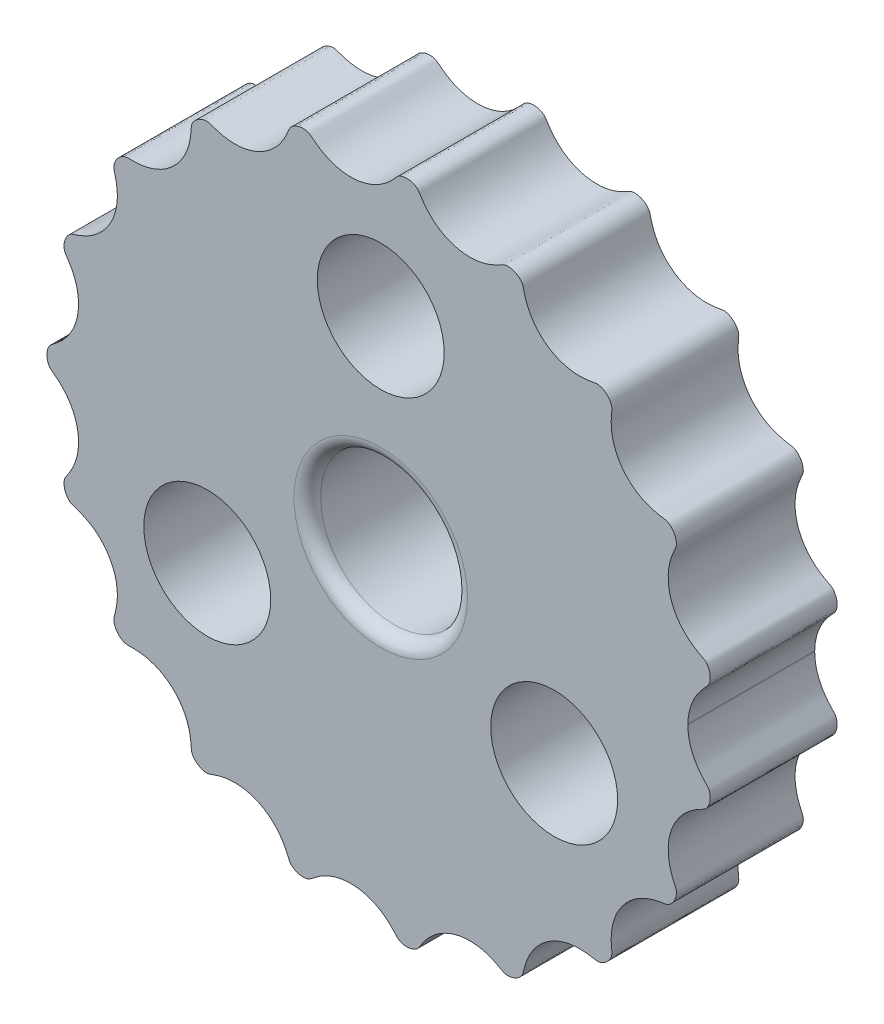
ISO-10303-21;
HEADER;
FILE_DESCRIPTION(('STEP AP214'),'2;1');
FILE_NAME('part.step','',(''),(''),'','','');
FILE_SCHEMA(('AUTOMOTIVE_DESIGN { 1 0 10303 214 1 1 1 1 }'));
ENDSEC;
DATA;
#1=APPLICATION_CONTEXT('core data for automotive mechanical design processes');
#2=APPLICATION_PROTOCOL_DEFINITION('international standard','automotive_design',2000,#1);
#3=PRODUCT_CONTEXT('',#1,'mechanical');
#4=PRODUCT('Part','Part','',(#3));
#5=PRODUCT_RELATED_PRODUCT_CATEGORY('part','',(#4));
#6=PRODUCT_DEFINITION_FORMATION('','',#4);
#7=PRODUCT_DEFINITION_CONTEXT('part definition',#1,'design');
#8=PRODUCT_DEFINITION('design','',#6,#7);
#9=PRODUCT_DEFINITION_SHAPE('','',#8);
#10=(LENGTH_UNIT() NAMED_UNIT(*) SI_UNIT(.MILLI.,.METRE.));
#11=(NAMED_UNIT(*) PLANE_ANGLE_UNIT() SI_UNIT($,.RADIAN.));
#12=(NAMED_UNIT(*) SI_UNIT($,.STERADIAN.) SOLID_ANGLE_UNIT());
#13=UNCERTAINTY_MEASURE_WITH_UNIT(LENGTH_MEASURE(1.E-05),#10,'distance_accuracy_value','');
#14=(GEOMETRIC_REPRESENTATION_CONTEXT(3) GLOBAL_UNCERTAINTY_ASSIGNED_CONTEXT((#13)) GLOBAL_UNIT_ASSIGNED_CONTEXT((#10,
#11,#12)) REPRESENTATION_CONTEXT('',''));
#15=CARTESIAN_POINT('',(0.,0.,0.));
#16=DIRECTION('',(0.,0.,1.));
#17=DIRECTION('',(1.,0.,0.));
#18=AXIS2_PLACEMENT_3D('',#15,#16,#17);
#19=CARTESIAN_POINT('',(0.,0.,0.));
#20=DIRECTION('',(0.,0.,1.));
#21=DIRECTION('',(1.,0.,0.));
#22=AXIS2_PLACEMENT_3D('',#19,#20,#21);
#23=PLANE('',#22);
#24=CARTESIAN_POINT('',(0.,15.,0.));
#25=DIRECTION('',(0.,0.,-1.));
#26=DIRECTION('',(-1.,0.,0.));
#27=AXIS2_PLACEMENT_3D('',#24,#25,#26);
#28=CIRCLE('',#27,4.75);
#29=CARTESIAN_POINT('',(-4.75,15.,0.));
#30=VERTEX_POINT('',#29);
#31=EDGE_CURVE('E127',#30,#30,#28,.T.);
#32=ORIENTED_EDGE('',*,*,#31,.F.);
#33=EDGE_LOOP('',(#32));
#34=FACE_BOUND('',#33,.T.);
#35=CARTESIAN_POINT('',(-12.9903810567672,-7.49999999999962,0.));
#36=DIRECTION('',(0.,0.,-1.));
#37=DIRECTION('',(-1.,0.,0.));
#38=AXIS2_PLACEMENT_3D('',#35,#36,#37);
#39=CIRCLE('',#38,4.75);
#40=CARTESIAN_POINT('',(-17.7403810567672,-7.49999999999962,0.));
#41=VERTEX_POINT('',#40);
#42=EDGE_CURVE('E301',#41,#41,#39,.T.);
#43=ORIENTED_EDGE('',*,*,#42,.F.);
#44=EDGE_LOOP('',(#43));
#45=FACE_BOUND('',#44,.T.);
#46=CARTESIAN_POINT('',(12.9903810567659,-7.50000000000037,0.));
#47=DIRECTION('',(0.,0.,-1.));
#48=DIRECTION('',(-1.,0.,0.));
#49=AXIS2_PLACEMENT_3D('',#46,#47,#48);
#50=CIRCLE('',#49,4.75);
#51=CARTESIAN_POINT('',(8.24038105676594,-7.50000000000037,0.));
#52=VERTEX_POINT('',#51);
#53=EDGE_CURVE('E143',#52,#52,#50,.T.);
#54=ORIENTED_EDGE('',*,*,#53,.F.);
#55=EDGE_LOOP('',(#54));
#56=FACE_BOUND('',#55,.T.);
#57=CARTESIAN_POINT('',(0.,0.,0.));
#58=DIRECTION('',(0.,0.,-1.));
#59=DIRECTION('',(-1.,0.,0.));
#60=AXIS2_PLACEMENT_3D('',#57,#58,#59);
#61=CIRCLE('',#60,9.);
#62=CARTESIAN_POINT('',(-9.,0.,0.));
#63=VERTEX_POINT('',#62);
#64=EDGE_CURVE('E111',#63,#63,#61,.T.);
#65=ORIENTED_EDGE('',*,*,#64,.F.);
#66=EDGE_LOOP('',(#65));
#67=FACE_BOUND('',#66,.T.);
#68=CARTESIAN_POINT('',(23.0004450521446,0.0609374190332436,0.));
#69=CARTESIAN_POINT('',(23.0010644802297,0.103341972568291,0.));
#70=CARTESIAN_POINT('',(23.0038092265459,0.188906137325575,0.));
#71=CARTESIAN_POINT('',(23.0131501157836,0.367843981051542,0.));
#72=CARTESIAN_POINT('',(23.0334981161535,0.534909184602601,0.));
#73=CARTESIAN_POINT('',(23.0705654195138,0.786083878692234,0.));
#74=CARTESIAN_POINT('',(23.1320141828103,1.06083292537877,0.));
#75=CARTESIAN_POINT('',(23.2545603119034,1.4742128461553,0.));
#76=CARTESIAN_POINT('',(23.4419605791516,1.90190498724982,0.));
#77=CARTESIAN_POINT('',(23.6526500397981,2.26726702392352,0.));
#78=CARTESIAN_POINT('',(23.8668861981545,2.5657364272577,0.));
#79=CARTESIAN_POINT('',(24.0252943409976,2.76594758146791,0.));
#80=CARTESIAN_POINT('',(24.1558379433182,2.91651817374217,0.));
#81=CARTESIAN_POINT('',(24.2851186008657,3.05651856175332,0.));
#82=CARTESIAN_POINT('',(24.4048398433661,3.18265204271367,0.));
#83=CARTESIAN_POINT('',(24.4955538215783,3.27862792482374,0.));
#84=CARTESIAN_POINT('',(24.5776413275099,3.3978753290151,0.));
#85=CARTESIAN_POINT('',(24.6403019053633,3.55800179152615,0.));
#86=CARTESIAN_POINT('',(24.6804298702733,3.75861614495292,0.));
#87=CARTESIAN_POINT('',(24.6829995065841,3.99723654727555,0.));
#88=CARTESIAN_POINT('',(24.6407164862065,4.24466441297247,0.));
#89=CARTESIAN_POINT('',(24.5598566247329,4.46599330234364,0.));
#90=CARTESIAN_POINT('',(24.4632988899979,4.62969794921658,0.));
#91=CARTESIAN_POINT('',(24.3700046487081,4.74154404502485,0.));
#92=CARTESIAN_POINT('',(24.2934573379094,4.80789336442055,0.));
#93=CARTESIAN_POINT('',(24.2331727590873,4.84919927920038,0.));
#94=CARTESIAN_POINT('',(24.1436718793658,4.90049686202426,0.));
#95=CARTESIAN_POINT('',(24.0251482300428,4.96086436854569,0.));
#96=CARTESIAN_POINT('',(23.8813705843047,5.03731738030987,0.));
#97=CARTESIAN_POINT('',(23.712869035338,5.13135954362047,0.));
#98=CARTESIAN_POINT('',(23.5008423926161,5.25969202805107,0.));
#99=CARTESIAN_POINT('',(23.2503084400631,5.42998618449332,0.));
#100=CARTESIAN_POINT('',(22.9679235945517,5.6540978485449,0.));
#101=CARTESIAN_POINT('',(22.6665695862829,5.94375033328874,0.));
#102=CARTESIAN_POINT('',(22.3909280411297,6.26615978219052,0.));
#103=CARTESIAN_POINT('',(22.1456648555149,6.6198575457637,0.));
#104=CARTESIAN_POINT('',(21.8865384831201,7.09053710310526,0.));
#105=CARTESIAN_POINT('',(21.6972444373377,7.58461786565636,0.));
#106=CARTESIAN_POINT('',(21.5786507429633,8.08655156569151,0.));
#107=CARTESIAN_POINT('',(21.5272191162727,8.58267339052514,0.));
#108=CARTESIAN_POINT('',(21.5223920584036,8.96260511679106,0.));
#109=CARTESIAN_POINT('',(21.5508966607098,9.33550554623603,0.));
#110=CARTESIAN_POINT('',(21.6103337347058,9.69862880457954,0.));
#111=CARTESIAN_POINT('',(21.6878411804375,10.0086036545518,0.));
#112=CARTESIAN_POINT('',(21.7706113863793,10.2666438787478,0.));
#113=CARTESIAN_POINT('',(21.8498829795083,10.4781783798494,0.));
#114=CARTESIAN_POINT('',(21.919038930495,10.6454192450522,0.));
#115=CARTESIAN_POINT('',(21.9816260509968,10.7867118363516,0.));
#116=CARTESIAN_POINT('',(22.035042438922,10.9030063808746,0.));
#117=CARTESIAN_POINT('',(22.084453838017,11.0131731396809,0.));
#118=CARTESIAN_POINT('',(22.1290439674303,11.1266774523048,0.));
#119=CARTESIAN_POINT('',(22.1489992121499,11.2598240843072,0.));
#120=CARTESIAN_POINT('',(22.1435566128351,11.4053666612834,0.));
#121=CARTESIAN_POINT('',(22.1170450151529,11.5725890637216,0.));
#122=CARTESIAN_POINT('',(22.0633944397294,11.7504492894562,0.));
#123=CARTESIAN_POINT('',(21.9702363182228,11.946885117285,0.));
#124=CARTESIAN_POINT('',(21.8436701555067,12.1238066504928,0.));
#125=CARTESIAN_POINT('',(21.7133767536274,12.2560985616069,0.));
#126=CARTESIAN_POINT('',(21.5962964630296,12.3450186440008,0.));
#127=CARTESIAN_POINT('',(21.5025310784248,12.4008340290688,0.));
#128=CARTESIAN_POINT('',(21.3990220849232,12.4432188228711,0.));
#129=CARTESIAN_POINT('',(21.2868217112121,12.4679022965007,0.));
#130=CARTESIAN_POINT('',(21.130878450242,12.4903115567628,0.));
#131=CARTESIAN_POINT('',(20.953603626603,12.5182372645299,0.));
#132=CARTESIAN_POINT('',(20.7643712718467,12.5521053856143,0.));
#133=CARTESIAN_POINT('',(20.5194912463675,12.605928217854,0.));
#134=CARTESIAN_POINT('',(20.1600221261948,12.7034344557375,0.));
#135=CARTESIAN_POINT('',(19.6713346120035,12.8869653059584,0.));
#136=CARTESIAN_POINT('',(19.0810609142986,13.213737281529,0.));
#137=CARTESIAN_POINT('',(18.4823551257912,13.7066338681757,0.));
#138=CARTESIAN_POINT('',(17.9827894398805,14.3046626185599,0.));
#139=CARTESIAN_POINT('',(17.6070636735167,14.9758213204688,0.));
#140=CARTESIAN_POINT('',(17.3914134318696,15.6061212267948,0.));
#141=CARTESIAN_POINT('',(17.2886005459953,16.1631502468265,0.));
#142=CARTESIAN_POINT('',(17.2593961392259,16.5774164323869,0.));
#143=CARTESIAN_POINT('',(17.2581121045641,16.8499339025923,0.));
#144=CARTESIAN_POINT('',(17.2672347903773,17.070006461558,0.));
#145=CARTESIAN_POINT('',(17.2791263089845,17.2377183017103,0.));
#146=CARTESIAN_POINT('',(17.2934381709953,17.3967835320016,0.));
#147=CARTESIAN_POINT('',(17.3092886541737,17.5470541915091,0.));
#148=CARTESIAN_POINT('',(17.3188500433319,17.7044671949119,0.));
#149=CARTESIAN_POINT('',(17.2904355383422,17.8485405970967,0.));
#150=CARTESIAN_POINT('',(17.2386992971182,17.9815332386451,0.));
#151=CARTESIAN_POINT('',(17.1576230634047,18.1323633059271,0.));
#152=CARTESIAN_POINT('',(17.0476886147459,18.2836398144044,0.));
#153=CARTESIAN_POINT('',(16.8932226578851,18.4399573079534,0.));
#154=CARTESIAN_POINT('',(16.712767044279,18.5662875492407,0.));
#155=CARTESIAN_POINT('',(16.5434032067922,18.6483748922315,0.));
#156=CARTESIAN_POINT('',(16.3919147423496,18.695708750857,0.));
#157=CARTESIAN_POINT('',(16.2633999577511,18.7185500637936,0.));
#158=CARTESIAN_POINT('',(16.1187982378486,18.7114090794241,0.));
#159=CARTESIAN_POINT('',(15.9628511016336,18.6804311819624,0.));
#160=CARTESIAN_POINT('',(15.7955730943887,18.6509993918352,0.));
#161=CARTESIAN_POINT('',(15.6162821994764,18.6220231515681,0.));
#162=CARTESIAN_POINT('',(15.431926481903,18.5982744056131,0.));
#163=CARTESIAN_POINT('',(15.2424369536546,18.5806300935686,0.));
#164=CARTESIAN_POINT('',(14.9983346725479,18.5678165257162,0.));
#165=CARTESIAN_POINT('',(14.6978223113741,18.5692961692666,0.));
#166=CARTESIAN_POINT('',(14.3465623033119,18.5976695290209,0.));
#167=CARTESIAN_POINT('',(13.8413545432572,18.6865447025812,0.));
#168=CARTESIAN_POINT('',(13.3474045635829,18.8414163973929,0.));
#169=CARTESIAN_POINT('',(12.8766615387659,19.0607681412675,0.));
#170=CARTESIAN_POINT('',(12.4404070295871,19.3396979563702,0.));
#171=CARTESIAN_POINT('',(12.1194362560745,19.5923890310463,0.));
#172=CARTESIAN_POINT('',(11.82732244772,19.8724017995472,0.));
#173=CARTESIAN_POINT('',(11.5657738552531,20.1760918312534,0.));
#174=CARTESIAN_POINT('',(11.2824305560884,20.5759636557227,0.));
#175=CARTESIAN_POINT('',(11.074042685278,20.961211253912,0.));
#176=CARTESIAN_POINT('',(10.9260104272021,21.3181212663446,0.));
#177=CARTESIAN_POINT('',(10.8223643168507,21.6364879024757,0.));
#178=CARTESIAN_POINT('',(10.7696450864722,21.8218639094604,0.));
#179=CARTESIAN_POINT('',(10.7283691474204,21.9832781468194,0.));
#180=CARTESIAN_POINT('',(10.6965388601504,22.1195677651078,0.));
#181=CARTESIAN_POINT('',(10.6698067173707,22.2304212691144,0.));
#182=CARTESIAN_POINT('',(10.6459464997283,22.3149341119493,0.));
#183=CARTESIAN_POINT('',(10.6031755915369,22.4212366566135,0.));
#184=CARTESIAN_POINT('',(10.5340769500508,22.5263972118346,0.));
#185=CARTESIAN_POINT('',(10.4440730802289,22.6278247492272,0.));
#186=CARTESIAN_POINT('',(10.3090535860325,22.7454665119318,0.));
#187=CARTESIAN_POINT('',(10.1449197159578,22.8528142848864,0.));
#188=CARTESIAN_POINT('',(9.96573029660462,22.9333716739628,0.));
#189=CARTESIAN_POINT('',(9.77675296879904,22.9846340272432,0.));
#190=CARTESIAN_POINT('',(9.59966398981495,23.008128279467,0.));
#191=CARTESIAN_POINT('',(9.4518387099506,23.0082709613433,0.));
#192=CARTESIAN_POINT('',(9.30082605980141,22.9868990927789,0.));
#193=CARTESIAN_POINT('',(9.14843663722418,22.9195820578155,0.));
#194=CARTESIAN_POINT('',(9.00629573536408,22.8364891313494,0.));
#195=CARTESIAN_POINT('',(8.85136035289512,22.7515834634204,0.));
#196=CARTESIAN_POINT('',(8.68415685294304,22.6633743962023,0.));
#197=CARTESIAN_POINT('',(8.4659469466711,22.557985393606,0.));
#198=CARTESIAN_POINT('',(8.1934656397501,22.442983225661,0.));
#199=CARTESIAN_POINT('',(7.8577537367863,22.3290184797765,0.));
#200=CARTESIAN_POINT('',(7.45596770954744,22.2330420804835,0.));
#201=CARTESIAN_POINT('',(7.03996906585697,22.1755239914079,0.));
#202=CARTESIAN_POINT('',(6.61357111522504,22.1597399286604,0.));
#203=CARTESIAN_POINT('',(6.1032438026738,22.1928478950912,0.));
#204=CARTESIAN_POINT('',(5.60993913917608,22.2896928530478,0.));
#205=CARTESIAN_POINT('',(5.14338857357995,22.4442843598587,0.));
#206=CARTESIAN_POINT('',(4.71453132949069,22.6471757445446,0.));
#207=CARTESIAN_POINT('',(4.39111897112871,22.8375133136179,0.));
#208=CARTESIAN_POINT('',(4.08670751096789,23.0547537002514,0.));
#209=CARTESIAN_POINT('',(3.80304315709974,23.2967196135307,0.));
#210=CARTESIAN_POINT('',(3.54117376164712,23.5622918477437,0.));
#211=CARTESIAN_POINT('',(3.33135134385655,23.8136303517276,0.));
#212=CARTESIAN_POINT('',(3.16729935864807,24.0378234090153,0.));
#213=CARTESIAN_POINT('',(3.05128465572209,24.2110609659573,0.));
#214=CARTESIAN_POINT('',(2.97407854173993,24.3312155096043,0.));
#215=CARTESIAN_POINT('',(2.90893122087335,24.4353210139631,0.));
#216=CARTESIAN_POINT('',(2.8530196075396,24.5220232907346,0.));
#217=CARTESIAN_POINT('',(2.77763239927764,24.6216491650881,0.));
#218=CARTESIAN_POINT('',(2.67867992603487,24.7064419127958,0.));
#219=CARTESIAN_POINT('',(2.56349711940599,24.7759495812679,0.));
#220=CARTESIAN_POINT('',(2.4075865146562,24.8456503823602,0.));
#221=CARTESIAN_POINT('',(2.2283539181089,24.8981764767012,0.));
#222=CARTESIAN_POINT('',(2.01091815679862,24.9274566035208,0.));
#223=CARTESIAN_POINT('',(1.79118975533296,24.9173237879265,0.));
#224=CARTESIAN_POINT('',(1.6073060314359,24.8790281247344,0.));
#225=CARTESIAN_POINT('',(1.4665345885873,24.8274053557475,0.));
#226=CARTESIAN_POINT('',(1.36596425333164,24.7764513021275,0.));
#227=CARTESIAN_POINT('',(1.28490950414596,24.7171219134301,0.));
#228=CARTESIAN_POINT('',(1.22151119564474,24.6555969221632,0.));
#229=CARTESIAN_POINT('',(1.15343854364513,24.5815042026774,0.));
#230=CARTESIAN_POINT('',(1.07877477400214,24.4970564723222,0.));
#231=CARTESIAN_POINT('',(0.990419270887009,24.3996139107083,0.));
#232=CARTESIAN_POINT('',(0.879528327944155,24.2812996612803,0.));
#233=CARTESIAN_POINT('',(0.757233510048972,24.1576265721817,0.));
#234=CARTESIAN_POINT('',(0.586090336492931,23.9963966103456,0.));
#235=CARTESIAN_POINT('',(0.279913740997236,23.7377910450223,0.));
#236=CARTESIAN_POINT('',(-0.185417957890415,23.4210136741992,0.));
#237=CARTESIAN_POINT('',(-0.841139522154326,23.1135331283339,0.));
#238=CARTESIAN_POINT('',(-1.63279965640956,22.9187714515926,0.));
#239=CARTESIAN_POINT('',(-2.42970180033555,22.8811842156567,0.));
#240=CARTESIAN_POINT('',(-3.18969687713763,22.98750840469,0.));
#241=CARTESIAN_POINT('',(-3.80648197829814,23.1882776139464,0.));
#242=CARTESIAN_POINT('',(-4.25792544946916,23.40952083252,0.));
#243=CARTESIAN_POINT('',(-4.56567071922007,23.5972605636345,0.));
#244=CARTESIAN_POINT('',(-4.7458498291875,23.7196194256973,0.));
#245=CARTESIAN_POINT('',(-4.87956659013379,23.8169925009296,0.));
#246=CARTESIAN_POINT('',(-5.00520766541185,23.9132889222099,0.));
#247=CARTESIAN_POINT('',(-5.10839703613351,23.9954562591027,0.));
#248=CARTESIAN_POINT('',(-5.1962832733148,24.0667457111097,0.));
#249=CARTESIAN_POINT('',(-5.27555451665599,24.1275195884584,0.));
#250=CARTESIAN_POINT('',(-5.34752737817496,24.1751925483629,0.));
#251=CARTESIAN_POINT('',(-5.45544706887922,24.226628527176,0.));
#252=CARTESIAN_POINT('',(-5.61332665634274,24.2679019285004,0.));
#253=CARTESIAN_POINT('',(-5.81248805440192,24.2858139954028,0.));
#254=CARTESIAN_POINT('',(-6.04892210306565,24.2634708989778,0.));
#255=CARTESIAN_POINT('',(-6.28478849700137,24.1982333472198,0.));
#256=CARTESIAN_POINT('',(-6.4910822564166,24.0996183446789,0.));
#257=CARTESIAN_POINT('',(-6.6528295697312,23.9826572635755,0.));
#258=CARTESIAN_POINT('',(-6.7731717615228,23.8583116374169,0.));
#259=CARTESIAN_POINT('',(-6.83961553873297,23.7424509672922,0.));
#260=CARTESIAN_POINT('',(-6.88287024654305,23.6417345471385,0.));
#261=CARTESIAN_POINT('',(-6.92897548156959,23.5322327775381,0.));
#262=CARTESIAN_POINT('',(-6.97918741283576,23.4142809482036,0.));
#263=CARTESIAN_POINT('',(-7.04005614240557,23.2775073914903,0.));
#264=CARTESIAN_POINT('',(-7.11617893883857,23.1178274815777,0.));
#265=CARTESIAN_POINT('',(-7.20056760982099,22.9555859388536,0.));
#266=CARTESIAN_POINT('',(-7.3180100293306,22.7492499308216,0.));
#267=CARTESIAN_POINT('',(-7.47816968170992,22.5012513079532,0.));
#268=CARTESIAN_POINT('',(-7.68753153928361,22.2243018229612,0.));
#269=CARTESIAN_POINT('',(-7.95814510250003,21.9275718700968,0.));
#270=CARTESIAN_POINT('',(-8.2599123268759,21.6541948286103,0.));
#271=CARTESIAN_POINT('',(-8.66083173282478,21.3562771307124,0.));
#272=CARTESIAN_POINT('',(-9.18181951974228,21.0633248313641,0.));
#273=CARTESIAN_POINT('',(-9.73536554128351,20.8583848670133,0.));
#274=CARTESIAN_POINT('',(-10.3037773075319,20.7431634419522,0.));
#275=CARTESIAN_POINT('',(-10.7833094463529,20.705631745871,0.));
#276=CARTESIAN_POINT('',(-11.1616253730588,20.7096634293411,0.));
#277=CARTESIAN_POINT('',(-11.5388634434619,20.7468047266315,0.));
#278=CARTESIAN_POINT('',(-11.8655396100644,20.8075028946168,0.));
#279=CARTESIAN_POINT('',(-12.1413237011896,20.878074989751,0.));
#280=CARTESIAN_POINT('',(-12.3518739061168,20.943093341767,0.));
#281=CARTESIAN_POINT('',(-12.5000613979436,20.9929725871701,0.));
#282=CARTESIAN_POINT('',(-12.6314970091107,21.0397639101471,0.));
#283=CARTESIAN_POINT('',(-12.7469137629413,21.0816629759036,0.));
#284=CARTESIAN_POINT('',(-12.8816892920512,21.1275848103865,0.));
#285=CARTESIAN_POINT('',(-13.0232174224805,21.1443617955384,0.));
#286=CARTESIAN_POINT('',(-13.1646854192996,21.131095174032,0.));
#287=CARTESIAN_POINT('',(-13.3350151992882,21.0938854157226,0.));
#288=CARTESIAN_POINT('',(-13.5127331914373,21.0275671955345,0.));
#289=CARTESIAN_POINT('',(-13.70771107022,20.918241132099,0.));
#290=CARTESIAN_POINT('',(-13.8803938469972,20.7741716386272,0.));
#291=CARTESIAN_POINT('',(-14.0059492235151,20.6294351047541,0.));
#292=CARTESIAN_POINT('',(-14.0873372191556,20.5014982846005,0.));
#293=CARTESIAN_POINT('',(-14.1362001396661,20.400514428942,0.));
#294=CARTESIAN_POINT('',(-14.1696652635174,20.2905284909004,0.));
#295=CARTESIAN_POINT('',(-14.1839673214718,20.173300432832,0.));
#296=CARTESIAN_POINT('',(-14.1936306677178,20.0116167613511,0.));
#297=CARTESIAN_POINT('',(-14.207496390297,19.8274109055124,0.));
#298=CARTESIAN_POINT('',(-14.2268591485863,19.6305753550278,0.));
#299=CARTESIAN_POINT('',(-14.26271195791,19.375130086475,0.));
#300=CARTESIAN_POINT('',(-14.3350990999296,18.9985849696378,0.));
#301=CARTESIAN_POINT('',(-14.4878193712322,18.4826931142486,0.));
#302=CARTESIAN_POINT('',(-14.7830279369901,17.8542035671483,0.));
#303=CARTESIAN_POINT('',(-15.2484658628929,17.213007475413,0.));
#304=CARTESIAN_POINT('',(-15.823885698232,16.6734473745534,0.));
#305=CARTESIAN_POINT('',(-16.3973526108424,16.3085128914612,0.));
#306=CARTESIAN_POINT('',(-16.9177749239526,16.0786260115,0.));
#307=CARTESIAN_POINT('',(-17.3647339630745,15.9410111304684,0.));
#308=CARTESIAN_POINT('',(-17.7248018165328,15.8628091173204,0.));
#309=CARTESIAN_POINT('',(-18.0412846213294,15.820863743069,0.));
#310=CARTESIAN_POINT('',(-18.3106294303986,15.802325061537,0.));
#311=CARTESIAN_POINT('',(-18.5320417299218,15.7969443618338,0.));
#312=CARTESIAN_POINT('',(-18.6836276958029,15.7969225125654,0.));
#313=CARTESIAN_POINT('',(-18.8132574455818,15.7990809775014,0.));
#314=CARTESIAN_POINT('',(-18.9269805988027,15.8005385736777,0.));
#315=CARTESIAN_POINT('',(-19.0245949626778,15.7984869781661,0.));
#316=CARTESIAN_POINT('',(-19.1503625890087,15.7793808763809,0.));
#317=CARTESIAN_POINT('',(-19.2786587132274,15.7292741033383,0.));
#318=CARTESIAN_POINT('',(-19.4017458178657,15.6607359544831,0.));
#319=CARTESIAN_POINT('',(-19.5437475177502,15.5557400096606,0.));
#320=CARTESIAN_POINT('',(-19.6794119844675,15.4254489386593,0.));
#321=CARTESIAN_POINT('',(-19.8125272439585,15.252166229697,0.));
#322=CARTESIAN_POINT('',(-19.9195409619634,15.0445062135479,0.));
#323=CARTESIAN_POINT('',(-19.9741862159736,14.8643202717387,0.));
#324=CARTESIAN_POINT('',(-19.993465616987,14.721716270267,0.));
#325=CARTESIAN_POINT('',(-19.9911465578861,14.6219173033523,0.));
#326=CARTESIAN_POINT('',(-19.9814906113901,14.5508659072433,0.));
#327=CARTESIAN_POINT('',(-19.9596359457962,14.4520422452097,0.));
#328=CARTESIAN_POINT('',(-19.9244302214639,14.3263366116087,0.));
#329=CARTESIAN_POINT('',(-19.8839286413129,14.1718166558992,0.));
#330=CARTESIAN_POINT('',(-19.83941825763,13.9878017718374,0.));
#331=CARTESIAN_POINT('',(-19.7902400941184,13.7494276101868,0.));
#332=CARTESIAN_POINT('',(-19.7451420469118,13.4551748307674,0.));
#333=CARTESIAN_POINT('',(-19.7169078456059,13.1023532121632,0.));
#334=CARTESIAN_POINT('',(-19.722218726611,12.6922723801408,0.));
#335=CARTESIAN_POINT('',(-19.7673351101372,12.2788625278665,0.));
#336=CARTESIAN_POINT('',(-19.85423085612,11.8662508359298,0.));
#337=CARTESIAN_POINT('',(-20.0143814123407,11.3636435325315,0.));
#338=CARTESIAN_POINT('',(-20.2770751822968,10.8105198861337,0.));
#339=CARTESIAN_POINT('',(-20.6164390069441,10.3191130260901,0.));
#340=CARTESIAN_POINT('',(-21.0150684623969,9.899172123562,0.));
#341=CARTESIAN_POINT('',(-21.3660194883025,9.60628322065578,0.));
#342=CARTESIAN_POINT('',(-21.6595973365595,9.40050749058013,0.));
#343=CARTESIAN_POINT('',(-21.9661729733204,9.22095812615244,0.));
#344=CARTESIAN_POINT('',(-22.2434766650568,9.08647526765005,0.));
#345=CARTESIAN_POINT('',(-22.487141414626,8.985853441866,0.));
#346=CARTESIAN_POINT('',(-22.6971275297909,8.90966358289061,0.));
#347=CARTESIAN_POINT('',(-22.8484016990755,8.85832288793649,0.));
#348=CARTESIAN_POINT('',(-22.9816290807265,8.81586827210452,0.));
#349=CARTESIAN_POINT('',(-23.0968211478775,8.7757949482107,0.));
#350=CARTESIAN_POINT('',(-23.1870132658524,8.73389595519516,0.));
#351=CARTESIAN_POINT('',(-23.2911900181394,8.66248407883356,0.));
#352=CARTESIAN_POINT('',(-23.4082170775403,8.54904085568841,0.));
#353=CARTESIAN_POINT('',(-23.5263335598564,8.39080511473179,0.));
#354=CARTESIAN_POINT('',(-23.6303183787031,8.18310432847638,0.));
#355=CARTESIAN_POINT('',(-23.6995028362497,7.95346432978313,0.));
#356=CARTESIAN_POINT('',(-23.726069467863,7.73085575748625,0.));
#357=CARTESIAN_POINT('',(-23.7141681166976,7.53088332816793,0.));
#358=CARTESIAN_POINT('',(-23.6712468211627,7.35676687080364,0.));
#359=CARTESIAN_POINT('',(-23.587535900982,7.2107568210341,0.));
#360=CARTESIAN_POINT('',(-23.4888308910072,7.07016675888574,0.));
#361=CARTESIAN_POINT('',(-23.3882676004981,6.91694785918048,0.));
#362=CARTESIAN_POINT('',(-23.2843627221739,6.75241089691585,0.));
#363=CARTESIAN_POINT('',(-23.1587096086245,6.53560145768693,0.));
#364=CARTESIAN_POINT('',(-23.0192784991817,6.26245241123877,0.));
#365=CARTESIAN_POINT('',(-22.877747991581,5.92438993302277,0.));
#366=CARTESIAN_POINT('',(-22.7518654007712,5.51735194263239,0.));
#367=CARTESIAN_POINT('',(-22.6663634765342,5.09510154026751,0.));
#368=CARTESIAN_POINT('',(-22.624177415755,4.66168506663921,0.));
#369=CARTESIAN_POINT('',(-22.6277437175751,4.14416476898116,0.));
#370=CARTESIAN_POINT('',(-22.6969215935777,3.64321925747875,0.));
#371=CARTESIAN_POINT('',(-22.8250601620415,3.16849461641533,0.));
#372=CARTESIAN_POINT('',(-23.0025794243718,2.73028397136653,0.));
#373=CARTESIAN_POINT('',(-23.1734074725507,2.39759943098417,0.));
#374=CARTESIAN_POINT('',(-23.3714935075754,2.08291514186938,0.));
#375=CARTESIAN_POINT('',(-23.5945603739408,1.7879594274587,0.));
#376=CARTESIAN_POINT('',(-23.8110817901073,1.54694379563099,0.));
#377=CARTESIAN_POINT('',(-24.0104853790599,1.35312204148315,0.));
#378=CARTESIAN_POINT('',(-24.1832927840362,1.20112568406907,0.));
#379=CARTESIAN_POINT('',(-24.3242369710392,1.08551778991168,0.));
#380=CARTESIAN_POINT('',(-24.4487192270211,0.988664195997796,0.));
#381=CARTESIAN_POINT('',(-24.5548708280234,0.908952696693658,0.));
#382=CARTESIAN_POINT('',(-24.6411994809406,0.843342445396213,0.));
#383=CARTESIAN_POINT('',(-24.7061246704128,0.790339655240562,0.));
#384=CARTESIAN_POINT('',(-24.7831824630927,0.713841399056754,0.));
#385=CARTESIAN_POINT('',(-24.8504413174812,0.61561561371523,0.));
#386=CARTESIAN_POINT('',(-24.9066420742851,0.50012631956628,0.));
#387=CARTESIAN_POINT('',(-24.9616031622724,0.3399066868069,0.));
#388=CARTESIAN_POINT('',(-24.9980291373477,0.156872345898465,0.));
#389=CARTESIAN_POINT('',(-25.0079752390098,-0.0615272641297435,0.));
#390=CARTESIAN_POINT('',(-24.9788835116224,-0.278375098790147,0.));
#391=CARTESIAN_POINT('',(-24.9250325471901,-0.457300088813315,0.));
#392=CARTESIAN_POINT('',(-24.8613331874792,-0.593231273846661,0.));
#393=CARTESIAN_POINT('',(-24.8008989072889,-0.690159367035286,0.));
#394=CARTESIAN_POINT('',(-24.7323333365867,-0.767244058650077,0.));
#395=CARTESIAN_POINT('',(-24.6619915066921,-0.827034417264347,0.));
#396=CARTESIAN_POINT('',(-24.5779706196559,-0.891541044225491,0.));
#397=CARTESIAN_POINT('',(-24.482308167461,-0.963016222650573,0.));
#398=CARTESIAN_POINT('',(-24.3719847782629,-1.04823760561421,0.));
#399=CARTESIAN_POINT('',(-24.2390268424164,-1.15462412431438,0.));
#400=CARTESIAN_POINT('',(-24.1011027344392,-1.27221831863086,0.));
#401=CARTESIAN_POINT('',(-23.9221175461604,-1.43660713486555,0.));
#402=CARTESIAN_POINT('',(-23.6362767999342,-1.73077995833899,0.));
#403=CARTESIAN_POINT('',(-23.281762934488,-2.1835918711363,0.));
#404=CARTESIAN_POINT('',(-22.9271870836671,-2.83084957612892,0.));
#405=CARTESIAN_POINT('',(-22.6825732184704,-3.62085086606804,0.));
#406=CARTESIAN_POINT('',(-22.599242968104,-4.42206812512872,0.));
#407=CARTESIAN_POINT('',(-22.6560153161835,-5.10075585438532,0.));
#408=CARTESIAN_POINT('',(-22.7839328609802,-5.64508269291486,0.));
#409=CARTESIAN_POINT('',(-22.9383125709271,-6.07567291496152,0.));
#410=CARTESIAN_POINT('',(-23.0687206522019,-6.36331346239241,0.));
#411=CARTESIAN_POINT('',(-23.1954045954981,-6.60097575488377,0.));
#412=CARTESIAN_POINT('',(-23.3169904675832,-6.80553099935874,0.));
#413=CARTESIAN_POINT('',(-23.4134801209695,-6.95589523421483,0.));
#414=CARTESIAN_POINT('',(-23.5046446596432,-7.09189883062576,0.));
#415=CARTESIAN_POINT('',(-23.5869866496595,-7.21312038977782,0.));
#416=CARTESIAN_POINT('',(-23.6458842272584,-7.31129955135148,0.));
#417=CARTESIAN_POINT('',(-23.6936359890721,-7.43717701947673,0.));
#418=CARTESIAN_POINT('',(-23.7216283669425,-7.60152763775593,0.));
#419=CARTESIAN_POINT('',(-23.7223084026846,-7.80201130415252,0.));
#420=CARTESIAN_POINT('',(-23.6806344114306,-8.03349246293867,0.));
#421=CARTESIAN_POINT('',(-23.59593129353,-8.26306779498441,0.));
#422=CARTESIAN_POINT('',(-23.4800063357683,-8.46101706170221,0.));
#423=CARTESIAN_POINT('',(-23.3487704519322,-8.61326074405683,0.));
#424=CARTESIAN_POINT('',(-23.2127158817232,-8.7238612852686,0.));
#425=CARTESIAN_POINT('',(-23.0663566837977,-8.78968521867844,0.));
#426=CARTESIAN_POINT('',(-22.9125310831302,-8.83693719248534,0.));
#427=CARTESIAN_POINT('',(-22.748877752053,-8.89193738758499,0.));
#428=CARTESIAN_POINT('',(-22.5744954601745,-8.95337392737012,0.));
#429=CARTESIAN_POINT('',(-22.3540791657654,-9.03952140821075,0.));
#430=CARTESIAN_POINT('',(-22.0907560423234,-9.15759161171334,0.));
#431=CARTESIAN_POINT('',(-21.7859013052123,-9.3207230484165,0.));
#432=CARTESIAN_POINT('',(-21.4493417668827,-9.54194913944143,0.));
#433=CARTESIAN_POINT('',(-21.1295614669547,-9.79839843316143,0.));
#434=CARTESIAN_POINT('',(-20.8313398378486,-10.0897970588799,0.));
#435=CARTESIAN_POINT('',(-20.5060815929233,-10.4778880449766,0.));
#436=CARTESIAN_POINT('',(-20.2354524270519,-10.9007400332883,0.));
#437=CARTESIAN_POINT('',(-20.0234952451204,-11.3478403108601,0.));
#438=CARTESIAN_POINT('',(-19.8724944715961,-11.8050881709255,0.));
#439=CARTESIAN_POINT('',(-19.786480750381,-12.1771034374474,0.));
#440=CARTESIAN_POINT('',(-19.7342884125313,-12.5535769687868,0.));
#441=CARTESIAN_POINT('',(-19.7154994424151,-12.9315657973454,0.));
#442=CARTESIAN_POINT('',(-19.7297872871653,-13.3095414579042,0.));
#443=CARTESIAN_POINT('',(-19.7703384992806,-13.6387799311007,0.));
#444=CARTESIAN_POINT('',(-19.822738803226,-13.9153600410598,0.));
#445=CARTESIAN_POINT('',(-19.8775380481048,-14.1470425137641,0.));
#446=CARTESIAN_POINT('',(-19.9208953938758,-14.3131728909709,0.));
#447=CARTESIAN_POINT('',(-19.9621623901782,-14.4593821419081,0.));
#448=CARTESIAN_POINT('',(-19.9940619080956,-14.6091198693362,0.));
#449=CARTESIAN_POINT('',(-19.9941902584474,-14.7408999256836,0.));
#450=CARTESIAN_POINT('',(-19.9694030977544,-14.8748164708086,0.));
#451=CARTESIAN_POINT('',(-19.9174563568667,-15.0391698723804,0.));
#452=CARTESIAN_POINT('',(-19.8355386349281,-15.2103657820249,0.));
#453=CARTESIAN_POINT('',(-19.7097922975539,-15.394155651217,0.));
#454=CARTESIAN_POINT('',(-19.5524111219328,-15.5524234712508,0.));
#455=CARTESIAN_POINT('',(-19.3980896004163,-15.66434186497,0.));
#456=CARTESIAN_POINT('',(-19.2638687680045,-15.7341888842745,0.));
#457=CARTESIAN_POINT('',(-19.1585412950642,-15.7741625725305,0.));
#458=CARTESIAN_POINT('',(-19.0429650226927,-15.7980324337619,0.));
#459=CARTESIAN_POINT('',(-18.9192143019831,-15.8013130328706,0.));
#460=CARTESIAN_POINT('',(-18.7472333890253,-15.7970987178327,0.));
#461=CARTESIAN_POINT('',(-18.5515487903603,-15.7964119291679,0.));
#462=CARTESIAN_POINT('',(-18.3443653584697,-15.8008032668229,0.));
#463=CARTESIAN_POINT('',(-18.0778543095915,-15.8186981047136,0.));
#464=CARTESIAN_POINT('',(-17.6884272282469,-15.865276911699,0.));
#465=CARTESIAN_POINT('',(-17.1511717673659,-15.9855809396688,0.));
#466=CARTESIAN_POINT('',(-16.491481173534,-16.2456853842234,0.));
#467=CARTESIAN_POINT('',(-15.8123440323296,-16.6796683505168,0.));
#468=CARTESIAN_POINT('',(-15.2347483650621,-17.2299118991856,0.));
#469=CARTESIAN_POINT('',(-14.7820895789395,-17.8614300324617,0.));
#470=CARTESIAN_POINT('',(-14.4987938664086,-18.4602384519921,0.));
#471=CARTESIAN_POINT('',(-14.3484234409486,-18.9506966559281,0.));
#472=CARTESIAN_POINT('',(-14.2744379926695,-19.3095687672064,0.));
#473=CARTESIAN_POINT('',(-14.2356753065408,-19.5599770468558,0.));
#474=CARTESIAN_POINT('',(-14.2135300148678,-19.7574429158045,0.));
#475=CARTESIAN_POINT('',(-14.1984406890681,-19.9464050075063,0.));
#476=CARTESIAN_POINT('',(-14.1869135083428,-20.1194013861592,0.));
#477=CARTESIAN_POINT('',(-14.1772264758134,-20.2506342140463,0.));
#478=CARTESIAN_POINT('',(-14.1432637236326,-20.3907384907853,0.));
#479=CARTESIAN_POINT('',(-14.0670190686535,-20.5439346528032,0.));
#480=CARTESIAN_POINT('',(-13.9463238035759,-20.7079390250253,0.));
#481=CARTESIAN_POINT('',(-13.7726838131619,-20.8699590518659,0.));
#482=CARTESIAN_POINT('',(-13.5626064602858,-21.0051884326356,0.));
#483=CARTESIAN_POINT('',(-13.3458445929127,-21.0946672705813,0.));
#484=CARTESIAN_POINT('',(-13.1606618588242,-21.1340559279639,0.));
#485=CARTESIAN_POINT('',(-13.0154934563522,-21.1409328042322,0.));
#486=CARTESIAN_POINT('',(-12.9147776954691,-21.1293423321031,0.));
#487=CARTESIAN_POINT('',(-12.8431971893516,-21.1126992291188,0.));
#488=CARTESIAN_POINT('',(-12.7443393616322,-21.0812522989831,0.));
#489=CARTESIAN_POINT('',(-12.618960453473,-21.0346928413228,0.));
#490=CARTESIAN_POINT('',(-12.4644514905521,-20.9804324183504,0.));
#491=CARTESIAN_POINT('',(-12.2800722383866,-20.9199483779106,0.));
#492=CARTESIAN_POINT('',(-12.0407156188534,-20.8507689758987,0.));
#493=CARTESIAN_POINT('',(-11.7441360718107,-20.7818718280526,0.));
#494=CARTESIAN_POINT('',(-11.3859714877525,-20.7263071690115,0.));
#495=CARTESIAN_POINT('',(-10.9663821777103,-20.7016950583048,0.));
#496=CARTESIAN_POINT('',(-10.5400901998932,-20.718700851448,0.));
#497=CARTESIAN_POINT('',(-10.0057507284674,-20.7948541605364,0.));
#498=CARTESIAN_POINT('',(-9.48522843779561,-20.9439687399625,0.));
#499=CARTESIAN_POINT('',(-8.9999733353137,-21.1593640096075,0.));
#500=CARTESIAN_POINT('',(-8.56103981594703,-21.4293105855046,0.));
#501=CARTESIAN_POINT('',(-8.24840665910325,-21.665143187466,0.));
#502=CARTESIAN_POINT('',(-7.96834487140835,-21.9190171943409,0.));
#503=CARTESIAN_POINT('',(-7.71592832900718,-22.1921854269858,0.));
#504=CARTESIAN_POINT('',(-7.49148796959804,-22.4810340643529,0.));
#505=CARTESIAN_POINT('',(-7.31777393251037,-22.7471219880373,0.));
#506=CARTESIAN_POINT('',(-7.18529345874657,-22.9819952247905,0.));
#507=CARTESIAN_POINT('',(-7.0842516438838,-23.1830190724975,0.));
#508=CARTESIAN_POINT('',(-7.00856178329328,-23.3468667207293,0.));
#509=CARTESIAN_POINT('',(-6.94736540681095,-23.4881641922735,0.));
#510=CARTESIAN_POINT('',(-6.89842040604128,-23.6057776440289,0.));
#511=CARTESIAN_POINT('',(-6.85077043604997,-23.7158356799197,0.));
#512=CARTESIAN_POINT('',(-6.79658298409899,-23.8241479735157,0.));
#513=CARTESIAN_POINT('',(-6.71118125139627,-23.9271512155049,0.));
#514=CARTESIAN_POINT('',(-6.6006094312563,-24.0204484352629,0.));
#515=CARTESIAN_POINT('',(-6.45971156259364,-24.1129130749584,0.));
#516=CARTESIAN_POINT('',(-6.29313141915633,-24.1927464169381,0.));
#517=CARTESIAN_POINT('',(-6.08637470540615,-24.2561989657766,0.));
#518=CARTESIAN_POINT('',(-5.87153847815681,-24.2822335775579,0.));
#519=CARTESIAN_POINT('',(-5.68693790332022,-24.2756373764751,0.));
#520=CARTESIAN_POINT('',(-5.5427537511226,-24.2496031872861,0.));
#521=CARTESIAN_POINT('',(-5.43826830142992,-24.2182745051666,0.));
#522=CARTESIAN_POINT('',(-5.33678403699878,-24.1704369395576,0.));
#523=CARTESIAN_POINT('',(-5.24222400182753,-24.1039090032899,0.));
#524=CARTESIAN_POINT('',(-5.1193477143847,-24.0036919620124,0.));
#525=CARTESIAN_POINT('',(-4.97774686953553,-23.8914820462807,0.));
#526=CARTESIAN_POINT('',(-4.8235593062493,-23.7745521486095,0.));
#527=CARTESIAN_POINT('',(-4.61656485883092,-23.6301676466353,0.));
#528=CARTESIAN_POINT('',(-4.29889720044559,-23.4309620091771,0.));
#529=CARTESIAN_POINT('',(-3.82902320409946,-23.1952819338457,0.));
#530=CARTESIAN_POINT('',(-3.18377275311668,-22.9832848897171,0.));
#531=CARTESIAN_POINT('',(-2.41193691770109,-22.8800329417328,0.));
#532=CARTESIAN_POINT('',(-1.63302094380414,-22.921923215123,0.));
#533=CARTESIAN_POINT('',(-0.887269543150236,-23.1037030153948,0.));
#534=CARTESIAN_POINT('',(-0.281567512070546,-23.3733905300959,0.));
#535=CARTESIAN_POINT('',(0.194350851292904,-23.6752129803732,0.));
#536=CARTESIAN_POINT('',(0.516618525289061,-23.9340260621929,0.));
#537=CARTESIAN_POINT('',(0.71665654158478,-24.1173384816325,0.));
#538=CARTESIAN_POINT('',(0.871449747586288,-24.272798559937,0.));
#539=CARTESIAN_POINT('',(0.986207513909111,-24.3949086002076,0.));
#540=CARTESIAN_POINT('',(1.0929201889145,-24.5126035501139,0.));
#541=CARTESIAN_POINT('',(1.19190515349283,-24.625420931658,0.));
#542=CARTESIAN_POINT('',(1.30175329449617,-24.7374351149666,0.));
#543=CARTESIAN_POINT('',(1.42719632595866,-24.8122529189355,0.));
#544=CARTESIAN_POINT('',(1.55973942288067,-24.8633726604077,0.));
#545=CARTESIAN_POINT('',(1.72543451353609,-24.9048794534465,0.));
#546=CARTESIAN_POINT('',(1.91039113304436,-24.9256576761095,0.));
#547=CARTESIAN_POINT('',(2.12896751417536,-24.9172121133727,0.));
#548=CARTESIAN_POINT('',(2.34307020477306,-24.8697627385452,0.));
#549=CARTESIAN_POINT('',(2.51716990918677,-24.8007028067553,0.));
#550=CARTESIAN_POINT('',(2.65427971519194,-24.7214006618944,0.));
#551=CARTESIAN_POINT('',(2.74416188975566,-24.6523005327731,0.));
#552=CARTESIAN_POINT('',(2.8107409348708,-24.5787971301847,0.));
#553=CARTESIAN_POINT('',(2.87712116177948,-24.4860368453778,0.));
#554=CARTESIAN_POINT('',(2.94337025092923,-24.3793613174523,0.));
#555=CARTESIAN_POINT('',(3.02603718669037,-24.2496052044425,0.));
#556=CARTESIAN_POINT('',(3.12701413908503,-24.0973984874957,0.));
#557=CARTESIAN_POINT('',(3.26398205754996,-23.904047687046,0.));
#558=CARTESIAN_POINT('',(3.4440513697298,-23.674800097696,0.));
#559=CARTESIAN_POINT('',(3.67772189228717,-23.4168202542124,0.));
#560=CARTESIAN_POINT('',(3.97550664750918,-23.1429338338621,0.));
#561=CARTESIAN_POINT('',(4.30226720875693,-22.8948310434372,0.));
#562=CARTESIAN_POINT('',(4.65651825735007,-22.6766608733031,0.));
#563=CARTESIAN_POINT('',(5.03202722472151,-22.4940848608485,0.));
#564=CARTESIAN_POINT('',(5.42531107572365,-22.3495600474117,0.));
#565=CARTESIAN_POINT('',(5.82601540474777,-22.2462818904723,0.));
#566=CARTESIAN_POINT('',(6.22978333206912,-22.1835933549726,0.));
#567=CARTESIAN_POINT('',(6.63282472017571,-22.1606595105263,0.));
#568=CARTESIAN_POINT('',(7.03133133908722,-22.1758984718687,0.));
#569=CARTESIAN_POINT('',(7.5145815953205,-22.2401734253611,0.));
#570=CARTESIAN_POINT('',(7.93642325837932,-22.3488061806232,0.));
#571=CARTESIAN_POINT('',(8.29689005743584,-22.4820755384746,0.));
#572=CARTESIAN_POINT('',(8.59939412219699,-22.6214240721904,0.));
#573=CARTESIAN_POINT('',(8.77040029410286,-22.7081631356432,0.));
#574=CARTESIAN_POINT('',(8.91633144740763,-22.7867434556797,0.));
#575=CARTESIAN_POINT('',(9.03741235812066,-22.855573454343,0.));
#576=CARTESIAN_POINT('',(9.13671249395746,-22.9105040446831,0.));
#577=CARTESIAN_POINT('',(9.21498400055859,-22.9493669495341,0.));
#578=CARTESIAN_POINT('',(9.32221861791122,-22.9883278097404,0.));
#579=CARTESIAN_POINT('',(9.44603735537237,-23.0073670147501,0.));
#580=CARTESIAN_POINT('',(9.58099088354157,-23.0090433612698,0.));
#581=CARTESIAN_POINT('',(9.75806508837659,-22.988506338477,0.));
#582=CARTESIAN_POINT('',(9.94704029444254,-22.9399571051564,0.));
#583=CARTESIAN_POINT('',(10.1264812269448,-22.8624917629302,0.));
#584=CARTESIAN_POINT('',(10.2911124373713,-22.7583270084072,0.));
#585=CARTESIAN_POINT('',(10.427360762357,-22.6442356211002,0.));
#586=CARTESIAN_POINT('',(10.5273388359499,-22.5356880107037,0.));
#587=CARTESIAN_POINT('',(10.6134828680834,-22.4097529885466,0.));
#588=CARTESIAN_POINT('',(10.6596414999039,-22.2740877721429,0.));
#589=CARTESIAN_POINT('',(10.6867141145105,-22.1589844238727,0.));
#590=CARTESIAN_POINT('',(10.7169917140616,-22.0322284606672,0.));
#591=CARTESIAN_POINT('',(10.7510613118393,-21.8937068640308,0.));
#592=CARTESIAN_POINT('',(10.7940703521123,-21.7328912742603,0.));
#593=CARTESIAN_POINT('',(10.864967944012,-21.499403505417,0.));
#594=CARTESIAN_POINT('',(10.966201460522,-21.2192268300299,0.));
#595=CARTESIAN_POINT('',(11.1115290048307,-20.8929846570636,0.));
#596=CARTESIAN_POINT('',(11.3157466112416,-20.5303408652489,0.));
#597=CARTESIAN_POINT('',(11.5582577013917,-20.1838253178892,0.));
#598=CARTESIAN_POINT('',(11.8388764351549,-19.8585541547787,0.));
#599=CARTESIAN_POINT('',(12.2149007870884,-19.5036466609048,0.));
#600=CARTESIAN_POINT('',(12.6278235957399,-19.2051943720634,0.));
#601=CARTESIAN_POINT('',(13.0666135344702,-18.9667198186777,0.));
#602=CARTESIAN_POINT('',(13.6042585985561,-18.7559343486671,0.));
#603=CARTESIAN_POINT('',(14.0692576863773,-18.6360894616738,0.));
#604=CARTESIAN_POINT('',(14.5428827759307,-18.5729420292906,0.));
#605=CARTESIAN_POINT('',(14.9675720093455,-18.5655428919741,0.));
#606=CARTESIAN_POINT('',(15.2504924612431,-18.5802384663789,0.));
#607=CARTESIAN_POINT('',(15.4825468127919,-18.604172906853,0.));
#608=CARTESIAN_POINT('',(15.6640125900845,-18.6292353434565,0.));
#609=CARTESIAN_POINT('',(15.8370194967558,-18.6581487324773,0.));
#610=CARTESIAN_POINT('',(15.9826504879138,-18.6847435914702,0.));
#611=CARTESIAN_POINT('',(16.1023977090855,-18.706443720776,0.));
#612=CARTESIAN_POINT('',(16.2280108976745,-18.7182563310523,0.));
#613=CARTESIAN_POINT('',(16.3771478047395,-18.7041419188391,0.));
#614=CARTESIAN_POINT('',(16.5632562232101,-18.6445492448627,0.));
#615=CARTESIAN_POINT('',(16.7740949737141,-18.5305599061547,0.));
#616=CARTESIAN_POINT('',(16.9705535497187,-18.3697487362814,0.));
#617=CARTESIAN_POINT('',(17.1156848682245,-18.199184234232,0.));
#618=CARTESIAN_POINT('',(17.2143314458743,-18.0351978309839,0.));
#619=CARTESIAN_POINT('',(17.2727649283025,-17.8946372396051,0.));
#620=CARTESIAN_POINT('',(17.3037318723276,-17.7847962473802,0.));
#621=CARTESIAN_POINT('',(17.3148273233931,-17.6840329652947,0.));
#622=CARTESIAN_POINT('',(17.3122646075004,-17.5951988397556,0.));
#623=CARTESIAN_POINT('',(17.3037014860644,-17.4943537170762,0.));
#624=CARTESIAN_POINT('',(17.2921036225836,-17.3815702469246,0.));
#625=CARTESIAN_POINT('',(17.280219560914,-17.2497902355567,0.));
#626=CARTESIAN_POINT('',(17.2683122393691,-17.0870968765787,0.));
#627=CARTESIAN_POINT('',(17.2602891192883,-16.9122976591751,0.));
#628=CARTESIAN_POINT('',(17.2578853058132,-16.6757336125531,0.));
#629=CARTESIAN_POINT('',(17.2758393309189,-16.2728043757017,0.));
#630=CARTESIAN_POINT('',(17.359944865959,-15.7124856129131,0.));
#631=CARTESIAN_POINT('',(17.5817910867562,-15.0183617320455,0.));
#632=CARTESIAN_POINT('',(17.9797687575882,-14.3032683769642,0.));
#633=CARTESIAN_POINT('',(18.4956817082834,-13.6938636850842,0.));
#634=CARTESIAN_POINT('',(19.0899063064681,-13.2109457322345,0.));
#635=CARTESIAN_POINT('',(19.6539013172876,-12.8972028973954,0.));
#636=CARTESIAN_POINT('',(20.1205212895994,-12.717519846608,0.));
#637=CARTESIAN_POINT('',(20.4655154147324,-12.6197619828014,0.));
#638=CARTESIAN_POINT('',(20.6763485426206,-12.5708514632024,0.));
#639=CARTESIAN_POINT('',(20.8374280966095,-12.5390264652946,0.));
#640=CARTESIAN_POINT('',(20.9920619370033,-12.5121352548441,0.));
#641=CARTESIAN_POINT('',(21.1211856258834,-12.4922288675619,0.));
#642=CARTESIAN_POINT('',(21.2321094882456,-12.4760522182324,0.));
#643=CARTESIAN_POINT('',(21.3300647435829,-12.458579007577,0.));
#644=CARTESIAN_POINT('',(21.4140328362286,-12.4372104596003,0.));
#645=CARTESIAN_POINT('',(21.5247139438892,-12.3913799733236,0.));
#646=CARTESIAN_POINT('',(21.6614059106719,-12.3022033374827,0.));
#647=CARTESIAN_POINT('',(21.8082944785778,-12.1674181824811,0.));
#648=CARTESIAN_POINT('',(21.9505041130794,-11.9787709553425,0.));
#649=CARTESIAN_POINT('',(22.0610147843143,-11.7618587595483,0.));
#650=CARTESIAN_POINT('',(22.1274252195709,-11.5442221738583,0.));
#651=CARTESIAN_POINT('',(22.1504063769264,-11.34681753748,0.));
#652=CARTESIAN_POINT('',(22.1403982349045,-11.17455368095,0.));
#653=CARTESIAN_POINT('',(22.0924228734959,-11.0248200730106,0.));
#654=CARTESIAN_POINT('',(22.0247833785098,-10.8828874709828,0.));
#655=CARTESIAN_POINT('',(21.9558272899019,-10.7290222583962,0.));
#656=CARTESIAN_POINT('',(21.8842052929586,-10.5631578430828,0.));
#657=CARTESIAN_POINT('',(21.7994544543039,-10.3482745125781,0.));
#658=CARTESIAN_POINT('',(21.7086883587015,-10.081815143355,0.));
#659=CARTESIAN_POINT('',(21.6217715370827,-9.75610453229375,0.));
#660=CARTESIAN_POINT('',(21.5541250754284,-9.36939932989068,0.));
#661=CARTESIAN_POINT('',(21.5216048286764,-8.97076473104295,0.));
#662=CARTESIAN_POINT('',(21.5273163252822,-8.56355107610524,0.));
#663=CARTESIAN_POINT('',(21.5828839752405,-8.06531043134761,0.));
#664=CARTESIAN_POINT('',(21.7248972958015,-7.48110768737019,0.));
#665=CARTESIAN_POINT('',(21.9547923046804,-6.93318939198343,0.));
#666=CARTESIAN_POINT('',(22.2616971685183,-6.43606056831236,0.));
#667=CARTESIAN_POINT('',(22.5655498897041,-6.05690308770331,0.));
#668=CARTESIAN_POINT('',(22.8316176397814,-5.7798902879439,0.));
#669=CARTESIAN_POINT('',(23.1211907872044,-5.52761435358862,0.));
#670=CARTESIAN_POINT('',(23.3932959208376,-5.32917922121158,0.));
#671=CARTESIAN_POINT('',(23.6352238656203,-5.17617829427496,0.));
#672=CARTESIAN_POINT('',(23.8460284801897,-5.05645774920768,0.));
#673=CARTESIAN_POINT('',(24.0000972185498,-4.9739569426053,0.));
#674=CARTESIAN_POINT('',(24.1376792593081,-4.90387031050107,0.));
#675=CARTESIAN_POINT('',(24.2515713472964,-4.83947250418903,0.));
#676=CARTESIAN_POINT('',(24.331050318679,-4.77842553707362,0.));
#677=CARTESIAN_POINT('',(24.4036726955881,-4.70241877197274,0.));
#678=CARTESIAN_POINT('',(24.4694514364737,-4.61437688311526,0.));
#679=CARTESIAN_POINT('',(24.5464457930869,-4.48477708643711,0.));
#680=CARTESIAN_POINT('',(24.6205203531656,-4.30681524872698,0.));
#681=CARTESIAN_POINT('',(24.6734549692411,-4.08694513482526,0.));
#682=CARTESIAN_POINT('',(24.6852126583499,-3.86090538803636,0.));
#683=CARTESIAN_POINT('',(24.6638332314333,-3.66862320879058,0.));
#684=CARTESIAN_POINT('',(24.6245755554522,-3.52082964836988,0.));
#685=CARTESIAN_POINT('',(24.5829501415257,-3.41560666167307,0.));
#686=CARTESIAN_POINT('',(24.5240227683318,-3.31591828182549,0.));
#687=CARTESIAN_POINT('',(24.4467365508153,-3.22563530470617,0.));
#688=CARTESIAN_POINT('',(24.333633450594,-3.10835817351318,0.));
#689=CARTESIAN_POINT('',(24.2067271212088,-2.97226733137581,0.));
#690=CARTESIAN_POINT('',(24.0743122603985,-2.82411025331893,0.));
#691=CARTESIAN_POINT('',(23.9098705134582,-2.62244551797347,0.));
#692=CARTESIAN_POINT('',(23.6809140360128,-2.31321832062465,0.));
#693=CARTESIAN_POINT('',(23.4558532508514,-1.93179938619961,0.));
#694=CARTESIAN_POINT('',(23.2566016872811,-1.48398570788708,0.));
#695=CARTESIAN_POINT('',(23.1283446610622,-1.04828118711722,0.));
#696=CARTESIAN_POINT('',(23.0651900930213,-0.760458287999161,0.));
#697=CARTESIAN_POINT('',(23.0285746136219,-0.495064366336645,0.));
#698=CARTESIAN_POINT('',(23.0089901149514,-0.322210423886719,0.));
#699=CARTESIAN_POINT('',(23.0016345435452,-0.133544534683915,0.));
#700=CARTESIAN_POINT('',(23.,-0.0443490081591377,0.));
#701=CARTESIAN_POINT('',(23.,0.,0.));
#702=B_SPLINE_CURVE_WITH_KNOTS('',4,(#68,#69,#70,#71,#72,#73,#74,#75,#76,#77,#78,#79,#80,#81,
#82,#83,#84,#85,#86,#87,#88,#89,#90,#91,#92,#93,#94,#95,#96,#97,#98,#99,#100,#101,#102,#103,
#104,#105,#106,#107,#108,#109,#110,#111,#112,#113,#114,#115,#116,#117,#118,#119,#120,#121,#122,
#123,#124,#125,#126,#127,#128,#129,#130,#131,#132,#133,#134,#135,#136,#137,#138,#139,#140,#141,
#142,#143,#144,#145,#146,#147,#148,#149,#150,#151,#152,#153,#154,#155,#156,#157,#158,#159,#160,
#161,#162,#163,#164,#165,#166,#167,#168,#169,#170,#171,#172,#173,#174,#175,#176,#177,#178,#179,
#180,#181,#182,#183,#184,#185,#186,#187,#188,#189,#190,#191,#192,#193,#194,#195,#196,#197,#198,
#199,#200,#201,#202,#203,#204,#205,#206,#207,#208,#209,#210,#211,#212,#213,#214,#215,#216,#217,
#218,#219,#220,#221,#222,#223,#224,#225,#226,#227,#228,#229,#230,#231,#232,#233,#234,#235,#236,
#237,#238,#239,#240,#241,#242,#243,#244,#245,#246,#247,#248,#249,#250,#251,#252,#253,#254,#255,
#256,#257,#258,#259,#260,#261,#262,#263,#264,#265,#266,#267,#268,#269,#270,#271,#272,#273,#274,
#275,#276,#277,#278,#279,#280,#281,#282,#283,#284,#285,#286,#287,#288,#289,#290,#291,#292,#293,
#294,#295,#296,#297,#298,#299,#300,#301,#302,#303,#304,#305,#306,#307,#308,#309,#310,#311,#312,
#313,#314,#315,#316,#317,#318,#319,#320,#321,#322,#323,#324,#325,#326,#327,#328,#329,#330,#331,
#332,#333,#334,#335,#336,#337,#338,#339,#340,#341,#342,#343,#344,#345,#346,#347,#348,#349,#350,
#351,#352,#353,#354,#355,#356,#357,#358,#359,#360,#361,#362,#363,#364,#365,#366,#367,#368,#369,
#370,#371,#372,#373,#374,#375,#376,#377,#378,#379,#380,#381,#382,#383,#384,#385,#386,#387,#388,
#389,#390,#391,#392,#393,#394,#395,#396,#397,#398,#399,#400,#401,#402,#403,#404,#405,#406,#407,
#408,#409,#410,#411,#412,#413,#414,#415,#416,#417,#418,#419,#420,#421,#422,#423,#424,#425,#426,
#427,#428,#429,#430,#431,#432,#433,#434,#435,#436,#437,#438,#439,#440,#441,#442,#443,#444,#445,
#446,#447,#448,#449,#450,#451,#452,#453,#454,#455,#456,#457,#458,#459,#460,#461,#462,#463,#464,
#465,#466,#467,#468,#469,#470,#471,#472,#473,#474,#475,#476,#477,#478,#479,#480,#481,#482,#483,
#484,#485,#486,#487,#488,#489,#490,#491,#492,#493,#494,#495,#496,#497,#498,#499,#500,#501,#502,
#503,#504,#505,#506,#507,#508,#509,#510,#511,#512,#513,#514,#515,#516,#517,#518,#519,#520,#521,
#522,#523,#524,#525,#526,#527,#528,#529,#530,#531,#532,#533,#534,#535,#536,#537,#538,#539,#540,
#541,#542,#543,#544,#545,#546,#547,#548,#549,#550,#551,#552,#553,#554,#555,#556,#557,#558,#559,
#560,#561,#562,#563,#564,#565,#566,#567,#568,#569,#570,#571,#572,#573,#574,#575,#576,#577,#578,
#579,#580,#581,#582,#583,#584,#585,#586,#587,#588,#589,#590,#591,#592,#593,#594,#595,#596,#597,
#598,#599,#600,#601,#602,#603,#604,#605,#606,#607,#608,#609,#610,#611,#612,#613,#614,#615,#616,
#617,#618,#619,#620,#621,#622,#623,#624,#625,#626,#627,#628,#629,#630,#631,#632,#633,#634,#635,
#636,#637,#638,#639,#640,#641,#642,#643,#644,#645,#646,#647,#648,#649,#650,#651,#652,#653,#654,
#655,#656,#657,#658,#659,#660,#661,#662,#663,#664,#665,#666,#667,#668,#669,#670,#671,#672,#673,
#674,#675,#676,#677,#678,#679,#680,#681,#682,#683,#684,#685,#686,#687,#688,#689,#690,#691,#692,
#693,#694,#695,#696,#697,#698,#699,#700,#701),.UNSPECIFIED.,.F.,.F.,(5,1,1,1,1,1,1,1,1,1,1,1,1,
1,1,1,1,1,1,1,1,1,1,1,1,1,1,1,1,1,1,1,1,1,1,1,1,1,1,1,1,1,1,1,1,1,1,1,1,1,1,1,1,1,1,1,1,1,1,1,1,
1,1,1,1,1,1,1,1,1,1,1,1,1,1,1,1,1,1,1,1,1,1,1,1,1,1,1,1,1,1,1,1,1,1,1,1,1,1,1,1,1,1,1,1,1,1,1,1,
1,1,1,1,1,1,1,1,1,1,1,1,1,1,1,1,1,1,1,1,1,1,1,1,1,1,1,1,1,1,1,1,1,1,1,1,1,1,1,1,1,1,1,1,1,1,1,1,
1,1,1,1,1,1,1,1,1,1,1,1,1,1,1,1,1,1,1,1,1,1,1,1,1,1,1,1,1,1,1,1,1,1,1,1,1,1,1,1,1,1,1,1,1,1,1,1,
1,1,1,1,1,1,1,1,1,1,1,1,1,1,1,1,1,1,1,1,1,1,1,1,1,1,1,1,1,1,1,1,1,1,1,1,1,1,1,1,1,1,1,1,1,1,1,1,
1,1,1,1,1,1,1,1,1,1,1,1,1,1,1,1,1,1,1,1,1,1,1,1,1,1,1,1,1,1,1,1,1,1,1,1,1,1,1,1,1,1,1,1,1,1,1,1,
1,1,1,1,1,1,1,1,1,1,1,1,1,1,1,1,1,1,1,1,1,1,1,1,1,1,1,1,1,1,1,1,1,1,1,1,1,1,1,1,1,1,1,1,1,1,1,1,
1,1,1,1,1,1,1,1,1,1,1,1,1,1,1,1,1,1,1,1,1,1,1,1,1,1,1,1,1,1,1,1,1,1,1,1,1,1,1,1,1,1,1,1,1,1,1,1,
1,1,1,1,1,1,1,1,1,1,1,1,1,1,1,1,1,1,1,1,1,1,1,1,1,1,1,1,1,1,1,1,1,1,1,1,1,1,1,1,1,1,1,1,1,1,1,1,
1,1,1,1,1,1,1,1,1,1,1,1,1,1,1,1,1,1,1,1,1,1,1,1,1,1,1,1,1,1,1,1,1,1,1,1,1,1,1,1,1,1,1,1,1,1,1,1,
1,1,1,1,1,1,1,1,1,1,1,1,1,1,1,1,1,1,1,1,1,1,1,1,1,1,1,1,1,1,1,1,1,1,1,1,1,1,1,1,1,1,1,1,1,1,1,1,
1,1,1,1,1,1,1,1,1,1,1,1,1,1,1,1,1,1,1,1,1,1,1,1,1,1,1,1,1,1,1,1,1,1,1,1,1,1,1,1,1,1,1,1,1,1,1,1,
1,1,1,1,1,1,1,1,1,1,1,1,1,1,1,1,1,1,1,1,1,1,1,1,1,1,1,1,1,1,1,1,1,1,1,1,1,1,1,1,1,5),
(0.0614618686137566,0.0624368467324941,0.0634118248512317,0.0643868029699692,0.0653617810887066,
0.067294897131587,0.0692280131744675,0.0729763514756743,0.074814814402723,0.0757340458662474,
0.0766532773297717,0.0781112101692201,0.0788401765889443,0.0795691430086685,0.0801669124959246,
0.0807646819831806,0.0817472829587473,0.0830049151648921,0.0842757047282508,0.0855415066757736,
0.0867872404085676,0.0877231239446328,0.0880912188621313,0.0884593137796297,0.0888274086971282,
0.0891955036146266,0.0901678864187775,0.0911402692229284,0.0921126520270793,0.0930850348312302,
0.0951644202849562,0.0972438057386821,0.099371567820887,0.101499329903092,0.103703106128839,
0.105906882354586,0.110185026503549,0.112123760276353,0.114062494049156,0.115949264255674,
0.117836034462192,0.119654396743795,0.121472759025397,0.122384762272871,0.123296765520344,
0.124208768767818,0.125120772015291,0.125500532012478,0.125880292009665,0.126639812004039,
0.127571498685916,0.12818761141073,0.128803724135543,0.130049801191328,0.131301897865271,
0.132550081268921,0.133164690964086,0.13377930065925,0.13425997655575,0.13474065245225,
0.135414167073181,0.136087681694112,0.137434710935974,0.138361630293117,0.139288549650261,
0.141142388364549,0.144940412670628,0.14885847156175,0.152818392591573,0.156688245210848,
0.16056061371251,0.164280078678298,0.166178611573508,0.168077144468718,0.168924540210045,
0.169771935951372,0.170619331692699,0.171466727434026,0.172144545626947,0.172822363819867,
0.173782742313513,0.174396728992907,0.1750107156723,0.17627033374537,0.177538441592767,
0.178805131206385,0.17942696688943,0.180048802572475,0.180732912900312,0.18141702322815,
0.182332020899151,0.183247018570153,0.184162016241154,0.185077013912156,0.186080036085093,
0.18708305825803,0.189089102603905,0.191132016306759,0.193174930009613,0.197410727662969,
0.199486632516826,0.201562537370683,0.203598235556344,0.205633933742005,0.207632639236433,
0.209631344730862,0.213465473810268,0.214437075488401,0.215408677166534,0.216380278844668,
0.217351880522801,0.217793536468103,0.218235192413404,0.218676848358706,0.219118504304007,
0.220100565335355,0.220751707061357,0.221402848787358,0.222722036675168,0.224040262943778,
0.224689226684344,0.22533819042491,0.226313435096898,0.227019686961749,0.2277259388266,
0.22867859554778,0.229631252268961,0.230583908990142,0.231536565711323,0.233563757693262,
0.235590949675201,0.237722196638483,0.239853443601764,0.242016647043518,0.244179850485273,
0.248014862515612,0.249954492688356,0.251894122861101,0.253732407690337,0.255570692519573,
0.257486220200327,0.259401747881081,0.261243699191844,0.262164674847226,0.263085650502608,
0.263604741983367,0.264123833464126,0.264642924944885,0.265162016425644,0.266116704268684,
0.266730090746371,0.267343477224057,0.268601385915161,0.269867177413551,0.271131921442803,
0.271752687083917,0.272373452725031,0.272883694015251,0.273393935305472,0.273772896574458,
0.274151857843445,0.274909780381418,0.275667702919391,0.276425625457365,0.277421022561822,
0.278416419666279,0.280407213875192,0.284501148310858,0.288734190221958,0.292925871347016,
0.296735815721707,0.300489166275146,0.304124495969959,0.305939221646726,0.30684658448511,
0.307753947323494,0.308514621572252,0.30927529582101,0.310035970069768,0.310416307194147,
0.310796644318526,0.311285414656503,0.311774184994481,0.31282009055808,0.314062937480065,
0.315300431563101,0.316529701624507,0.317736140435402,0.318640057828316,0.319312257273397,
0.319984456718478,0.320415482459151,0.320846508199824,0.32170855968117,0.322570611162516,
0.323432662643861,0.324413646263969,0.325394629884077,0.327356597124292,0.329380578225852,
0.331404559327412,0.333479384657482,0.335554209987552,0.339435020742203,0.343414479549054,
0.345311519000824,0.347208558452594,0.349120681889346,0.351032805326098,0.352944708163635,
0.353900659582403,0.354856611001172,0.355476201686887,0.356095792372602,0.356715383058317,
0.357334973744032,0.358334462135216,0.358946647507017,0.359558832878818,0.360849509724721,
0.362140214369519,0.363432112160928,0.364064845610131,0.364697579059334,0.365190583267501,
0.365683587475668,0.366376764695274,0.36706994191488,0.368456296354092,0.369409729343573,
0.370363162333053,0.372270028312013,0.376182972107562,0.380226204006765,0.384282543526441,
0.388147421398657,0.391993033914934,0.393855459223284,0.395717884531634,0.397565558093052,
0.399413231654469,0.400285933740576,0.401158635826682,0.402031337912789,0.402467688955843,
0.402904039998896,0.40344962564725,0.403995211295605,0.405024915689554,0.405655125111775,
0.406285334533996,0.407548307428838,0.408804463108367,0.410039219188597,0.41096597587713,
0.411327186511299,0.411688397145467,0.412049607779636,0.412410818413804,0.413364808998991,
0.414318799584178,0.415272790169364,0.416226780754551,0.418271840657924,0.420316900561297,
0.422400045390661,0.424483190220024,0.42664384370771,0.428804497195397,0.433017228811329,
0.436780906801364,0.438612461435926,0.440444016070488,0.442222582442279,0.444001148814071,
0.445768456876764,0.446652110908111,0.447535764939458,0.448504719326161,0.448989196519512,
0.449473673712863,0.449989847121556,0.450506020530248,0.451525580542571,0.452741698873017,
0.45395445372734,0.455159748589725,0.456343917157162,0.457229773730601,0.457982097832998,
0.458734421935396,0.459715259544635,0.460696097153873,0.461676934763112,0.462657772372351,
0.464766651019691,0.46687552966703,0.469055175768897,0.471234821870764,0.473437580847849,
0.475640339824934,0.479470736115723,0.48139522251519,0.483319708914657,0.48516029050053,
0.487000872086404,0.488883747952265,0.490766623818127,0.491685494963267,0.492604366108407,
0.493523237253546,0.494442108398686,0.494863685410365,0.495285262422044,0.495706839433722,
0.496128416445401,0.497050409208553,0.497668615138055,0.498286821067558,0.499538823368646,
0.500798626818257,0.50205475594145,0.502673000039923,0.503291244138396,0.503818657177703,
0.504346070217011,0.504747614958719,0.505149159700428,0.505952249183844,0.50675533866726,
0.507558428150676,0.508582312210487,0.509606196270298,0.51165396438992,0.515822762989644,
0.520137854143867,0.524387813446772,0.528213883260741,0.531964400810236,0.533796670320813,
0.53562893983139,0.537426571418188,0.538325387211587,0.539224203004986,0.540426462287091,
0.541027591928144,0.541628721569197,0.542178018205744,0.542727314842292,0.543731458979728,
0.544966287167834,0.546204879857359,0.547436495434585,0.548648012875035,0.549556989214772,
0.550245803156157,0.550934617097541,0.551866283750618,0.552797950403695,0.553729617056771,
0.554661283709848,0.556637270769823,0.558613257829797,0.56069199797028,0.562770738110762,
0.564888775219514,0.567006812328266,0.570884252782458,0.572858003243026,0.574831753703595,
0.576701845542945,0.578571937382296,0.580512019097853,0.58245210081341,0.584319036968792,
0.585252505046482,0.586185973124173,0.587250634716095,0.587782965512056,0.588315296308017,
0.589262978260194,0.589887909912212,0.59051284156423,0.591787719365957,0.593072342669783,
0.594355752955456,0.594985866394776,0.595615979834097,0.596116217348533,0.596616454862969,
0.597359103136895,0.598101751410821,0.599587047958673,0.600561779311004,0.601536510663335,
0.603485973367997,0.607490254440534,0.611628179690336,0.615747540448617,0.619632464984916,
0.623477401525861,0.62720701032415,0.629034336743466,0.629947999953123,0.630861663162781,
0.632314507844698,0.633040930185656,0.633767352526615,0.634362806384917,0.63495826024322,
0.635935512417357,0.637187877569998,0.638452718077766,0.639712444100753,0.640952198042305,
0.641883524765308,0.642253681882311,0.642623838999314,0.642993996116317,0.643364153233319,
0.644341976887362,0.645319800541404,0.646297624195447,0.64727544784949,0.649364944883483,
0.651454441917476,0.653595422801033,0.65573640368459,0.657952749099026,0.662317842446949,
0.664466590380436,0.666396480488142,0.668326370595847,0.670202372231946,0.672078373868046,
0.673885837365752,0.675693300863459,0.676602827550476,0.677512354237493,0.67842188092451,
0.679331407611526,0.679707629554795,0.680083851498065,0.680836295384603,0.681765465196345,
0.682377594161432,0.682989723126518,0.684229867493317,0.685475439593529,0.686717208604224,
0.687328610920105,0.687940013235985,0.688423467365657,0.68890692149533,0.689584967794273,
0.690263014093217,0.691619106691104,0.692552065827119,0.693485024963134,0.695350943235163,
0.699175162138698,0.703121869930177,0.707103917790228,0.710959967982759,0.714811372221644,
0.718512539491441,0.720401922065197,0.722291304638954,0.723135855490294,0.723980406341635,
0.724824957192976,0.725669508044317,0.72633940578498,0.727009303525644,0.727972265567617,
0.728583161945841,0.729194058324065,0.730448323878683,0.731710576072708,0.732971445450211,
0.733590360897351,0.734209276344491,0.734897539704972,0.735241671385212,0.735585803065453,
0.736506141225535,0.737426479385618,0.738346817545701,0.739267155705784,0.741283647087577,
0.743300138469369,0.745356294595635,0.747412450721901,0.749543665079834,0.751674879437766,
0.753760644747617,0.755846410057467,0.75787326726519,0.759900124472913,0.761887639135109,
0.763875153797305,0.767688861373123,0.768655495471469,0.769622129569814,0.77058876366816,
0.771555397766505,0.771994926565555,0.772434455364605,0.772873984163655,0.773313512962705,
0.774292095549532,0.774940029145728,0.775587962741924,0.776900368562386,0.778211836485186,
0.77885752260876,0.779503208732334,0.780473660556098,0.781185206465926,0.781896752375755,
0.782376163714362,0.782855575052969,0.783814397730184,0.784773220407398,0.785732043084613,
0.787774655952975,0.789817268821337,0.791964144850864,0.794111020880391,0.796287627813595,
0.798464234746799,0.802370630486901,0.804346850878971,0.806323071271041,0.810090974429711,
0.812021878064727,0.813952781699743,0.814876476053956,0.815800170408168,0.816723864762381,
0.817647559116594,0.818409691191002,0.818790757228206,0.81917182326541,0.820188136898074,
0.821407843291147,0.822695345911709,0.823983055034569,0.825271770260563,0.825902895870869,
0.826534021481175,0.827047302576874,0.827560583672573,0.827941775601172,0.828322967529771,
0.829085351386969,0.829847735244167,0.830610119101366,0.831611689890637,0.832613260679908,
0.83461640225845,0.838737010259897,0.842998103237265,0.847211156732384,0.851005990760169,
0.854738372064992,0.858355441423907,0.860160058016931,0.861062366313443,0.861964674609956,
0.862718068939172,0.863471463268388,0.864224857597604,0.864601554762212,0.86497825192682,
0.865473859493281,0.865969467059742,0.867009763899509,0.868245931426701,0.86947711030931,
0.870700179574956,0.871900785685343,0.872800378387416,0.873472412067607,0.874144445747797,
0.875054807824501,0.875965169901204,0.876875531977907,0.877785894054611,0.879711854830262,
0.881637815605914,0.883664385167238,0.885690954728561,0.887763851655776,0.88983674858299,
0.893756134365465,0.897770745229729,0.899673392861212,0.901576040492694,0.903540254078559,
0.905504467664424,0.907406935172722,0.90835816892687,0.909309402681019,0.910391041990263,
0.910931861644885,0.911472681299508,0.911939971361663,0.912407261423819,0.913044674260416,
0.913682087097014,0.914974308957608,0.916277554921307,0.917579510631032,0.918218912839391,
0.91885831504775,0.91935421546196,0.91985011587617,0.920547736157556,0.921245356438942,
0.922640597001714,0.923600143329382,0.924559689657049,0.926478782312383,0.930418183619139,
0.932454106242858,0.934490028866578,0.935509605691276,0.936529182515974,0.937548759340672,
0.93856833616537),.UNSPECIFIED.);
#703=CARTESIAN_POINT('',(23.0004450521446,0.0609374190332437,0.));
#704=VERTEX_POINT('',#703);
#705=CARTESIAN_POINT('',(23.,0.,0.));
#706=VERTEX_POINT('',#705);
#707=EDGE_CURVE('E83',#704,#706,#702,.T.);
#708=ORIENTED_EDGE('',*,*,#707,.F.);
#709=DIRECTION('',(0.00730323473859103,0.999973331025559,0.));
#710=VECTOR('',#709,1.);
#711=CARTESIAN_POINT('',(22.9987732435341,-0.16796991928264,0.));
#712=LINE('',#711,#710);
#713=EDGE_CURVE('E98',#706,#704,#712,.T.);
#714=ORIENTED_EDGE('',*,*,#713,.F.);
#715=EDGE_LOOP('',(#708,#714));
#716=FACE_BOUND('',#715,.T.);
#717=ADVANCED_FACE('F44',(#34,#45,#56,#67,#716),#23,.F.);
#718=CARTESIAN_POINT('',(23.0004450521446,0.0609374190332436,-0.5));
#719=CARTESIAN_POINT('',(23.0010644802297,0.103341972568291,-0.5));
#720=CARTESIAN_POINT('',(23.0038092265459,0.188906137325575,-0.5));
#721=CARTESIAN_POINT('',(23.0131501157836,0.367843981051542,-0.5));
#722=CARTESIAN_POINT('',(23.0334981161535,0.534909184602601,-0.5));
#723=CARTESIAN_POINT('',(23.0705654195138,0.786083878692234,-0.5));
#724=CARTESIAN_POINT('',(23.1320141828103,1.06083292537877,-0.5));
#725=CARTESIAN_POINT('',(23.2545603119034,1.4742128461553,-0.5));
#726=CARTESIAN_POINT('',(23.4419605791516,1.90190498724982,-0.5));
#727=CARTESIAN_POINT('',(23.6526500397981,2.26726702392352,-0.5));
#728=CARTESIAN_POINT('',(23.8668861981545,2.5657364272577,-0.5));
#729=CARTESIAN_POINT('',(24.0252943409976,2.76594758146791,-0.5));
#730=CARTESIAN_POINT('',(24.1558379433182,2.91651817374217,-0.5));
#731=CARTESIAN_POINT('',(24.2851186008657,3.05651856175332,-0.5));
#732=CARTESIAN_POINT('',(24.4048398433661,3.18265204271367,-0.5));
#733=CARTESIAN_POINT('',(24.4955538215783,3.27862792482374,-0.5));
#734=CARTESIAN_POINT('',(24.5776413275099,3.3978753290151,-0.5));
#735=CARTESIAN_POINT('',(24.6403019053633,3.55800179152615,-0.5));
#736=CARTESIAN_POINT('',(24.6804298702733,3.75861614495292,-0.5));
#737=CARTESIAN_POINT('',(24.6829995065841,3.99723654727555,-0.5));
#738=CARTESIAN_POINT('',(24.6407164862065,4.24466441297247,-0.5));
#739=CARTESIAN_POINT('',(24.5598566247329,4.46599330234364,-0.5));
#740=CARTESIAN_POINT('',(24.4632988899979,4.62969794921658,-0.5));
#741=CARTESIAN_POINT('',(24.3700046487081,4.74154404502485,-0.5));
#742=CARTESIAN_POINT('',(24.2934573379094,4.80789336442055,-0.5));
#743=CARTESIAN_POINT('',(24.2331727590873,4.84919927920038,-0.5));
#744=CARTESIAN_POINT('',(24.1436718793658,4.90049686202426,-0.5));
#745=CARTESIAN_POINT('',(24.0251482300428,4.96086436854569,-0.5));
#746=CARTESIAN_POINT('',(23.8813705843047,5.03731738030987,-0.5));
#747=CARTESIAN_POINT('',(23.712869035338,5.13135954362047,-0.5));
#748=CARTESIAN_POINT('',(23.5008423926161,5.25969202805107,-0.5));
#749=CARTESIAN_POINT('',(23.2503084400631,5.42998618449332,-0.5));
#750=CARTESIAN_POINT('',(22.9679235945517,5.6540978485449,-0.5));
#751=CARTESIAN_POINT('',(22.6665695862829,5.94375033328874,-0.5));
#752=CARTESIAN_POINT('',(22.3909280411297,6.26615978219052,-0.5));
#753=CARTESIAN_POINT('',(22.1456648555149,6.6198575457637,-0.5));
#754=CARTESIAN_POINT('',(21.8865384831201,7.09053710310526,-0.5));
#755=CARTESIAN_POINT('',(21.6972444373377,7.58461786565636,-0.5));
#756=CARTESIAN_POINT('',(21.5786507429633,8.08655156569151,-0.5));
#757=CARTESIAN_POINT('',(21.5272191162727,8.58267339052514,-0.5));
#758=CARTESIAN_POINT('',(21.5223920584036,8.96260511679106,-0.5));
#759=CARTESIAN_POINT('',(21.5508966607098,9.33550554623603,-0.5));
#760=CARTESIAN_POINT('',(21.6103337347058,9.69862880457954,-0.5));
#761=CARTESIAN_POINT('',(21.6878411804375,10.0086036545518,-0.5));
#762=CARTESIAN_POINT('',(21.7706113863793,10.2666438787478,-0.5));
#763=CARTESIAN_POINT('',(21.8498829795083,10.4781783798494,-0.5));
#764=CARTESIAN_POINT('',(21.919038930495,10.6454192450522,-0.5));
#765=CARTESIAN_POINT('',(21.9816260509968,10.7867118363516,-0.5));
#766=CARTESIAN_POINT('',(22.035042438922,10.9030063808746,-0.5));
#767=CARTESIAN_POINT('',(22.084453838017,11.0131731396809,-0.5));
#768=CARTESIAN_POINT('',(22.1290439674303,11.1266774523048,-0.5));
#769=CARTESIAN_POINT('',(22.1489992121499,11.2598240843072,-0.5));
#770=CARTESIAN_POINT('',(22.1435566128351,11.4053666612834,-0.5));
#771=CARTESIAN_POINT('',(22.1170450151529,11.5725890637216,-0.5));
#772=CARTESIAN_POINT('',(22.0633944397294,11.7504492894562,-0.5));
#773=CARTESIAN_POINT('',(21.9702363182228,11.946885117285,-0.5));
#774=CARTESIAN_POINT('',(21.8436701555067,12.1238066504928,-0.5));
#775=CARTESIAN_POINT('',(21.7133767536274,12.2560985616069,-0.5));
#776=CARTESIAN_POINT('',(21.5962964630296,12.3450186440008,-0.5));
#777=CARTESIAN_POINT('',(21.5025310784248,12.4008340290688,-0.5));
#778=CARTESIAN_POINT('',(21.3990220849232,12.4432188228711,-0.5));
#779=CARTESIAN_POINT('',(21.2868217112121,12.4679022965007,-0.5));
#780=CARTESIAN_POINT('',(21.130878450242,12.4903115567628,-0.5));
#781=CARTESIAN_POINT('',(20.953603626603,12.5182372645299,-0.5));
#782=CARTESIAN_POINT('',(20.7643712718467,12.5521053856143,-0.5));
#783=CARTESIAN_POINT('',(20.5194912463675,12.605928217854,-0.5));
#784=CARTESIAN_POINT('',(20.1600221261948,12.7034344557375,-0.5));
#785=CARTESIAN_POINT('',(19.6713346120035,12.8869653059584,-0.5));
#786=CARTESIAN_POINT('',(19.0810609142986,13.213737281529,-0.5));
#787=CARTESIAN_POINT('',(18.4823551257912,13.7066338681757,-0.5));
#788=CARTESIAN_POINT('',(17.9827894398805,14.3046626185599,-0.5));
#789=CARTESIAN_POINT('',(17.6070636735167,14.9758213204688,-0.5));
#790=CARTESIAN_POINT('',(17.3914134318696,15.6061212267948,-0.5));
#791=CARTESIAN_POINT('',(17.2886005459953,16.1631502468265,-0.5));
#792=CARTESIAN_POINT('',(17.2593961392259,16.5774164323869,-0.5));
#793=CARTESIAN_POINT('',(17.2581121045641,16.8499339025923,-0.5));
#794=CARTESIAN_POINT('',(17.2672347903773,17.070006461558,-0.5));
#795=CARTESIAN_POINT('',(17.2791263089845,17.2377183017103,-0.5));
#796=CARTESIAN_POINT('',(17.2934381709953,17.3967835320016,-0.5));
#797=CARTESIAN_POINT('',(17.3092886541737,17.5470541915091,-0.5));
#798=CARTESIAN_POINT('',(17.3188500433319,17.7044671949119,-0.5));
#799=CARTESIAN_POINT('',(17.2904355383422,17.8485405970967,-0.5));
#800=CARTESIAN_POINT('',(17.2386992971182,17.9815332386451,-0.5));
#801=CARTESIAN_POINT('',(17.1576230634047,18.1323633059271,-0.5));
#802=CARTESIAN_POINT('',(17.0476886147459,18.2836398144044,-0.5));
#803=CARTESIAN_POINT('',(16.8932226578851,18.4399573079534,-0.5));
#804=CARTESIAN_POINT('',(16.712767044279,18.5662875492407,-0.5));
#805=CARTESIAN_POINT('',(16.5434032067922,18.6483748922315,-0.5));
#806=CARTESIAN_POINT('',(16.3919147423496,18.695708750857,-0.5));
#807=CARTESIAN_POINT('',(16.2633999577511,18.7185500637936,-0.5));
#808=CARTESIAN_POINT('',(16.1187982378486,18.7114090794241,-0.5));
#809=CARTESIAN_POINT('',(15.9628511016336,18.6804311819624,-0.5));
#810=CARTESIAN_POINT('',(15.7955730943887,18.6509993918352,-0.5));
#811=CARTESIAN_POINT('',(15.6162821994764,18.6220231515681,-0.5));
#812=CARTESIAN_POINT('',(15.431926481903,18.5982744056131,-0.5));
#813=CARTESIAN_POINT('',(15.2424369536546,18.5806300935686,-0.5));
#814=CARTESIAN_POINT('',(14.9983346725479,18.5678165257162,-0.5));
#815=CARTESIAN_POINT('',(14.6978223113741,18.5692961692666,-0.5));
#816=CARTESIAN_POINT('',(14.3465623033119,18.5976695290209,-0.5));
#817=CARTESIAN_POINT('',(13.8413545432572,18.6865447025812,-0.5));
#818=CARTESIAN_POINT('',(13.3474045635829,18.8414163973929,-0.5));
#819=CARTESIAN_POINT('',(12.8766615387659,19.0607681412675,-0.5));
#820=CARTESIAN_POINT('',(12.4404070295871,19.3396979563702,-0.5));
#821=CARTESIAN_POINT('',(12.1194362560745,19.5923890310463,-0.5));
#822=CARTESIAN_POINT('',(11.82732244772,19.8724017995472,-0.5));
#823=CARTESIAN_POINT('',(11.5657738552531,20.1760918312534,-0.5));
#824=CARTESIAN_POINT('',(11.2824305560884,20.5759636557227,-0.5));
#825=CARTESIAN_POINT('',(11.074042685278,20.961211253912,-0.5));
#826=CARTESIAN_POINT('',(10.9260104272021,21.3181212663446,-0.5));
#827=CARTESIAN_POINT('',(10.8223643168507,21.6364879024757,-0.5));
#828=CARTESIAN_POINT('',(10.7696450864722,21.8218639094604,-0.5));
#829=CARTESIAN_POINT('',(10.7283691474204,21.9832781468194,-0.5));
#830=CARTESIAN_POINT('',(10.6965388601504,22.1195677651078,-0.5));
#831=CARTESIAN_POINT('',(10.6698067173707,22.2304212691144,-0.5));
#832=CARTESIAN_POINT('',(10.6459464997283,22.3149341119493,-0.5));
#833=CARTESIAN_POINT('',(10.6031755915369,22.4212366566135,-0.5));
#834=CARTESIAN_POINT('',(10.5340769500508,22.5263972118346,-0.5));
#835=CARTESIAN_POINT('',(10.4440730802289,22.6278247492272,-0.5));
#836=CARTESIAN_POINT('',(10.3090535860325,22.7454665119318,-0.5));
#837=CARTESIAN_POINT('',(10.1449197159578,22.8528142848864,-0.5));
#838=CARTESIAN_POINT('',(9.96573029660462,22.9333716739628,-0.5));
#839=CARTESIAN_POINT('',(9.77675296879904,22.9846340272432,-0.5));
#840=CARTESIAN_POINT('',(9.59966398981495,23.008128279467,-0.5));
#841=CARTESIAN_POINT('',(9.4518387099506,23.0082709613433,-0.5));
#842=CARTESIAN_POINT('',(9.30082605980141,22.9868990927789,-0.5));
#843=CARTESIAN_POINT('',(9.14843663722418,22.9195820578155,-0.5));
#844=CARTESIAN_POINT('',(9.00629573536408,22.8364891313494,-0.5));
#845=CARTESIAN_POINT('',(8.85136035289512,22.7515834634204,-0.5));
#846=CARTESIAN_POINT('',(8.68415685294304,22.6633743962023,-0.5));
#847=CARTESIAN_POINT('',(8.4659469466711,22.557985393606,-0.5));
#848=CARTESIAN_POINT('',(8.1934656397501,22.442983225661,-0.5));
#849=CARTESIAN_POINT('',(7.8577537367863,22.3290184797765,-0.5));
#850=CARTESIAN_POINT('',(7.45596770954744,22.2330420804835,-0.5));
#851=CARTESIAN_POINT('',(7.03996906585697,22.1755239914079,-0.5));
#852=CARTESIAN_POINT('',(6.61357111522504,22.1597399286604,-0.5));
#853=CARTESIAN_POINT('',(6.1032438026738,22.1928478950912,-0.5));
#854=CARTESIAN_POINT('',(5.60993913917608,22.2896928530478,-0.5));
#855=CARTESIAN_POINT('',(5.14338857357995,22.4442843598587,-0.5));
#856=CARTESIAN_POINT('',(4.71453132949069,22.6471757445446,-0.5));
#857=CARTESIAN_POINT('',(4.39111897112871,22.8375133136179,-0.5));
#858=CARTESIAN_POINT('',(4.08670751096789,23.0547537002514,-0.5));
#859=CARTESIAN_POINT('',(3.80304315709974,23.2967196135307,-0.5));
#860=CARTESIAN_POINT('',(3.54117376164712,23.5622918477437,-0.5));
#861=CARTESIAN_POINT('',(3.33135134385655,23.8136303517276,-0.5));
#862=CARTESIAN_POINT('',(3.16729935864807,24.0378234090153,-0.5));
#863=CARTESIAN_POINT('',(3.05128465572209,24.2110609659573,-0.5));
#864=CARTESIAN_POINT('',(2.97407854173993,24.3312155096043,-0.5));
#865=CARTESIAN_POINT('',(2.90893122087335,24.4353210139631,-0.5));
#866=CARTESIAN_POINT('',(2.8530196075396,24.5220232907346,-0.5));
#867=CARTESIAN_POINT('',(2.77763239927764,24.6216491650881,-0.5));
#868=CARTESIAN_POINT('',(2.67867992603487,24.7064419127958,-0.5));
#869=CARTESIAN_POINT('',(2.56349711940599,24.7759495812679,-0.5));
#870=CARTESIAN_POINT('',(2.4075865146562,24.8456503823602,-0.5));
#871=CARTESIAN_POINT('',(2.2283539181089,24.8981764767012,-0.5));
#872=CARTESIAN_POINT('',(2.01091815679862,24.9274566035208,-0.5));
#873=CARTESIAN_POINT('',(1.79118975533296,24.9173237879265,-0.5));
#874=CARTESIAN_POINT('',(1.6073060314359,24.8790281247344,-0.5));
#875=CARTESIAN_POINT('',(1.4665345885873,24.8274053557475,-0.5));
#876=CARTESIAN_POINT('',(1.36596425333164,24.7764513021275,-0.5));
#877=CARTESIAN_POINT('',(1.28490950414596,24.7171219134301,-0.5));
#878=CARTESIAN_POINT('',(1.22151119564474,24.6555969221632,-0.5));
#879=CARTESIAN_POINT('',(1.15343854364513,24.5815042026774,-0.5));
#880=CARTESIAN_POINT('',(1.07877477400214,24.4970564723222,-0.5));
#881=CARTESIAN_POINT('',(0.990419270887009,24.3996139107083,-0.5));
#882=CARTESIAN_POINT('',(0.879528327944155,24.2812996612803,-0.5));
#883=CARTESIAN_POINT('',(0.757233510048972,24.1576265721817,-0.5));
#884=CARTESIAN_POINT('',(0.586090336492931,23.9963966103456,-0.5));
#885=CARTESIAN_POINT('',(0.279913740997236,23.7377910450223,-0.5));
#886=CARTESIAN_POINT('',(-0.185417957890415,23.4210136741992,-0.5));
#887=CARTESIAN_POINT('',(-0.841139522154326,23.1135331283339,-0.5));
#888=CARTESIAN_POINT('',(-1.63279965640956,22.9187714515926,-0.5));
#889=CARTESIAN_POINT('',(-2.42970180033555,22.8811842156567,-0.5));
#890=CARTESIAN_POINT('',(-3.18969687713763,22.98750840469,-0.5));
#891=CARTESIAN_POINT('',(-3.80648197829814,23.1882776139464,-0.5));
#892=CARTESIAN_POINT('',(-4.25792544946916,23.40952083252,-0.5));
#893=CARTESIAN_POINT('',(-4.56567071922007,23.5972605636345,-0.5));
#894=CARTESIAN_POINT('',(-4.7458498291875,23.7196194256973,-0.5));
#895=CARTESIAN_POINT('',(-4.87956659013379,23.8169925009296,-0.5));
#896=CARTESIAN_POINT('',(-5.00520766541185,23.9132889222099,-0.5));
#897=CARTESIAN_POINT('',(-5.10839703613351,23.9954562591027,-0.5));
#898=CARTESIAN_POINT('',(-5.1962832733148,24.0667457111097,-0.5));
#899=CARTESIAN_POINT('',(-5.27555451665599,24.1275195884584,-0.5));
#900=CARTESIAN_POINT('',(-5.34752737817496,24.1751925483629,-0.5));
#901=CARTESIAN_POINT('',(-5.45544706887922,24.226628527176,-0.5));
#902=CARTESIAN_POINT('',(-5.61332665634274,24.2679019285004,-0.5));
#903=CARTESIAN_POINT('',(-5.81248805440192,24.2858139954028,-0.5));
#904=CARTESIAN_POINT('',(-6.04892210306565,24.2634708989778,-0.5));
#905=CARTESIAN_POINT('',(-6.28478849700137,24.1982333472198,-0.5));
#906=CARTESIAN_POINT('',(-6.4910822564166,24.0996183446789,-0.5));
#907=CARTESIAN_POINT('',(-6.6528295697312,23.9826572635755,-0.5));
#908=CARTESIAN_POINT('',(-6.7731717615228,23.8583116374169,-0.5));
#909=CARTESIAN_POINT('',(-6.83961553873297,23.7424509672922,-0.5));
#910=CARTESIAN_POINT('',(-6.88287024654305,23.6417345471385,-0.5));
#911=CARTESIAN_POINT('',(-6.92897548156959,23.5322327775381,-0.5));
#912=CARTESIAN_POINT('',(-6.97918741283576,23.4142809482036,-0.5));
#913=CARTESIAN_POINT('',(-7.04005614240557,23.2775073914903,-0.5));
#914=CARTESIAN_POINT('',(-7.11617893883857,23.1178274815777,-0.5));
#915=CARTESIAN_POINT('',(-7.20056760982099,22.9555859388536,-0.5));
#916=CARTESIAN_POINT('',(-7.3180100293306,22.7492499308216,-0.5));
#917=CARTESIAN_POINT('',(-7.47816968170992,22.5012513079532,-0.5));
#918=CARTESIAN_POINT('',(-7.68753153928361,22.2243018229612,-0.5));
#919=CARTESIAN_POINT('',(-7.95814510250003,21.9275718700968,-0.5));
#920=CARTESIAN_POINT('',(-8.2599123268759,21.6541948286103,-0.5));
#921=CARTESIAN_POINT('',(-8.66083173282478,21.3562771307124,-0.5));
#922=CARTESIAN_POINT('',(-9.18181951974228,21.0633248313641,-0.5));
#923=CARTESIAN_POINT('',(-9.73536554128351,20.8583848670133,-0.5));
#924=CARTESIAN_POINT('',(-10.3037773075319,20.7431634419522,-0.5));
#925=CARTESIAN_POINT('',(-10.7833094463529,20.705631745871,-0.5));
#926=CARTESIAN_POINT('',(-11.1616253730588,20.7096634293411,-0.5));
#927=CARTESIAN_POINT('',(-11.5388634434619,20.7468047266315,-0.5));
#928=CARTESIAN_POINT('',(-11.8655396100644,20.8075028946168,-0.5));
#929=CARTESIAN_POINT('',(-12.1413237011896,20.878074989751,-0.5));
#930=CARTESIAN_POINT('',(-12.3518739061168,20.943093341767,-0.5));
#931=CARTESIAN_POINT('',(-12.5000613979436,20.9929725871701,-0.5));
#932=CARTESIAN_POINT('',(-12.6314970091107,21.0397639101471,-0.5));
#933=CARTESIAN_POINT('',(-12.7469137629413,21.0816629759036,-0.5));
#934=CARTESIAN_POINT('',(-12.8816892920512,21.1275848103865,-0.5));
#935=CARTESIAN_POINT('',(-13.0232174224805,21.1443617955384,-0.5));
#936=CARTESIAN_POINT('',(-13.1646854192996,21.131095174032,-0.5));
#937=CARTESIAN_POINT('',(-13.3350151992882,21.0938854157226,-0.5));
#938=CARTESIAN_POINT('',(-13.5127331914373,21.0275671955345,-0.5));
#939=CARTESIAN_POINT('',(-13.70771107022,20.918241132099,-0.5));
#940=CARTESIAN_POINT('',(-13.8803938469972,20.7741716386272,-0.5));
#941=CARTESIAN_POINT('',(-14.0059492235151,20.6294351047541,-0.5));
#942=CARTESIAN_POINT('',(-14.0873372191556,20.5014982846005,-0.5));
#943=CARTESIAN_POINT('',(-14.1362001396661,20.400514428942,-0.5));
#944=CARTESIAN_POINT('',(-14.1696652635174,20.2905284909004,-0.5));
#945=CARTESIAN_POINT('',(-14.1839673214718,20.173300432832,-0.5));
#946=CARTESIAN_POINT('',(-14.1936306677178,20.0116167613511,-0.5));
#947=CARTESIAN_POINT('',(-14.207496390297,19.8274109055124,-0.5));
#948=CARTESIAN_POINT('',(-14.2268591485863,19.6305753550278,-0.5));
#949=CARTESIAN_POINT('',(-14.26271195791,19.375130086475,-0.5));
#950=CARTESIAN_POINT('',(-14.3350990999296,18.9985849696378,-0.5));
#951=CARTESIAN_POINT('',(-14.4878193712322,18.4826931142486,-0.5));
#952=CARTESIAN_POINT('',(-14.7830279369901,17.8542035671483,-0.5));
#953=CARTESIAN_POINT('',(-15.2484658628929,17.213007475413,-0.5));
#954=CARTESIAN_POINT('',(-15.823885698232,16.6734473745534,-0.5));
#955=CARTESIAN_POINT('',(-16.3973526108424,16.3085128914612,-0.5));
#956=CARTESIAN_POINT('',(-16.9177749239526,16.0786260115,-0.5));
#957=CARTESIAN_POINT('',(-17.3647339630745,15.9410111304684,-0.5));
#958=CARTESIAN_POINT('',(-17.7248018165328,15.8628091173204,-0.5));
#959=CARTESIAN_POINT('',(-18.0412846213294,15.820863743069,-0.5));
#960=CARTESIAN_POINT('',(-18.3106294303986,15.802325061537,-0.5));
#961=CARTESIAN_POINT('',(-18.5320417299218,15.7969443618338,-0.5));
#962=CARTESIAN_POINT('',(-18.6836276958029,15.7969225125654,-0.5));
#963=CARTESIAN_POINT('',(-18.8132574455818,15.7990809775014,-0.5));
#964=CARTESIAN_POINT('',(-18.9269805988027,15.8005385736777,-0.5));
#965=CARTESIAN_POINT('',(-19.0245949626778,15.7984869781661,-0.5));
#966=CARTESIAN_POINT('',(-19.1503625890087,15.7793808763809,-0.5));
#967=CARTESIAN_POINT('',(-19.2786587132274,15.7292741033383,-0.5));
#968=CARTESIAN_POINT('',(-19.4017458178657,15.6607359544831,-0.5));
#969=CARTESIAN_POINT('',(-19.5437475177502,15.5557400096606,-0.5));
#970=CARTESIAN_POINT('',(-19.6794119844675,15.4254489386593,-0.5));
#971=CARTESIAN_POINT('',(-19.8125272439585,15.252166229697,-0.5));
#972=CARTESIAN_POINT('',(-19.9195409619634,15.0445062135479,-0.5));
#973=CARTESIAN_POINT('',(-19.9741862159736,14.8643202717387,-0.5));
#974=CARTESIAN_POINT('',(-19.993465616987,14.721716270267,-0.5));
#975=CARTESIAN_POINT('',(-19.9911465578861,14.6219173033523,-0.5));
#976=CARTESIAN_POINT('',(-19.9814906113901,14.5508659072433,-0.5));
#977=CARTESIAN_POINT('',(-19.9596359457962,14.4520422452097,-0.5));
#978=CARTESIAN_POINT('',(-19.9244302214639,14.3263366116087,-0.5));
#979=CARTESIAN_POINT('',(-19.8839286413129,14.1718166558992,-0.5));
#980=CARTESIAN_POINT('',(-19.83941825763,13.9878017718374,-0.5));
#981=CARTESIAN_POINT('',(-19.7902400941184,13.7494276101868,-0.5));
#982=CARTESIAN_POINT('',(-19.7451420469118,13.4551748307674,-0.5));
#983=CARTESIAN_POINT('',(-19.7169078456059,13.1023532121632,-0.5));
#984=CARTESIAN_POINT('',(-19.722218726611,12.6922723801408,-0.5));
#985=CARTESIAN_POINT('',(-19.7673351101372,12.2788625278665,-0.5));
#986=CARTESIAN_POINT('',(-19.85423085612,11.8662508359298,-0.5));
#987=CARTESIAN_POINT('',(-20.0143814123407,11.3636435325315,-0.5));
#988=CARTESIAN_POINT('',(-20.2770751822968,10.8105198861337,-0.5));
#989=CARTESIAN_POINT('',(-20.6164390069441,10.3191130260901,-0.5));
#990=CARTESIAN_POINT('',(-21.0150684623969,9.899172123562,-0.5));
#991=CARTESIAN_POINT('',(-21.3660194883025,9.60628322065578,-0.5));
#992=CARTESIAN_POINT('',(-21.6595973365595,9.40050749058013,-0.5));
#993=CARTESIAN_POINT('',(-21.9661729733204,9.22095812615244,-0.5));
#994=CARTESIAN_POINT('',(-22.2434766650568,9.08647526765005,-0.5));
#995=CARTESIAN_POINT('',(-22.487141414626,8.985853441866,-0.5));
#996=CARTESIAN_POINT('',(-22.6971275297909,8.90966358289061,-0.5));
#997=CARTESIAN_POINT('',(-22.8484016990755,8.85832288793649,-0.5));
#998=CARTESIAN_POINT('',(-22.9816290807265,8.81586827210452,-0.5));
#999=CARTESIAN_POINT('',(-23.0968211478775,8.7757949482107,-0.5));
#1000=CARTESIAN_POINT('',(-23.1870132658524,8.73389595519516,-0.5));
#1001=CARTESIAN_POINT('',(-23.2911900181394,8.66248407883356,-0.5));
#1002=CARTESIAN_POINT('',(-23.4082170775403,8.54904085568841,-0.5));
#1003=CARTESIAN_POINT('',(-23.5263335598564,8.39080511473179,-0.5));
#1004=CARTESIAN_POINT('',(-23.6303183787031,8.18310432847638,-0.5));
#1005=CARTESIAN_POINT('',(-23.6995028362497,7.95346432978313,-0.5));
#1006=CARTESIAN_POINT('',(-23.726069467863,7.73085575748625,-0.5));
#1007=CARTESIAN_POINT('',(-23.7141681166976,7.53088332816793,-0.5));
#1008=CARTESIAN_POINT('',(-23.6712468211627,7.35676687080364,-0.5));
#1009=CARTESIAN_POINT('',(-23.587535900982,7.2107568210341,-0.5));
#1010=CARTESIAN_POINT('',(-23.4888308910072,7.07016675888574,-0.5));
#1011=CARTESIAN_POINT('',(-23.3882676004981,6.91694785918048,-0.5));
#1012=CARTESIAN_POINT('',(-23.2843627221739,6.75241089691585,-0.5));
#1013=CARTESIAN_POINT('',(-23.1587096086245,6.53560145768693,-0.5));
#1014=CARTESIAN_POINT('',(-23.0192784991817,6.26245241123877,-0.5));
#1015=CARTESIAN_POINT('',(-22.877747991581,5.92438993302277,-0.5));
#1016=CARTESIAN_POINT('',(-22.7518654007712,5.51735194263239,-0.5));
#1017=CARTESIAN_POINT('',(-22.6663634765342,5.09510154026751,-0.5));
#1018=CARTESIAN_POINT('',(-22.624177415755,4.66168506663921,-0.5));
#1019=CARTESIAN_POINT('',(-22.6277437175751,4.14416476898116,-0.5));
#1020=CARTESIAN_POINT('',(-22.6969215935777,3.64321925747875,-0.5));
#1021=CARTESIAN_POINT('',(-22.8250601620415,3.16849461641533,-0.5));
#1022=CARTESIAN_POINT('',(-23.0025794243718,2.73028397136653,-0.5));
#1023=CARTESIAN_POINT('',(-23.1734074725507,2.39759943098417,-0.5));
#1024=CARTESIAN_POINT('',(-23.3714935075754,2.08291514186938,-0.5));
#1025=CARTESIAN_POINT('',(-23.5945603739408,1.7879594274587,-0.5));
#1026=CARTESIAN_POINT('',(-23.8110817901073,1.54694379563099,-0.5));
#1027=CARTESIAN_POINT('',(-24.0104853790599,1.35312204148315,-0.5));
#1028=CARTESIAN_POINT('',(-24.1832927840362,1.20112568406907,-0.5));
#1029=CARTESIAN_POINT('',(-24.3242369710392,1.08551778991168,-0.5));
#1030=CARTESIAN_POINT('',(-24.4487192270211,0.988664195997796,-0.5));
#1031=CARTESIAN_POINT('',(-24.5548708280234,0.908952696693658,-0.5));
#1032=CARTESIAN_POINT('',(-24.6411994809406,0.843342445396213,-0.5));
#1033=CARTESIAN_POINT('',(-24.7061246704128,0.790339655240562,-0.5));
#1034=CARTESIAN_POINT('',(-24.7831824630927,0.713841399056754,-0.5));
#1035=CARTESIAN_POINT('',(-24.8504413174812,0.61561561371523,-0.5));
#1036=CARTESIAN_POINT('',(-24.9066420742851,0.50012631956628,-0.5));
#1037=CARTESIAN_POINT('',(-24.9616031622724,0.3399066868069,-0.5));
#1038=CARTESIAN_POINT('',(-24.9980291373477,0.156872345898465,-0.5));
#1039=CARTESIAN_POINT('',(-25.0079752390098,-0.0615272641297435,-0.5));
#1040=CARTESIAN_POINT('',(-24.9788835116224,-0.278375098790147,-0.5));
#1041=CARTESIAN_POINT('',(-24.9250325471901,-0.457300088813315,-0.5));
#1042=CARTESIAN_POINT('',(-24.8613331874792,-0.593231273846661,-0.5));
#1043=CARTESIAN_POINT('',(-24.8008989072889,-0.690159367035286,-0.5));
#1044=CARTESIAN_POINT('',(-24.7323333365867,-0.767244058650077,-0.5));
#1045=CARTESIAN_POINT('',(-24.6619915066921,-0.827034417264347,-0.5));
#1046=CARTESIAN_POINT('',(-24.5779706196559,-0.891541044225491,-0.5));
#1047=CARTESIAN_POINT('',(-24.482308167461,-0.963016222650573,-0.5));
#1048=CARTESIAN_POINT('',(-24.3719847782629,-1.04823760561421,-0.5));
#1049=CARTESIAN_POINT('',(-24.2390268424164,-1.15462412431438,-0.5));
#1050=CARTESIAN_POINT('',(-24.1011027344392,-1.27221831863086,-0.5));
#1051=CARTESIAN_POINT('',(-23.9221175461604,-1.43660713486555,-0.5));
#1052=CARTESIAN_POINT('',(-23.6362767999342,-1.73077995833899,-0.5));
#1053=CARTESIAN_POINT('',(-23.281762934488,-2.1835918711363,-0.5));
#1054=CARTESIAN_POINT('',(-22.9271870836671,-2.83084957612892,-0.5));
#1055=CARTESIAN_POINT('',(-22.6825732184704,-3.62085086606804,-0.5));
#1056=CARTESIAN_POINT('',(-22.599242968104,-4.42206812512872,-0.5));
#1057=CARTESIAN_POINT('',(-22.6560153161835,-5.10075585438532,-0.5));
#1058=CARTESIAN_POINT('',(-22.7839328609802,-5.64508269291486,-0.5));
#1059=CARTESIAN_POINT('',(-22.9383125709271,-6.07567291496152,-0.5));
#1060=CARTESIAN_POINT('',(-23.0687206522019,-6.36331346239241,-0.5));
#1061=CARTESIAN_POINT('',(-23.1954045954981,-6.60097575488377,-0.5));
#1062=CARTESIAN_POINT('',(-23.3169904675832,-6.80553099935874,-0.5));
#1063=CARTESIAN_POINT('',(-23.4134801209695,-6.95589523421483,-0.5));
#1064=CARTESIAN_POINT('',(-23.5046446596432,-7.09189883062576,-0.5));
#1065=CARTESIAN_POINT('',(-23.5869866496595,-7.21312038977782,-0.5));
#1066=CARTESIAN_POINT('',(-23.6458842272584,-7.31129955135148,-0.5));
#1067=CARTESIAN_POINT('',(-23.6936359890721,-7.43717701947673,-0.5));
#1068=CARTESIAN_POINT('',(-23.7216283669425,-7.60152763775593,-0.5));
#1069=CARTESIAN_POINT('',(-23.7223084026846,-7.80201130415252,-0.5));
#1070=CARTESIAN_POINT('',(-23.6806344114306,-8.03349246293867,-0.5));
#1071=CARTESIAN_POINT('',(-23.59593129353,-8.26306779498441,-0.5));
#1072=CARTESIAN_POINT('',(-23.4800063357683,-8.46101706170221,-0.5));
#1073=CARTESIAN_POINT('',(-23.3487704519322,-8.61326074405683,-0.5));
#1074=CARTESIAN_POINT('',(-23.2127158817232,-8.7238612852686,-0.5));
#1075=CARTESIAN_POINT('',(-23.0663566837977,-8.78968521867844,-0.5));
#1076=CARTESIAN_POINT('',(-22.9125310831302,-8.83693719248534,-0.5));
#1077=CARTESIAN_POINT('',(-22.748877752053,-8.89193738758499,-0.5));
#1078=CARTESIAN_POINT('',(-22.5744954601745,-8.95337392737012,-0.5));
#1079=CARTESIAN_POINT('',(-22.3540791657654,-9.03952140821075,-0.5));
#1080=CARTESIAN_POINT('',(-22.0907560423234,-9.15759161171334,-0.5));
#1081=CARTESIAN_POINT('',(-21.7859013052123,-9.3207230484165,-0.5));
#1082=CARTESIAN_POINT('',(-21.4493417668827,-9.54194913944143,-0.5));
#1083=CARTESIAN_POINT('',(-21.1295614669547,-9.79839843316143,-0.5));
#1084=CARTESIAN_POINT('',(-20.8313398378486,-10.0897970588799,-0.5));
#1085=CARTESIAN_POINT('',(-20.5060815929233,-10.4778880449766,-0.5));
#1086=CARTESIAN_POINT('',(-20.2354524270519,-10.9007400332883,-0.5));
#1087=CARTESIAN_POINT('',(-20.0234952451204,-11.3478403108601,-0.5));
#1088=CARTESIAN_POINT('',(-19.8724944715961,-11.8050881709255,-0.5));
#1089=CARTESIAN_POINT('',(-19.786480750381,-12.1771034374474,-0.5));
#1090=CARTESIAN_POINT('',(-19.7342884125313,-12.5535769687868,-0.5));
#1091=CARTESIAN_POINT('',(-19.7154994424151,-12.9315657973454,-0.5));
#1092=CARTESIAN_POINT('',(-19.7297872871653,-13.3095414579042,-0.5));
#1093=CARTESIAN_POINT('',(-19.7703384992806,-13.6387799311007,-0.5));
#1094=CARTESIAN_POINT('',(-19.822738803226,-13.9153600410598,-0.5));
#1095=CARTESIAN_POINT('',(-19.8775380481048,-14.1470425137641,-0.5));
#1096=CARTESIAN_POINT('',(-19.9208953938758,-14.3131728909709,-0.5));
#1097=CARTESIAN_POINT('',(-19.9621623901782,-14.4593821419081,-0.5));
#1098=CARTESIAN_POINT('',(-19.9940619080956,-14.6091198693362,-0.5));
#1099=CARTESIAN_POINT('',(-19.9941902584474,-14.7408999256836,-0.5));
#1100=CARTESIAN_POINT('',(-19.9694030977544,-14.8748164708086,-0.5));
#1101=CARTESIAN_POINT('',(-19.9174563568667,-15.0391698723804,-0.5));
#1102=CARTESIAN_POINT('',(-19.8355386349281,-15.2103657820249,-0.5));
#1103=CARTESIAN_POINT('',(-19.7097922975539,-15.394155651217,-0.5));
#1104=CARTESIAN_POINT('',(-19.5524111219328,-15.5524234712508,-0.5));
#1105=CARTESIAN_POINT('',(-19.3980896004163,-15.66434186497,-0.5));
#1106=CARTESIAN_POINT('',(-19.2638687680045,-15.7341888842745,-0.5));
#1107=CARTESIAN_POINT('',(-19.1585412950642,-15.7741625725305,-0.5));
#1108=CARTESIAN_POINT('',(-19.0429650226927,-15.7980324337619,-0.5));
#1109=CARTESIAN_POINT('',(-18.9192143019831,-15.8013130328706,-0.5));
#1110=CARTESIAN_POINT('',(-18.7472333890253,-15.7970987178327,-0.5));
#1111=CARTESIAN_POINT('',(-18.5515487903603,-15.7964119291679,-0.5));
#1112=CARTESIAN_POINT('',(-18.3443653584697,-15.8008032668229,-0.5));
#1113=CARTESIAN_POINT('',(-18.0778543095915,-15.8186981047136,-0.5));
#1114=CARTESIAN_POINT('',(-17.6884272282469,-15.865276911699,-0.5));
#1115=CARTESIAN_POINT('',(-17.1511717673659,-15.9855809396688,-0.5));
#1116=CARTESIAN_POINT('',(-16.491481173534,-16.2456853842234,-0.5));
#1117=CARTESIAN_POINT('',(-15.8123440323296,-16.6796683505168,-0.5));
#1118=CARTESIAN_POINT('',(-15.2347483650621,-17.2299118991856,-0.5));
#1119=CARTESIAN_POINT('',(-14.7820895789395,-17.8614300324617,-0.5));
#1120=CARTESIAN_POINT('',(-14.4987938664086,-18.4602384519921,-0.5));
#1121=CARTESIAN_POINT('',(-14.3484234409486,-18.9506966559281,-0.5));
#1122=CARTESIAN_POINT('',(-14.2744379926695,-19.3095687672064,-0.5));
#1123=CARTESIAN_POINT('',(-14.2356753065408,-19.5599770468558,-0.5));
#1124=CARTESIAN_POINT('',(-14.2135300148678,-19.7574429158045,-0.5));
#1125=CARTESIAN_POINT('',(-14.1984406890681,-19.9464050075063,-0.5));
#1126=CARTESIAN_POINT('',(-14.1869135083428,-20.1194013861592,-0.5));
#1127=CARTESIAN_POINT('',(-14.1772264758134,-20.2506342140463,-0.5));
#1128=CARTESIAN_POINT('',(-14.1432637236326,-20.3907384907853,-0.5));
#1129=CARTESIAN_POINT('',(-14.0670190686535,-20.5439346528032,-0.5));
#1130=CARTESIAN_POINT('',(-13.9463238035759,-20.7079390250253,-0.5));
#1131=CARTESIAN_POINT('',(-13.7726838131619,-20.8699590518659,-0.5));
#1132=CARTESIAN_POINT('',(-13.5626064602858,-21.0051884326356,-0.5));
#1133=CARTESIAN_POINT('',(-13.3458445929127,-21.0946672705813,-0.5));
#1134=CARTESIAN_POINT('',(-13.1606618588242,-21.1340559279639,-0.5));
#1135=CARTESIAN_POINT('',(-13.0154934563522,-21.1409328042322,-0.5));
#1136=CARTESIAN_POINT('',(-12.9147776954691,-21.1293423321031,-0.5));
#1137=CARTESIAN_POINT('',(-12.8431971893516,-21.1126992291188,-0.5));
#1138=CARTESIAN_POINT('',(-12.7443393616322,-21.0812522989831,-0.5));
#1139=CARTESIAN_POINT('',(-12.618960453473,-21.0346928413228,-0.5));
#1140=CARTESIAN_POINT('',(-12.4644514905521,-20.9804324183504,-0.5));
#1141=CARTESIAN_POINT('',(-12.2800722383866,-20.9199483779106,-0.5));
#1142=CARTESIAN_POINT('',(-12.0407156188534,-20.8507689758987,-0.5));
#1143=CARTESIAN_POINT('',(-11.7441360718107,-20.7818718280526,-0.5));
#1144=CARTESIAN_POINT('',(-11.3859714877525,-20.7263071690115,-0.5));
#1145=CARTESIAN_POINT('',(-10.9663821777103,-20.7016950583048,-0.5));
#1146=CARTESIAN_POINT('',(-10.5400901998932,-20.718700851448,-0.5));
#1147=CARTESIAN_POINT('',(-10.0057507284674,-20.7948541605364,-0.5));
#1148=CARTESIAN_POINT('',(-9.48522843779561,-20.9439687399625,-0.5));
#1149=CARTESIAN_POINT('',(-8.9999733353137,-21.1593640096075,-0.5));
#1150=CARTESIAN_POINT('',(-8.56103981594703,-21.4293105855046,-0.5));
#1151=CARTESIAN_POINT('',(-8.24840665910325,-21.665143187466,-0.5));
#1152=CARTESIAN_POINT('',(-7.96834487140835,-21.9190171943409,-0.5));
#1153=CARTESIAN_POINT('',(-7.71592832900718,-22.1921854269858,-0.5));
#1154=CARTESIAN_POINT('',(-7.49148796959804,-22.4810340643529,-0.5));
#1155=CARTESIAN_POINT('',(-7.31777393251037,-22.7471219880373,-0.5));
#1156=CARTESIAN_POINT('',(-7.18529345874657,-22.9819952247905,-0.5));
#1157=CARTESIAN_POINT('',(-7.0842516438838,-23.1830190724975,-0.5));
#1158=CARTESIAN_POINT('',(-7.00856178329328,-23.3468667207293,-0.5));
#1159=CARTESIAN_POINT('',(-6.94736540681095,-23.4881641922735,-0.5));
#1160=CARTESIAN_POINT('',(-6.89842040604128,-23.6057776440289,-0.5));
#1161=CARTESIAN_POINT('',(-6.85077043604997,-23.7158356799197,-0.5));
#1162=CARTESIAN_POINT('',(-6.79658298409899,-23.8241479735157,-0.5));
#1163=CARTESIAN_POINT('',(-6.71118125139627,-23.9271512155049,-0.5));
#1164=CARTESIAN_POINT('',(-6.6006094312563,-24.0204484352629,-0.5));
#1165=CARTESIAN_POINT('',(-6.45971156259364,-24.1129130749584,-0.5));
#1166=CARTESIAN_POINT('',(-6.29313141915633,-24.1927464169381,-0.5));
#1167=CARTESIAN_POINT('',(-6.08637470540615,-24.2561989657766,-0.5));
#1168=CARTESIAN_POINT('',(-5.87153847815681,-24.2822335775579,-0.5));
#1169=CARTESIAN_POINT('',(-5.68693790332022,-24.2756373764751,-0.5));
#1170=CARTESIAN_POINT('',(-5.5427537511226,-24.2496031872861,-0.5));
#1171=CARTESIAN_POINT('',(-5.43826830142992,-24.2182745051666,-0.5));
#1172=CARTESIAN_POINT('',(-5.33678403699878,-24.1704369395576,-0.5));
#1173=CARTESIAN_POINT('',(-5.24222400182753,-24.1039090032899,-0.5));
#1174=CARTESIAN_POINT('',(-5.1193477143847,-24.0036919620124,-0.5));
#1175=CARTESIAN_POINT('',(-4.97774686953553,-23.8914820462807,-0.5));
#1176=CARTESIAN_POINT('',(-4.8235593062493,-23.7745521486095,-0.5));
#1177=CARTESIAN_POINT('',(-4.61656485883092,-23.6301676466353,-0.5));
#1178=CARTESIAN_POINT('',(-4.29889720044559,-23.4309620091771,-0.5));
#1179=CARTESIAN_POINT('',(-3.82902320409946,-23.1952819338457,-0.5));
#1180=CARTESIAN_POINT('',(-3.18377275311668,-22.9832848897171,-0.5));
#1181=CARTESIAN_POINT('',(-2.41193691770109,-22.8800329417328,-0.5));
#1182=CARTESIAN_POINT('',(-1.63302094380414,-22.921923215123,-0.5));
#1183=CARTESIAN_POINT('',(-0.887269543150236,-23.1037030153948,-0.5));
#1184=CARTESIAN_POINT('',(-0.281567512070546,-23.3733905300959,-0.5));
#1185=CARTESIAN_POINT('',(0.194350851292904,-23.6752129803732,-0.5));
#1186=CARTESIAN_POINT('',(0.516618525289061,-23.9340260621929,-0.5));
#1187=CARTESIAN_POINT('',(0.71665654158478,-24.1173384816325,-0.5));
#1188=CARTESIAN_POINT('',(0.871449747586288,-24.272798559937,-0.5));
#1189=CARTESIAN_POINT('',(0.986207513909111,-24.3949086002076,-0.5));
#1190=CARTESIAN_POINT('',(1.0929201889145,-24.5126035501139,-0.5));
#1191=CARTESIAN_POINT('',(1.19190515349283,-24.625420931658,-0.5));
#1192=CARTESIAN_POINT('',(1.30175329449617,-24.7374351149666,-0.5));
#1193=CARTESIAN_POINT('',(1.42719632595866,-24.8122529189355,-0.5));
#1194=CARTESIAN_POINT('',(1.55973942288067,-24.8633726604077,-0.5));
#1195=CARTESIAN_POINT('',(1.72543451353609,-24.9048794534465,-0.5));
#1196=CARTESIAN_POINT('',(1.91039113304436,-24.9256576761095,-0.5));
#1197=CARTESIAN_POINT('',(2.12896751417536,-24.9172121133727,-0.5));
#1198=CARTESIAN_POINT('',(2.34307020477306,-24.8697627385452,-0.5));
#1199=CARTESIAN_POINT('',(2.51716990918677,-24.8007028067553,-0.5));
#1200=CARTESIAN_POINT('',(2.65427971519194,-24.7214006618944,-0.5));
#1201=CARTESIAN_POINT('',(2.74416188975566,-24.6523005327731,-0.5));
#1202=CARTESIAN_POINT('',(2.8107409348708,-24.5787971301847,-0.5));
#1203=CARTESIAN_POINT('',(2.87712116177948,-24.4860368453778,-0.5));
#1204=CARTESIAN_POINT('',(2.94337025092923,-24.3793613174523,-0.5));
#1205=CARTESIAN_POINT('',(3.02603718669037,-24.2496052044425,-0.5));
#1206=CARTESIAN_POINT('',(3.12701413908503,-24.0973984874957,-0.5));
#1207=CARTESIAN_POINT('',(3.26398205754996,-23.904047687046,-0.5));
#1208=CARTESIAN_POINT('',(3.4440513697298,-23.674800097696,-0.5));
#1209=CARTESIAN_POINT('',(3.67772189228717,-23.4168202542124,-0.5));
#1210=CARTESIAN_POINT('',(3.97550664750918,-23.1429338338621,-0.5));
#1211=CARTESIAN_POINT('',(4.30226720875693,-22.8948310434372,-0.5));
#1212=CARTESIAN_POINT('',(4.65651825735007,-22.6766608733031,-0.5));
#1213=CARTESIAN_POINT('',(5.03202722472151,-22.4940848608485,-0.5));
#1214=CARTESIAN_POINT('',(5.42531107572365,-22.3495600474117,-0.5));
#1215=CARTESIAN_POINT('',(5.82601540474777,-22.2462818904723,-0.5));
#1216=CARTESIAN_POINT('',(6.22978333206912,-22.1835933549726,-0.5));
#1217=CARTESIAN_POINT('',(6.63282472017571,-22.1606595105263,-0.5));
#1218=CARTESIAN_POINT('',(7.03133133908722,-22.1758984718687,-0.5));
#1219=CARTESIAN_POINT('',(7.5145815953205,-22.2401734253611,-0.5));
#1220=CARTESIAN_POINT('',(7.93642325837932,-22.3488061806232,-0.5));
#1221=CARTESIAN_POINT('',(8.29689005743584,-22.4820755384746,-0.5));
#1222=CARTESIAN_POINT('',(8.59939412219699,-22.6214240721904,-0.5));
#1223=CARTESIAN_POINT('',(8.77040029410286,-22.7081631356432,-0.5));
#1224=CARTESIAN_POINT('',(8.91633144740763,-22.7867434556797,-0.5));
#1225=CARTESIAN_POINT('',(9.03741235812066,-22.855573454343,-0.5));
#1226=CARTESIAN_POINT('',(9.13671249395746,-22.9105040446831,-0.5));
#1227=CARTESIAN_POINT('',(9.21498400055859,-22.9493669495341,-0.5));
#1228=CARTESIAN_POINT('',(9.32221861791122,-22.9883278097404,-0.5));
#1229=CARTESIAN_POINT('',(9.44603735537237,-23.0073670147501,-0.5));
#1230=CARTESIAN_POINT('',(9.58099088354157,-23.0090433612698,-0.5));
#1231=CARTESIAN_POINT('',(9.75806508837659,-22.988506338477,-0.5));
#1232=CARTESIAN_POINT('',(9.94704029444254,-22.9399571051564,-0.5));
#1233=CARTESIAN_POINT('',(10.1264812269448,-22.8624917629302,-0.5));
#1234=CARTESIAN_POINT('',(10.2911124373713,-22.7583270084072,-0.5));
#1235=CARTESIAN_POINT('',(10.427360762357,-22.6442356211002,-0.5));
#1236=CARTESIAN_POINT('',(10.5273388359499,-22.5356880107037,-0.5));
#1237=CARTESIAN_POINT('',(10.6134828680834,-22.4097529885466,-0.5));
#1238=CARTESIAN_POINT('',(10.6596414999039,-22.2740877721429,-0.5));
#1239=CARTESIAN_POINT('',(10.6867141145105,-22.1589844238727,-0.5));
#1240=CARTESIAN_POINT('',(10.7169917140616,-22.0322284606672,-0.5));
#1241=CARTESIAN_POINT('',(10.7510613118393,-21.8937068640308,-0.5));
#1242=CARTESIAN_POINT('',(10.7940703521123,-21.7328912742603,-0.5));
#1243=CARTESIAN_POINT('',(10.864967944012,-21.499403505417,-0.5));
#1244=CARTESIAN_POINT('',(10.966201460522,-21.2192268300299,-0.5));
#1245=CARTESIAN_POINT('',(11.1115290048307,-20.8929846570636,-0.5));
#1246=CARTESIAN_POINT('',(11.3157466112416,-20.5303408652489,-0.5));
#1247=CARTESIAN_POINT('',(11.5582577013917,-20.1838253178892,-0.5));
#1248=CARTESIAN_POINT('',(11.8388764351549,-19.8585541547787,-0.5));
#1249=CARTESIAN_POINT('',(12.2149007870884,-19.5036466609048,-0.5));
#1250=CARTESIAN_POINT('',(12.6278235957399,-19.2051943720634,-0.5));
#1251=CARTESIAN_POINT('',(13.0666135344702,-18.9667198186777,-0.5));
#1252=CARTESIAN_POINT('',(13.6042585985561,-18.7559343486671,-0.5));
#1253=CARTESIAN_POINT('',(14.0692576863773,-18.6360894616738,-0.5));
#1254=CARTESIAN_POINT('',(14.5428827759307,-18.5729420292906,-0.5));
#1255=CARTESIAN_POINT('',(14.9675720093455,-18.5655428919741,-0.5));
#1256=CARTESIAN_POINT('',(15.2504924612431,-18.5802384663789,-0.5));
#1257=CARTESIAN_POINT('',(15.4825468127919,-18.604172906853,-0.5));
#1258=CARTESIAN_POINT('',(15.6640125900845,-18.6292353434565,-0.5));
#1259=CARTESIAN_POINT('',(15.8370194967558,-18.6581487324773,-0.5));
#1260=CARTESIAN_POINT('',(15.9826504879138,-18.6847435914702,-0.5));
#1261=CARTESIAN_POINT('',(16.1023977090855,-18.706443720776,-0.5));
#1262=CARTESIAN_POINT('',(16.2280108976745,-18.7182563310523,-0.5));
#1263=CARTESIAN_POINT('',(16.3771478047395,-18.7041419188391,-0.5));
#1264=CARTESIAN_POINT('',(16.5632562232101,-18.6445492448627,-0.5));
#1265=CARTESIAN_POINT('',(16.7740949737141,-18.5305599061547,-0.5));
#1266=CARTESIAN_POINT('',(16.9705535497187,-18.3697487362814,-0.5));
#1267=CARTESIAN_POINT('',(17.1156848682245,-18.199184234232,-0.5));
#1268=CARTESIAN_POINT('',(17.2143314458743,-18.0351978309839,-0.5));
#1269=CARTESIAN_POINT('',(17.2727649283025,-17.8946372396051,-0.5));
#1270=CARTESIAN_POINT('',(17.3037318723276,-17.7847962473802,-0.5));
#1271=CARTESIAN_POINT('',(17.3148273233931,-17.6840329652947,-0.5));
#1272=CARTESIAN_POINT('',(17.3122646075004,-17.5951988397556,-0.5));
#1273=CARTESIAN_POINT('',(17.3037014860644,-17.4943537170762,-0.5));
#1274=CARTESIAN_POINT('',(17.2921036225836,-17.3815702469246,-0.5));
#1275=CARTESIAN_POINT('',(17.280219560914,-17.2497902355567,-0.5));
#1276=CARTESIAN_POINT('',(17.2683122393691,-17.0870968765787,-0.5));
#1277=CARTESIAN_POINT('',(17.2602891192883,-16.9122976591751,-0.5));
#1278=CARTESIAN_POINT('',(17.2578853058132,-16.6757336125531,-0.5));
#1279=CARTESIAN_POINT('',(17.2758393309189,-16.2728043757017,-0.5));
#1280=CARTESIAN_POINT('',(17.359944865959,-15.7124856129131,-0.5));
#1281=CARTESIAN_POINT('',(17.5817910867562,-15.0183617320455,-0.5));
#1282=CARTESIAN_POINT('',(17.9797687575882,-14.3032683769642,-0.5));
#1283=CARTESIAN_POINT('',(18.4956817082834,-13.6938636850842,-0.5));
#1284=CARTESIAN_POINT('',(19.0899063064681,-13.2109457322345,-0.5));
#1285=CARTESIAN_POINT('',(19.6539013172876,-12.8972028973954,-0.5));
#1286=CARTESIAN_POINT('',(20.1205212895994,-12.717519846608,-0.5));
#1287=CARTESIAN_POINT('',(20.4655154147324,-12.6197619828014,-0.5));
#1288=CARTESIAN_POINT('',(20.6763485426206,-12.5708514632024,-0.5));
#1289=CARTESIAN_POINT('',(20.8374280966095,-12.5390264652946,-0.5));
#1290=CARTESIAN_POINT('',(20.9920619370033,-12.5121352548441,-0.5));
#1291=CARTESIAN_POINT('',(21.1211856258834,-12.4922288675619,-0.5));
#1292=CARTESIAN_POINT('',(21.2321094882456,-12.4760522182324,-0.5));
#1293=CARTESIAN_POINT('',(21.3300647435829,-12.458579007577,-0.5));
#1294=CARTESIAN_POINT('',(21.4140328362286,-12.4372104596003,-0.5));
#1295=CARTESIAN_POINT('',(21.5247139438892,-12.3913799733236,-0.5));
#1296=CARTESIAN_POINT('',(21.6614059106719,-12.3022033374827,-0.5));
#1297=CARTESIAN_POINT('',(21.8082944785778,-12.1674181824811,-0.5));
#1298=CARTESIAN_POINT('',(21.9505041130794,-11.9787709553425,-0.5));
#1299=CARTESIAN_POINT('',(22.0610147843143,-11.7618587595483,-0.5));
#1300=CARTESIAN_POINT('',(22.1274252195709,-11.5442221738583,-0.5));
#1301=CARTESIAN_POINT('',(22.1504063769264,-11.34681753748,-0.5));
#1302=CARTESIAN_POINT('',(22.1403982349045,-11.17455368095,-0.5));
#1303=CARTESIAN_POINT('',(22.0924228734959,-11.0248200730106,-0.5));
#1304=CARTESIAN_POINT('',(22.0247833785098,-10.8828874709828,-0.5));
#1305=CARTESIAN_POINT('',(21.9558272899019,-10.7290222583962,-0.5));
#1306=CARTESIAN_POINT('',(21.8842052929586,-10.5631578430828,-0.5));
#1307=CARTESIAN_POINT('',(21.7994544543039,-10.3482745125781,-0.5));
#1308=CARTESIAN_POINT('',(21.7086883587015,-10.081815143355,-0.5));
#1309=CARTESIAN_POINT('',(21.6217715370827,-9.75610453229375,-0.5));
#1310=CARTESIAN_POINT('',(21.5541250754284,-9.36939932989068,-0.5));
#1311=CARTESIAN_POINT('',(21.5216048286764,-8.97076473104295,-0.5));
#1312=CARTESIAN_POINT('',(21.5273163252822,-8.56355107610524,-0.5));
#1313=CARTESIAN_POINT('',(21.5828839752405,-8.06531043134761,-0.5));
#1314=CARTESIAN_POINT('',(21.7248972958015,-7.48110768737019,-0.5));
#1315=CARTESIAN_POINT('',(21.9547923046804,-6.93318939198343,-0.5));
#1316=CARTESIAN_POINT('',(22.2616971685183,-6.43606056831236,-0.5));
#1317=CARTESIAN_POINT('',(22.5655498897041,-6.05690308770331,-0.5));
#1318=CARTESIAN_POINT('',(22.8316176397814,-5.7798902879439,-0.5));
#1319=CARTESIAN_POINT('',(23.1211907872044,-5.52761435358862,-0.5));
#1320=CARTESIAN_POINT('',(23.3932959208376,-5.32917922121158,-0.5));
#1321=CARTESIAN_POINT('',(23.6352238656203,-5.17617829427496,-0.5));
#1322=CARTESIAN_POINT('',(23.8460284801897,-5.05645774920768,-0.5));
#1323=CARTESIAN_POINT('',(24.0000972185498,-4.9739569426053,-0.5));
#1324=CARTESIAN_POINT('',(24.1376792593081,-4.90387031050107,-0.5));
#1325=CARTESIAN_POINT('',(24.2515713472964,-4.83947250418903,-0.5));
#1326=CARTESIAN_POINT('',(24.331050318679,-4.77842553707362,-0.5));
#1327=CARTESIAN_POINT('',(24.4036726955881,-4.70241877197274,-0.5));
#1328=CARTESIAN_POINT('',(24.4694514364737,-4.61437688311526,-0.5));
#1329=CARTESIAN_POINT('',(24.5464457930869,-4.48477708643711,-0.5));
#1330=CARTESIAN_POINT('',(24.6205203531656,-4.30681524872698,-0.5));
#1331=CARTESIAN_POINT('',(24.6734549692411,-4.08694513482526,-0.5));
#1332=CARTESIAN_POINT('',(24.6852126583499,-3.86090538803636,-0.5));
#1333=CARTESIAN_POINT('',(24.6638332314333,-3.66862320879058,-0.5));
#1334=CARTESIAN_POINT('',(24.6245755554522,-3.52082964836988,-0.5));
#1335=CARTESIAN_POINT('',(24.5829501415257,-3.41560666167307,-0.5));
#1336=CARTESIAN_POINT('',(24.5240227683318,-3.31591828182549,-0.5));
#1337=CARTESIAN_POINT('',(24.4467365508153,-3.22563530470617,-0.5));
#1338=CARTESIAN_POINT('',(24.333633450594,-3.10835817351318,-0.5));
#1339=CARTESIAN_POINT('',(24.2067271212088,-2.97226733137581,-0.5));
#1340=CARTESIAN_POINT('',(24.0743122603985,-2.82411025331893,-0.5));
#1341=CARTESIAN_POINT('',(23.9098705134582,-2.62244551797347,-0.5));
#1342=CARTESIAN_POINT('',(23.6809140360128,-2.31321832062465,-0.5));
#1343=CARTESIAN_POINT('',(23.4558532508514,-1.93179938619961,-0.5));
#1344=CARTESIAN_POINT('',(23.2566016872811,-1.48398570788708,-0.5));
#1345=CARTESIAN_POINT('',(23.1283446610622,-1.04828118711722,-0.5));
#1346=CARTESIAN_POINT('',(23.0651900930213,-0.760458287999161,-0.5));
#1347=CARTESIAN_POINT('',(23.0285746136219,-0.495064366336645,-0.5));
#1348=CARTESIAN_POINT('',(23.0089901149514,-0.322210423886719,-0.5));
#1349=CARTESIAN_POINT('',(23.0016345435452,-0.133544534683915,-0.5));
#1350=CARTESIAN_POINT('',(23.,-0.0443490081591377,-0.5));
#1351=CARTESIAN_POINT('',(23.,0.,-0.5));
#1352=B_SPLINE_CURVE_WITH_KNOTS('',4,(#718,#719,#720,#721,#722,#723,#724,#725,#726,#727,#728,
#729,#730,#731,#732,#733,#734,#735,#736,#737,#738,#739,#740,#741,#742,#743,#744,#745,#746,#747,
#748,#749,#750,#751,#752,#753,#754,#755,#756,#757,#758,#759,#760,#761,#762,#763,#764,#765,#766,
#767,#768,#769,#770,#771,#772,#773,#774,#775,#776,#777,#778,#779,#780,#781,#782,#783,#784,#785,
#786,#787,#788,#789,#790,#791,#792,#793,#794,#795,#796,#797,#798,#799,#800,#801,#802,#803,#804,
#805,#806,#807,#808,#809,#810,#811,#812,#813,#814,#815,#816,#817,#818,#819,#820,#821,#822,#823,
#824,#825,#826,#827,#828,#829,#830,#831,#832,#833,#834,#835,#836,#837,#838,#839,#840,#841,#842,
#843,#844,#845,#846,#847,#848,#849,#850,#851,#852,#853,#854,#855,#856,#857,#858,#859,#860,#861,
#862,#863,#864,#865,#866,#867,#868,#869,#870,#871,#872,#873,#874,#875,#876,#877,#878,#879,#880,
#881,#882,#883,#884,#885,#886,#887,#888,#889,#890,#891,#892,#893,#894,#895,#896,#897,#898,#899,
#900,#901,#902,#903,#904,#905,#906,#907,#908,#909,#910,#911,#912,#913,#914,#915,#916,#917,#918,
#919,#920,#921,#922,#923,#924,#925,#926,#927,#928,#929,#930,#931,#932,#933,#934,#935,#936,#937,
#938,#939,#940,#941,#942,#943,#944,#945,#946,#947,#948,#949,#950,#951,#952,#953,#954,#955,#956,
#957,#958,#959,#960,#961,#962,#963,#964,#965,#966,#967,#968,#969,#970,#971,#972,#973,#974,#975,
#976,#977,#978,#979,#980,#981,#982,#983,#984,#985,#986,#987,#988,#989,#990,#991,#992,#993,#994,
#995,#996,#997,#998,#999,#1000,#1001,#1002,#1003,#1004,#1005,#1006,#1007,#1008,#1009,#1010,
#1011,#1012,#1013,#1014,#1015,#1016,#1017,#1018,#1019,#1020,#1021,#1022,#1023,#1024,#1025,#1026,
#1027,#1028,#1029,#1030,#1031,#1032,#1033,#1034,#1035,#1036,#1037,#1038,#1039,#1040,#1041,#1042,
#1043,#1044,#1045,#1046,#1047,#1048,#1049,#1050,#1051,#1052,#1053,#1054,#1055,#1056,#1057,#1058,
#1059,#1060,#1061,#1062,#1063,#1064,#1065,#1066,#1067,#1068,#1069,#1070,#1071,#1072,#1073,#1074,
#1075,#1076,#1077,#1078,#1079,#1080,#1081,#1082,#1083,#1084,#1085,#1086,#1087,#1088,#1089,#1090,
#1091,#1092,#1093,#1094,#1095,#1096,#1097,#1098,#1099,#1100,#1101,#1102,#1103,#1104,#1105,#1106,
#1107,#1108,#1109,#1110,#1111,#1112,#1113,#1114,#1115,#1116,#1117,#1118,#1119,#1120,#1121,#1122,
#1123,#1124,#1125,#1126,#1127,#1128,#1129,#1130,#1131,#1132,#1133,#1134,#1135,#1136,#1137,#1138,
#1139,#1140,#1141,#1142,#1143,#1144,#1145,#1146,#1147,#1148,#1149,#1150,#1151,#1152,#1153,#1154,
#1155,#1156,#1157,#1158,#1159,#1160,#1161,#1162,#1163,#1164,#1165,#1166,#1167,#1168,#1169,#1170,
#1171,#1172,#1173,#1174,#1175,#1176,#1177,#1178,#1179,#1180,#1181,#1182,#1183,#1184,#1185,#1186,
#1187,#1188,#1189,#1190,#1191,#1192,#1193,#1194,#1195,#1196,#1197,#1198,#1199,#1200,#1201,#1202,
#1203,#1204,#1205,#1206,#1207,#1208,#1209,#1210,#1211,#1212,#1213,#1214,#1215,#1216,#1217,#1218,
#1219,#1220,#1221,#1222,#1223,#1224,#1225,#1226,#1227,#1228,#1229,#1230,#1231,#1232,#1233,#1234,
#1235,#1236,#1237,#1238,#1239,#1240,#1241,#1242,#1243,#1244,#1245,#1246,#1247,#1248,#1249,#1250,
#1251,#1252,#1253,#1254,#1255,#1256,#1257,#1258,#1259,#1260,#1261,#1262,#1263,#1264,#1265,#1266,
#1267,#1268,#1269,#1270,#1271,#1272,#1273,#1274,#1275,#1276,#1277,#1278,#1279,#1280,#1281,#1282,
#1283,#1284,#1285,#1286,#1287,#1288,#1289,#1290,#1291,#1292,#1293,#1294,#1295,#1296,#1297,#1298,
#1299,#1300,#1301,#1302,#1303,#1304,#1305,#1306,#1307,#1308,#1309,#1310,#1311,#1312,#1313,#1314,
#1315,#1316,#1317,#1318,#1319,#1320,#1321,#1322,#1323,#1324,#1325,#1326,#1327,#1328,#1329,#1330,
#1331,#1332,#1333,#1334,#1335,#1336,#1337,#1338,#1339,#1340,#1341,#1342,#1343,#1344,#1345,#1346,
#1347,#1348,#1349,#1350,#1351),.UNSPECIFIED.,.F.,.F.,(5,1,1,1,1,1,1,1,1,1,1,1,1,1,1,1,1,1,1,1,1,
1,1,1,1,1,1,1,1,1,1,1,1,1,1,1,1,1,1,1,1,1,1,1,1,1,1,1,1,1,1,1,1,1,1,1,1,1,1,1,1,1,1,1,1,1,1,1,1,
1,1,1,1,1,1,1,1,1,1,1,1,1,1,1,1,1,1,1,1,1,1,1,1,1,1,1,1,1,1,1,1,1,1,1,1,1,1,1,1,1,1,1,1,1,1,1,1,
1,1,1,1,1,1,1,1,1,1,1,1,1,1,1,1,1,1,1,1,1,1,1,1,1,1,1,1,1,1,1,1,1,1,1,1,1,1,1,1,1,1,1,1,1,1,1,1,
1,1,1,1,1,1,1,1,1,1,1,1,1,1,1,1,1,1,1,1,1,1,1,1,1,1,1,1,1,1,1,1,1,1,1,1,1,1,1,1,1,1,1,1,1,1,1,1,
1,1,1,1,1,1,1,1,1,1,1,1,1,1,1,1,1,1,1,1,1,1,1,1,1,1,1,1,1,1,1,1,1,1,1,1,1,1,1,1,1,1,1,1,1,1,1,1,
1,1,1,1,1,1,1,1,1,1,1,1,1,1,1,1,1,1,1,1,1,1,1,1,1,1,1,1,1,1,1,1,1,1,1,1,1,1,1,1,1,1,1,1,1,1,1,1,
1,1,1,1,1,1,1,1,1,1,1,1,1,1,1,1,1,1,1,1,1,1,1,1,1,1,1,1,1,1,1,1,1,1,1,1,1,1,1,1,1,1,1,1,1,1,1,1,
1,1,1,1,1,1,1,1,1,1,1,1,1,1,1,1,1,1,1,1,1,1,1,1,1,1,1,1,1,1,1,1,1,1,1,1,1,1,1,1,1,1,1,1,1,1,1,1,
1,1,1,1,1,1,1,1,1,1,1,1,1,1,1,1,1,1,1,1,1,1,1,1,1,1,1,1,1,1,1,1,1,1,1,1,1,1,1,1,1,1,1,1,1,1,1,1,
1,1,1,1,1,1,1,1,1,1,1,1,1,1,1,1,1,1,1,1,1,1,1,1,1,1,1,1,1,1,1,1,1,1,1,1,1,1,1,1,1,1,1,1,1,1,1,1,
1,1,1,1,1,1,1,1,1,1,1,1,1,1,1,1,1,1,1,1,1,1,1,1,1,1,1,1,1,1,1,1,1,1,1,1,1,1,1,1,1,1,1,1,1,1,1,1,
1,1,1,1,1,1,1,1,1,1,1,1,1,1,1,1,1,1,1,1,1,1,1,1,1,1,1,1,1,1,1,1,1,1,1,1,1,1,1,1,1,1,1,1,1,1,1,1,
1,1,1,1,1,1,1,1,1,1,1,1,1,1,1,1,1,1,1,1,1,1,1,1,1,1,1,1,1,1,1,1,1,5),(0.0614618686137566,
0.0624368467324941,0.0634118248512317,0.0643868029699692,0.0653617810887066,0.067294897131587,
0.0692280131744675,0.0729763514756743,0.074814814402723,0.0757340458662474,0.0766532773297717,
0.0781112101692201,0.0788401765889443,0.0795691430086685,0.0801669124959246,0.0807646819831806,
0.0817472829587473,0.0830049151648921,0.0842757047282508,0.0855415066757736,0.0867872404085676,
0.0877231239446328,0.0880912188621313,0.0884593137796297,0.0888274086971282,0.0891955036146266,
0.0901678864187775,0.0911402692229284,0.0921126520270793,0.0930850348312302,0.0951644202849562,
0.0972438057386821,0.099371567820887,0.101499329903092,0.103703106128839,0.105906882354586,
0.110185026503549,0.112123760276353,0.114062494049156,0.115949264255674,0.117836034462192,
0.119654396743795,0.121472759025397,0.122384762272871,0.123296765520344,0.124208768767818,
0.125120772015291,0.125500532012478,0.125880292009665,0.126639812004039,0.127571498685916,
0.12818761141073,0.128803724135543,0.130049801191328,0.131301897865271,0.132550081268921,
0.133164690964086,0.13377930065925,0.13425997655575,0.13474065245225,0.135414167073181,
0.136087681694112,0.137434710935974,0.138361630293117,0.139288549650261,0.141142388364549,
0.144940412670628,0.14885847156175,0.152818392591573,0.156688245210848,0.16056061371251,
0.164280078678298,0.166178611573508,0.168077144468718,0.168924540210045,0.169771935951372,
0.170619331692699,0.171466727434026,0.172144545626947,0.172822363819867,0.173782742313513,
0.174396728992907,0.1750107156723,0.17627033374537,0.177538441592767,0.178805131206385,
0.17942696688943,0.180048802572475,0.180732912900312,0.18141702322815,0.182332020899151,
0.183247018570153,0.184162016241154,0.185077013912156,0.186080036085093,0.18708305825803,
0.189089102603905,0.191132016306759,0.193174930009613,0.197410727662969,0.199486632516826,
0.201562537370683,0.203598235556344,0.205633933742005,0.207632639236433,0.209631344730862,
0.213465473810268,0.214437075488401,0.215408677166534,0.216380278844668,0.217351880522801,
0.217793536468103,0.218235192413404,0.218676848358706,0.219118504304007,0.220100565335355,
0.220751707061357,0.221402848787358,0.222722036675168,0.224040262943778,0.224689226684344,
0.22533819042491,0.226313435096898,0.227019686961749,0.2277259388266,0.22867859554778,
0.229631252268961,0.230583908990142,0.231536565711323,0.233563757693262,0.235590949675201,
0.237722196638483,0.239853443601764,0.242016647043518,0.244179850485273,0.248014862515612,
0.249954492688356,0.251894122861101,0.253732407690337,0.255570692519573,0.257486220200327,
0.259401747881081,0.261243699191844,0.262164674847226,0.263085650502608,0.263604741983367,
0.264123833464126,0.264642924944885,0.265162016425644,0.266116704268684,0.266730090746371,
0.267343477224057,0.268601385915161,0.269867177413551,0.271131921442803,0.271752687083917,
0.272373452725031,0.272883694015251,0.273393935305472,0.273772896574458,0.274151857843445,
0.274909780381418,0.275667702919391,0.276425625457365,0.277421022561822,0.278416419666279,
0.280407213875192,0.284501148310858,0.288734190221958,0.292925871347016,0.296735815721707,
0.300489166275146,0.304124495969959,0.305939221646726,0.30684658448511,0.307753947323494,
0.308514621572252,0.30927529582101,0.310035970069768,0.310416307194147,0.310796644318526,
0.311285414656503,0.311774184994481,0.31282009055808,0.314062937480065,0.315300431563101,
0.316529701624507,0.317736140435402,0.318640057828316,0.319312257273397,0.319984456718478,
0.320415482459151,0.320846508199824,0.32170855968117,0.322570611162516,0.323432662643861,
0.324413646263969,0.325394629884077,0.327356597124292,0.329380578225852,0.331404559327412,
0.333479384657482,0.335554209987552,0.339435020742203,0.343414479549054,0.345311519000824,
0.347208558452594,0.349120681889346,0.351032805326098,0.352944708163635,0.353900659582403,
0.354856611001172,0.355476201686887,0.356095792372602,0.356715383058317,0.357334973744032,
0.358334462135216,0.358946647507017,0.359558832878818,0.360849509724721,0.362140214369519,
0.363432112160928,0.364064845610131,0.364697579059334,0.365190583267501,0.365683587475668,
0.366376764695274,0.36706994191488,0.368456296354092,0.369409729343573,0.370363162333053,
0.372270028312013,0.376182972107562,0.380226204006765,0.384282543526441,0.388147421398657,
0.391993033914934,0.393855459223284,0.395717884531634,0.397565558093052,0.399413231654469,
0.400285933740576,0.401158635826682,0.402031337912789,0.402467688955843,0.402904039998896,
0.40344962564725,0.403995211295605,0.405024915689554,0.405655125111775,0.406285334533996,
0.407548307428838,0.408804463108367,0.410039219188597,0.41096597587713,0.411327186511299,
0.411688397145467,0.412049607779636,0.412410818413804,0.413364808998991,0.414318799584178,
0.415272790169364,0.416226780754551,0.418271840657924,0.420316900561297,0.422400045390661,
0.424483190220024,0.42664384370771,0.428804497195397,0.433017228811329,0.436780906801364,
0.438612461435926,0.440444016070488,0.442222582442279,0.444001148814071,0.445768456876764,
0.446652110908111,0.447535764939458,0.448504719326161,0.448989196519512,0.449473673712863,
0.449989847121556,0.450506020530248,0.451525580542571,0.452741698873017,0.45395445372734,
0.455159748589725,0.456343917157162,0.457229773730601,0.457982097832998,0.458734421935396,
0.459715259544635,0.460696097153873,0.461676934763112,0.462657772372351,0.464766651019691,
0.46687552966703,0.469055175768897,0.471234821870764,0.473437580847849,0.475640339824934,
0.479470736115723,0.48139522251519,0.483319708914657,0.48516029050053,0.487000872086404,
0.488883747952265,0.490766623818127,0.491685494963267,0.492604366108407,0.493523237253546,
0.494442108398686,0.494863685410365,0.495285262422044,0.495706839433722,0.496128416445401,
0.497050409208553,0.497668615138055,0.498286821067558,0.499538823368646,0.500798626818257,
0.50205475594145,0.502673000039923,0.503291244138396,0.503818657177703,0.504346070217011,
0.504747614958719,0.505149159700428,0.505952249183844,0.50675533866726,0.507558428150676,
0.508582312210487,0.509606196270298,0.51165396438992,0.515822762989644,0.520137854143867,
0.524387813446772,0.528213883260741,0.531964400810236,0.533796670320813,0.53562893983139,
0.537426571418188,0.538325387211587,0.539224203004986,0.540426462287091,0.541027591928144,
0.541628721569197,0.542178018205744,0.542727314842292,0.543731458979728,0.544966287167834,
0.546204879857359,0.547436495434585,0.548648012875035,0.549556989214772,0.550245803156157,
0.550934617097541,0.551866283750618,0.552797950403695,0.553729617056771,0.554661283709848,
0.556637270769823,0.558613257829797,0.56069199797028,0.562770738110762,0.564888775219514,
0.567006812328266,0.570884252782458,0.572858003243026,0.574831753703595,0.576701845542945,
0.578571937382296,0.580512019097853,0.58245210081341,0.584319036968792,0.585252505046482,
0.586185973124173,0.587250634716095,0.587782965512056,0.588315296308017,0.589262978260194,
0.589887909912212,0.59051284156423,0.591787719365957,0.593072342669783,0.594355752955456,
0.594985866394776,0.595615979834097,0.596116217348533,0.596616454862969,0.597359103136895,
0.598101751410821,0.599587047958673,0.600561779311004,0.601536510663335,0.603485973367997,
0.607490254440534,0.611628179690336,0.615747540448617,0.619632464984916,0.623477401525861,
0.62720701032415,0.629034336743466,0.629947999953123,0.630861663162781,0.632314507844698,
0.633040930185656,0.633767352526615,0.634362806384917,0.63495826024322,0.635935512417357,
0.637187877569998,0.638452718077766,0.639712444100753,0.640952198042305,0.641883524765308,
0.642253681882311,0.642623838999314,0.642993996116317,0.643364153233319,0.644341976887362,
0.645319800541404,0.646297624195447,0.64727544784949,0.649364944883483,0.651454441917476,
0.653595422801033,0.65573640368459,0.657952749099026,0.662317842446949,0.664466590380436,
0.666396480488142,0.668326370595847,0.670202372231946,0.672078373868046,0.673885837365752,
0.675693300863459,0.676602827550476,0.677512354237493,0.67842188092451,0.679331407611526,
0.679707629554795,0.680083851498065,0.680836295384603,0.681765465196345,0.682377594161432,
0.682989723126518,0.684229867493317,0.685475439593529,0.686717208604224,0.687328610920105,
0.687940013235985,0.688423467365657,0.68890692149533,0.689584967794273,0.690263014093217,
0.691619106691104,0.692552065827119,0.693485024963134,0.695350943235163,0.699175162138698,
0.703121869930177,0.707103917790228,0.710959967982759,0.714811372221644,0.718512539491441,
0.720401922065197,0.722291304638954,0.723135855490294,0.723980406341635,0.724824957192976,
0.725669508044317,0.72633940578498,0.727009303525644,0.727972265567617,0.728583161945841,
0.729194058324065,0.730448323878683,0.731710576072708,0.732971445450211,0.733590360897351,
0.734209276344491,0.734897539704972,0.735241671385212,0.735585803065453,0.736506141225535,
0.737426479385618,0.738346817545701,0.739267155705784,0.741283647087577,0.743300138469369,
0.745356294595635,0.747412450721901,0.749543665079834,0.751674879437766,0.753760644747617,
0.755846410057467,0.75787326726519,0.759900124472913,0.761887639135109,0.763875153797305,
0.767688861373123,0.768655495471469,0.769622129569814,0.77058876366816,0.771555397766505,
0.771994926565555,0.772434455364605,0.772873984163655,0.773313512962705,0.774292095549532,
0.774940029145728,0.775587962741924,0.776900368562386,0.778211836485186,0.77885752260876,
0.779503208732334,0.780473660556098,0.781185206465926,0.781896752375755,0.782376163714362,
0.782855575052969,0.783814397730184,0.784773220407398,0.785732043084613,0.787774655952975,
0.789817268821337,0.791964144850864,0.794111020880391,0.796287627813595,0.798464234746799,
0.802370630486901,0.804346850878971,0.806323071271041,0.810090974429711,0.812021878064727,
0.813952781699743,0.814876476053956,0.815800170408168,0.816723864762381,0.817647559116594,
0.818409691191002,0.818790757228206,0.81917182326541,0.820188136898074,0.821407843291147,
0.822695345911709,0.823983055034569,0.825271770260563,0.825902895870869,0.826534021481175,
0.827047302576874,0.827560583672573,0.827941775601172,0.828322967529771,0.829085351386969,
0.829847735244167,0.830610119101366,0.831611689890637,0.832613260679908,0.83461640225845,
0.838737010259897,0.842998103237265,0.847211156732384,0.851005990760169,0.854738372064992,
0.858355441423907,0.860160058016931,0.861062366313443,0.861964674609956,0.862718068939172,
0.863471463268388,0.864224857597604,0.864601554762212,0.86497825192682,0.865473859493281,
0.865969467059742,0.867009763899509,0.868245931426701,0.86947711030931,0.870700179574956,
0.871900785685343,0.872800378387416,0.873472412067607,0.874144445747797,0.875054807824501,
0.875965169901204,0.876875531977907,0.877785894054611,0.879711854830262,0.881637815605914,
0.883664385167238,0.885690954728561,0.887763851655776,0.88983674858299,0.893756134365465,
0.897770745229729,0.899673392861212,0.901576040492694,0.903540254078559,0.905504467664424,
0.907406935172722,0.90835816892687,0.909309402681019,0.910391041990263,0.910931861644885,
0.911472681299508,0.911939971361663,0.912407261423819,0.913044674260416,0.913682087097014,
0.914974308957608,0.916277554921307,0.917579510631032,0.918218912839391,0.91885831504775,
0.91935421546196,0.91985011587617,0.920547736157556,0.921245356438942,0.922640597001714,
0.923600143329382,0.924559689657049,0.926478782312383,0.930418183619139,0.932454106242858,
0.934490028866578,0.935509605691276,0.936529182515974,0.937548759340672,0.93856833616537),.UNSPECIFIED.);
#1353=DIRECTION('',(0.,0.,1.));
#1354=VECTOR('',#1353,1.);
#1355=SURFACE_OF_LINEAR_EXTRUSION('',#1352,#1354);
#1356=DIRECTION('',(0.,0.,1.));
#1357=VECTOR('',#1356,1.);
#1358=CARTESIAN_POINT('',(23.0004450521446,0.0609374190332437,-0.5));
#1359=LINE('',#1358,#1357);
#1360=CARTESIAN_POINT('',(23.0004450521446,0.0609374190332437,9.5));
#1361=VERTEX_POINT('',#1360);
#1362=EDGE_CURVE('E86',#704,#1361,#1359,.T.);
#1363=ORIENTED_EDGE('',*,*,#1362,.F.);
#1364=ORIENTED_EDGE('',*,*,#707,.T.);
#1365=DIRECTION('',(0.,0.,1.));
#1366=VECTOR('',#1365,1.);
#1367=CARTESIAN_POINT('',(23.,0.,-0.5));
#1368=LINE('',#1367,#1366);
#1369=CARTESIAN_POINT('',(23.,0.,9.5));
#1370=VERTEX_POINT('',#1369);
#1371=EDGE_CURVE('E69',#706,#1370,#1368,.T.);
#1372=ORIENTED_EDGE('',*,*,#1371,.T.);
#1373=CARTESIAN_POINT('',(23.0004450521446,0.0609374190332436,9.5));
#1374=CARTESIAN_POINT('',(23.0010644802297,0.103341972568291,9.5));
#1375=CARTESIAN_POINT('',(23.0038092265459,0.188906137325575,9.5));
#1376=CARTESIAN_POINT('',(23.0131501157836,0.367843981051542,9.5));
#1377=CARTESIAN_POINT('',(23.0334981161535,0.534909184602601,9.5));
#1378=CARTESIAN_POINT('',(23.0705654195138,0.786083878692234,9.5));
#1379=CARTESIAN_POINT('',(23.1320141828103,1.06083292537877,9.5));
#1380=CARTESIAN_POINT('',(23.2545603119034,1.4742128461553,9.5));
#1381=CARTESIAN_POINT('',(23.4419605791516,1.90190498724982,9.5));
#1382=CARTESIAN_POINT('',(23.6526500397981,2.26726702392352,9.5));
#1383=CARTESIAN_POINT('',(23.8668861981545,2.5657364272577,9.5));
#1384=CARTESIAN_POINT('',(24.0252943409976,2.76594758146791,9.5));
#1385=CARTESIAN_POINT('',(24.1558379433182,2.91651817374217,9.5));
#1386=CARTESIAN_POINT('',(24.2851186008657,3.05651856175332,9.5));
#1387=CARTESIAN_POINT('',(24.4048398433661,3.18265204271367,9.5));
#1388=CARTESIAN_POINT('',(24.4955538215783,3.27862792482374,9.5));
#1389=CARTESIAN_POINT('',(24.5776413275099,3.3978753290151,9.5));
#1390=CARTESIAN_POINT('',(24.6403019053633,3.55800179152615,9.5));
#1391=CARTESIAN_POINT('',(24.6804298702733,3.75861614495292,9.5));
#1392=CARTESIAN_POINT('',(24.6829995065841,3.99723654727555,9.5));
#1393=CARTESIAN_POINT('',(24.6407164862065,4.24466441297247,9.5));
#1394=CARTESIAN_POINT('',(24.5598566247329,4.46599330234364,9.5));
#1395=CARTESIAN_POINT('',(24.4632988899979,4.62969794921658,9.5));
#1396=CARTESIAN_POINT('',(24.3700046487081,4.74154404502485,9.5));
#1397=CARTESIAN_POINT('',(24.2934573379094,4.80789336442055,9.5));
#1398=CARTESIAN_POINT('',(24.2331727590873,4.84919927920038,9.5));
#1399=CARTESIAN_POINT('',(24.1436718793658,4.90049686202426,9.5));
#1400=CARTESIAN_POINT('',(24.0251482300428,4.96086436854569,9.5));
#1401=CARTESIAN_POINT('',(23.8813705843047,5.03731738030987,9.5));
#1402=CARTESIAN_POINT('',(23.712869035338,5.13135954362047,9.5));
#1403=CARTESIAN_POINT('',(23.5008423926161,5.25969202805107,9.5));
#1404=CARTESIAN_POINT('',(23.2503084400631,5.42998618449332,9.5));
#1405=CARTESIAN_POINT('',(22.9679235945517,5.6540978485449,9.5));
#1406=CARTESIAN_POINT('',(22.6665695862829,5.94375033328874,9.5));
#1407=CARTESIAN_POINT('',(22.3909280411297,6.26615978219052,9.5));
#1408=CARTESIAN_POINT('',(22.1456648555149,6.6198575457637,9.5));
#1409=CARTESIAN_POINT('',(21.8865384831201,7.09053710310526,9.5));
#1410=CARTESIAN_POINT('',(21.6972444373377,7.58461786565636,9.5));
#1411=CARTESIAN_POINT('',(21.5786507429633,8.08655156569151,9.5));
#1412=CARTESIAN_POINT('',(21.5272191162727,8.58267339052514,9.5));
#1413=CARTESIAN_POINT('',(21.5223920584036,8.96260511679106,9.5));
#1414=CARTESIAN_POINT('',(21.5508966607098,9.33550554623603,9.5));
#1415=CARTESIAN_POINT('',(21.6103337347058,9.69862880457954,9.5));
#1416=CARTESIAN_POINT('',(21.6878411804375,10.0086036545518,9.5));
#1417=CARTESIAN_POINT('',(21.7706113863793,10.2666438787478,9.5));
#1418=CARTESIAN_POINT('',(21.8498829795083,10.4781783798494,9.5));
#1419=CARTESIAN_POINT('',(21.919038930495,10.6454192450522,9.5));
#1420=CARTESIAN_POINT('',(21.9816260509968,10.7867118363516,9.5));
#1421=CARTESIAN_POINT('',(22.035042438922,10.9030063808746,9.5));
#1422=CARTESIAN_POINT('',(22.084453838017,11.0131731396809,9.5));
#1423=CARTESIAN_POINT('',(22.1290439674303,11.1266774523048,9.5));
#1424=CARTESIAN_POINT('',(22.1489992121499,11.2598240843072,9.5));
#1425=CARTESIAN_POINT('',(22.1435566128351,11.4053666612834,9.5));
#1426=CARTESIAN_POINT('',(22.1170450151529,11.5725890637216,9.5));
#1427=CARTESIAN_POINT('',(22.0633944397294,11.7504492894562,9.5));
#1428=CARTESIAN_POINT('',(21.9702363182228,11.946885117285,9.5));
#1429=CARTESIAN_POINT('',(21.8436701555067,12.1238066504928,9.5));
#1430=CARTESIAN_POINT('',(21.7133767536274,12.2560985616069,9.5));
#1431=CARTESIAN_POINT('',(21.5962964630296,12.3450186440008,9.5));
#1432=CARTESIAN_POINT('',(21.5025310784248,12.4008340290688,9.5));
#1433=CARTESIAN_POINT('',(21.3990220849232,12.4432188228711,9.5));
#1434=CARTESIAN_POINT('',(21.2868217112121,12.4679022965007,9.5));
#1435=CARTESIAN_POINT('',(21.130878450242,12.4903115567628,9.5));
#1436=CARTESIAN_POINT('',(20.953603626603,12.5182372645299,9.5));
#1437=CARTESIAN_POINT('',(20.7643712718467,12.5521053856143,9.5));
#1438=CARTESIAN_POINT('',(20.5194912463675,12.605928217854,9.5));
#1439=CARTESIAN_POINT('',(20.1600221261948,12.7034344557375,9.5));
#1440=CARTESIAN_POINT('',(19.6713346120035,12.8869653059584,9.5));
#1441=CARTESIAN_POINT('',(19.0810609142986,13.213737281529,9.5));
#1442=CARTESIAN_POINT('',(18.4823551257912,13.7066338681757,9.5));
#1443=CARTESIAN_POINT('',(17.9827894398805,14.3046626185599,9.5));
#1444=CARTESIAN_POINT('',(17.6070636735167,14.9758213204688,9.5));
#1445=CARTESIAN_POINT('',(17.3914134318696,15.6061212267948,9.5));
#1446=CARTESIAN_POINT('',(17.2886005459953,16.1631502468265,9.5));
#1447=CARTESIAN_POINT('',(17.2593961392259,16.5774164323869,9.5));
#1448=CARTESIAN_POINT('',(17.2581121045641,16.8499339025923,9.5));
#1449=CARTESIAN_POINT('',(17.2672347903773,17.070006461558,9.5));
#1450=CARTESIAN_POINT('',(17.2791263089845,17.2377183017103,9.5));
#1451=CARTESIAN_POINT('',(17.2934381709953,17.3967835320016,9.5));
#1452=CARTESIAN_POINT('',(17.3092886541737,17.5470541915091,9.5));
#1453=CARTESIAN_POINT('',(17.3188500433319,17.7044671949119,9.5));
#1454=CARTESIAN_POINT('',(17.2904355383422,17.8485405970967,9.5));
#1455=CARTESIAN_POINT('',(17.2386992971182,17.9815332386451,9.5));
#1456=CARTESIAN_POINT('',(17.1576230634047,18.1323633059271,9.5));
#1457=CARTESIAN_POINT('',(17.0476886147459,18.2836398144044,9.5));
#1458=CARTESIAN_POINT('',(16.8932226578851,18.4399573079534,9.5));
#1459=CARTESIAN_POINT('',(16.712767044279,18.5662875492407,9.5));
#1460=CARTESIAN_POINT('',(16.5434032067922,18.6483748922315,9.5));
#1461=CARTESIAN_POINT('',(16.3919147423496,18.695708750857,9.5));
#1462=CARTESIAN_POINT('',(16.2633999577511,18.7185500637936,9.5));
#1463=CARTESIAN_POINT('',(16.1187982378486,18.7114090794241,9.5));
#1464=CARTESIAN_POINT('',(15.9628511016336,18.6804311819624,9.5));
#1465=CARTESIAN_POINT('',(15.7955730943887,18.6509993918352,9.5));
#1466=CARTESIAN_POINT('',(15.6162821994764,18.6220231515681,9.5));
#1467=CARTESIAN_POINT('',(15.431926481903,18.5982744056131,9.5));
#1468=CARTESIAN_POINT('',(15.2424369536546,18.5806300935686,9.5));
#1469=CARTESIAN_POINT('',(14.9983346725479,18.5678165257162,9.5));
#1470=CARTESIAN_POINT('',(14.6978223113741,18.5692961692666,9.5));
#1471=CARTESIAN_POINT('',(14.3465623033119,18.5976695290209,9.5));
#1472=CARTESIAN_POINT('',(13.8413545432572,18.6865447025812,9.5));
#1473=CARTESIAN_POINT('',(13.3474045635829,18.8414163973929,9.5));
#1474=CARTESIAN_POINT('',(12.8766615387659,19.0607681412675,9.5));
#1475=CARTESIAN_POINT('',(12.4404070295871,19.3396979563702,9.5));
#1476=CARTESIAN_POINT('',(12.1194362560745,19.5923890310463,9.5));
#1477=CARTESIAN_POINT('',(11.82732244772,19.8724017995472,9.5));
#1478=CARTESIAN_POINT('',(11.5657738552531,20.1760918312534,9.5));
#1479=CARTESIAN_POINT('',(11.2824305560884,20.5759636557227,9.5));
#1480=CARTESIAN_POINT('',(11.074042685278,20.961211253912,9.5));
#1481=CARTESIAN_POINT('',(10.9260104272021,21.3181212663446,9.5));
#1482=CARTESIAN_POINT('',(10.8223643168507,21.6364879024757,9.5));
#1483=CARTESIAN_POINT('',(10.7696450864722,21.8218639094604,9.5));
#1484=CARTESIAN_POINT('',(10.7283691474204,21.9832781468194,9.5));
#1485=CARTESIAN_POINT('',(10.6965388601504,22.1195677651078,9.5));
#1486=CARTESIAN_POINT('',(10.6698067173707,22.2304212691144,9.5));
#1487=CARTESIAN_POINT('',(10.6459464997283,22.3149341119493,9.5));
#1488=CARTESIAN_POINT('',(10.6031755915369,22.4212366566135,9.5));
#1489=CARTESIAN_POINT('',(10.5340769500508,22.5263972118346,9.5));
#1490=CARTESIAN_POINT('',(10.4440730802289,22.6278247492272,9.5));
#1491=CARTESIAN_POINT('',(10.3090535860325,22.7454665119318,9.5));
#1492=CARTESIAN_POINT('',(10.1449197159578,22.8528142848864,9.5));
#1493=CARTESIAN_POINT('',(9.96573029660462,22.9333716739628,9.5));
#1494=CARTESIAN_POINT('',(9.77675296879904,22.9846340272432,9.5));
#1495=CARTESIAN_POINT('',(9.59966398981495,23.008128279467,9.5));
#1496=CARTESIAN_POINT('',(9.4518387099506,23.0082709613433,9.5));
#1497=CARTESIAN_POINT('',(9.30082605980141,22.9868990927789,9.5));
#1498=CARTESIAN_POINT('',(9.14843663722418,22.9195820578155,9.5));
#1499=CARTESIAN_POINT('',(9.00629573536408,22.8364891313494,9.5));
#1500=CARTESIAN_POINT('',(8.85136035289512,22.7515834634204,9.5));
#1501=CARTESIAN_POINT('',(8.68415685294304,22.6633743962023,9.5));
#1502=CARTESIAN_POINT('',(8.4659469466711,22.557985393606,9.5));
#1503=CARTESIAN_POINT('',(8.1934656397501,22.442983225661,9.5));
#1504=CARTESIAN_POINT('',(7.8577537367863,22.3290184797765,9.5));
#1505=CARTESIAN_POINT('',(7.45596770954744,22.2330420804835,9.5));
#1506=CARTESIAN_POINT('',(7.03996906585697,22.1755239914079,9.5));
#1507=CARTESIAN_POINT('',(6.61357111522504,22.1597399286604,9.5));
#1508=CARTESIAN_POINT('',(6.1032438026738,22.1928478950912,9.5));
#1509=CARTESIAN_POINT('',(5.60993913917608,22.2896928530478,9.5));
#1510=CARTESIAN_POINT('',(5.14338857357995,22.4442843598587,9.5));
#1511=CARTESIAN_POINT('',(4.71453132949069,22.6471757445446,9.5));
#1512=CARTESIAN_POINT('',(4.39111897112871,22.8375133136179,9.5));
#1513=CARTESIAN_POINT('',(4.08670751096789,23.0547537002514,9.5));
#1514=CARTESIAN_POINT('',(3.80304315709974,23.2967196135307,9.5));
#1515=CARTESIAN_POINT('',(3.54117376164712,23.5622918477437,9.5));
#1516=CARTESIAN_POINT('',(3.33135134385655,23.8136303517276,9.5));
#1517=CARTESIAN_POINT('',(3.16729935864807,24.0378234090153,9.5));
#1518=CARTESIAN_POINT('',(3.05128465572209,24.2110609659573,9.5));
#1519=CARTESIAN_POINT('',(2.97407854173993,24.3312155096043,9.5));
#1520=CARTESIAN_POINT('',(2.90893122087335,24.4353210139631,9.5));
#1521=CARTESIAN_POINT('',(2.8530196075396,24.5220232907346,9.5));
#1522=CARTESIAN_POINT('',(2.77763239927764,24.6216491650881,9.5));
#1523=CARTESIAN_POINT('',(2.67867992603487,24.7064419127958,9.5));
#1524=CARTESIAN_POINT('',(2.56349711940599,24.7759495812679,9.5));
#1525=CARTESIAN_POINT('',(2.4075865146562,24.8456503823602,9.5));
#1526=CARTESIAN_POINT('',(2.2283539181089,24.8981764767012,9.5));
#1527=CARTESIAN_POINT('',(2.01091815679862,24.9274566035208,9.5));
#1528=CARTESIAN_POINT('',(1.79118975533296,24.9173237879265,9.5));
#1529=CARTESIAN_POINT('',(1.6073060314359,24.8790281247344,9.5));
#1530=CARTESIAN_POINT('',(1.4665345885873,24.8274053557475,9.5));
#1531=CARTESIAN_POINT('',(1.36596425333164,24.7764513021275,9.5));
#1532=CARTESIAN_POINT('',(1.28490950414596,24.7171219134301,9.5));
#1533=CARTESIAN_POINT('',(1.22151119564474,24.6555969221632,9.5));
#1534=CARTESIAN_POINT('',(1.15343854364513,24.5815042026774,9.5));
#1535=CARTESIAN_POINT('',(1.07877477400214,24.4970564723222,9.5));
#1536=CARTESIAN_POINT('',(0.990419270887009,24.3996139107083,9.5));
#1537=CARTESIAN_POINT('',(0.879528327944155,24.2812996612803,9.5));
#1538=CARTESIAN_POINT('',(0.757233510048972,24.1576265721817,9.5));
#1539=CARTESIAN_POINT('',(0.586090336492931,23.9963966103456,9.5));
#1540=CARTESIAN_POINT('',(0.279913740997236,23.7377910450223,9.5));
#1541=CARTESIAN_POINT('',(-0.185417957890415,23.4210136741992,9.5));
#1542=CARTESIAN_POINT('',(-0.841139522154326,23.1135331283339,9.5));
#1543=CARTESIAN_POINT('',(-1.63279965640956,22.9187714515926,9.5));
#1544=CARTESIAN_POINT('',(-2.42970180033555,22.8811842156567,9.5));
#1545=CARTESIAN_POINT('',(-3.18969687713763,22.98750840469,9.5));
#1546=CARTESIAN_POINT('',(-3.80648197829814,23.1882776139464,9.5));
#1547=CARTESIAN_POINT('',(-4.25792544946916,23.40952083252,9.5));
#1548=CARTESIAN_POINT('',(-4.56567071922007,23.5972605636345,9.5));
#1549=CARTESIAN_POINT('',(-4.7458498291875,23.7196194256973,9.5));
#1550=CARTESIAN_POINT('',(-4.87956659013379,23.8169925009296,9.5));
#1551=CARTESIAN_POINT('',(-5.00520766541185,23.9132889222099,9.5));
#1552=CARTESIAN_POINT('',(-5.10839703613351,23.9954562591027,9.5));
#1553=CARTESIAN_POINT('',(-5.1962832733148,24.0667457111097,9.5));
#1554=CARTESIAN_POINT('',(-5.27555451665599,24.1275195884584,9.5));
#1555=CARTESIAN_POINT('',(-5.34752737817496,24.1751925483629,9.5));
#1556=CARTESIAN_POINT('',(-5.45544706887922,24.226628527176,9.5));
#1557=CARTESIAN_POINT('',(-5.61332665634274,24.2679019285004,9.5));
#1558=CARTESIAN_POINT('',(-5.81248805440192,24.2858139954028,9.5));
#1559=CARTESIAN_POINT('',(-6.04892210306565,24.2634708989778,9.5));
#1560=CARTESIAN_POINT('',(-6.28478849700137,24.1982333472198,9.5));
#1561=CARTESIAN_POINT('',(-6.4910822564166,24.0996183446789,9.5));
#1562=CARTESIAN_POINT('',(-6.6528295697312,23.9826572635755,9.5));
#1563=CARTESIAN_POINT('',(-6.7731717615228,23.8583116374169,9.5));
#1564=CARTESIAN_POINT('',(-6.83961553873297,23.7424509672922,9.5));
#1565=CARTESIAN_POINT('',(-6.88287024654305,23.6417345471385,9.5));
#1566=CARTESIAN_POINT('',(-6.92897548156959,23.5322327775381,9.5));
#1567=CARTESIAN_POINT('',(-6.97918741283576,23.4142809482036,9.5));
#1568=CARTESIAN_POINT('',(-7.04005614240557,23.2775073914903,9.5));
#1569=CARTESIAN_POINT('',(-7.11617893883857,23.1178274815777,9.5));
#1570=CARTESIAN_POINT('',(-7.20056760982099,22.9555859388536,9.5));
#1571=CARTESIAN_POINT('',(-7.3180100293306,22.7492499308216,9.5));
#1572=CARTESIAN_POINT('',(-7.47816968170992,22.5012513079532,9.5));
#1573=CARTESIAN_POINT('',(-7.68753153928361,22.2243018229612,9.5));
#1574=CARTESIAN_POINT('',(-7.95814510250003,21.9275718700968,9.5));
#1575=CARTESIAN_POINT('',(-8.2599123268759,21.6541948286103,9.5));
#1576=CARTESIAN_POINT('',(-8.66083173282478,21.3562771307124,9.5));
#1577=CARTESIAN_POINT('',(-9.18181951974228,21.0633248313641,9.5));
#1578=CARTESIAN_POINT('',(-9.73536554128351,20.8583848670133,9.5));
#1579=CARTESIAN_POINT('',(-10.3037773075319,20.7431634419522,9.5));
#1580=CARTESIAN_POINT('',(-10.7833094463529,20.705631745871,9.5));
#1581=CARTESIAN_POINT('',(-11.1616253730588,20.7096634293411,9.5));
#1582=CARTESIAN_POINT('',(-11.5388634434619,20.7468047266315,9.5));
#1583=CARTESIAN_POINT('',(-11.8655396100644,20.8075028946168,9.5));
#1584=CARTESIAN_POINT('',(-12.1413237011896,20.878074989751,9.5));
#1585=CARTESIAN_POINT('',(-12.3518739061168,20.943093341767,9.5));
#1586=CARTESIAN_POINT('',(-12.5000613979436,20.9929725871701,9.5));
#1587=CARTESIAN_POINT('',(-12.6314970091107,21.0397639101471,9.5));
#1588=CARTESIAN_POINT('',(-12.7469137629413,21.0816629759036,9.5));
#1589=CARTESIAN_POINT('',(-12.8816892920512,21.1275848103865,9.5));
#1590=CARTESIAN_POINT('',(-13.0232174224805,21.1443617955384,9.5));
#1591=CARTESIAN_POINT('',(-13.1646854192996,21.131095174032,9.5));
#1592=CARTESIAN_POINT('',(-13.3350151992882,21.0938854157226,9.5));
#1593=CARTESIAN_POINT('',(-13.5127331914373,21.0275671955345,9.5));
#1594=CARTESIAN_POINT('',(-13.70771107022,20.918241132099,9.5));
#1595=CARTESIAN_POINT('',(-13.8803938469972,20.7741716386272,9.5));
#1596=CARTESIAN_POINT('',(-14.0059492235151,20.6294351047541,9.5));
#1597=CARTESIAN_POINT('',(-14.0873372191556,20.5014982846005,9.5));
#1598=CARTESIAN_POINT('',(-14.1362001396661,20.400514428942,9.5));
#1599=CARTESIAN_POINT('',(-14.1696652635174,20.2905284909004,9.5));
#1600=CARTESIAN_POINT('',(-14.1839673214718,20.173300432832,9.5));
#1601=CARTESIAN_POINT('',(-14.1936306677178,20.0116167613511,9.5));
#1602=CARTESIAN_POINT('',(-14.207496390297,19.8274109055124,9.5));
#1603=CARTESIAN_POINT('',(-14.2268591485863,19.6305753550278,9.5));
#1604=CARTESIAN_POINT('',(-14.26271195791,19.375130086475,9.5));
#1605=CARTESIAN_POINT('',(-14.3350990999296,18.9985849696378,9.5));
#1606=CARTESIAN_POINT('',(-14.4878193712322,18.4826931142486,9.5));
#1607=CARTESIAN_POINT('',(-14.7830279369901,17.8542035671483,9.5));
#1608=CARTESIAN_POINT('',(-15.2484658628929,17.213007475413,9.5));
#1609=CARTESIAN_POINT('',(-15.823885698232,16.6734473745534,9.5));
#1610=CARTESIAN_POINT('',(-16.3973526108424,16.3085128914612,9.5));
#1611=CARTESIAN_POINT('',(-16.9177749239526,16.0786260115,9.5));
#1612=CARTESIAN_POINT('',(-17.3647339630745,15.9410111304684,9.5));
#1613=CARTESIAN_POINT('',(-17.7248018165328,15.8628091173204,9.5));
#1614=CARTESIAN_POINT('',(-18.0412846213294,15.820863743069,9.5));
#1615=CARTESIAN_POINT('',(-18.3106294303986,15.802325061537,9.5));
#1616=CARTESIAN_POINT('',(-18.5320417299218,15.7969443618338,9.5));
#1617=CARTESIAN_POINT('',(-18.6836276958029,15.7969225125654,9.5));
#1618=CARTESIAN_POINT('',(-18.8132574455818,15.7990809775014,9.5));
#1619=CARTESIAN_POINT('',(-18.9269805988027,15.8005385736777,9.5));
#1620=CARTESIAN_POINT('',(-19.0245949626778,15.7984869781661,9.5));
#1621=CARTESIAN_POINT('',(-19.1503625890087,15.7793808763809,9.5));
#1622=CARTESIAN_POINT('',(-19.2786587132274,15.7292741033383,9.5));
#1623=CARTESIAN_POINT('',(-19.4017458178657,15.6607359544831,9.5));
#1624=CARTESIAN_POINT('',(-19.5437475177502,15.5557400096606,9.5));
#1625=CARTESIAN_POINT('',(-19.6794119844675,15.4254489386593,9.5));
#1626=CARTESIAN_POINT('',(-19.8125272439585,15.252166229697,9.5));
#1627=CARTESIAN_POINT('',(-19.9195409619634,15.0445062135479,9.5));
#1628=CARTESIAN_POINT('',(-19.9741862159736,14.8643202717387,9.5));
#1629=CARTESIAN_POINT('',(-19.993465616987,14.721716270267,9.5));
#1630=CARTESIAN_POINT('',(-19.9911465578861,14.6219173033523,9.5));
#1631=CARTESIAN_POINT('',(-19.9814906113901,14.5508659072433,9.5));
#1632=CARTESIAN_POINT('',(-19.9596359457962,14.4520422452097,9.5));
#1633=CARTESIAN_POINT('',(-19.9244302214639,14.3263366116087,9.5));
#1634=CARTESIAN_POINT('',(-19.8839286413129,14.1718166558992,9.5));
#1635=CARTESIAN_POINT('',(-19.83941825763,13.9878017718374,9.5));
#1636=CARTESIAN_POINT('',(-19.7902400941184,13.7494276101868,9.5));
#1637=CARTESIAN_POINT('',(-19.7451420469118,13.4551748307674,9.5));
#1638=CARTESIAN_POINT('',(-19.7169078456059,13.1023532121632,9.5));
#1639=CARTESIAN_POINT('',(-19.722218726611,12.6922723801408,9.5));
#1640=CARTESIAN_POINT('',(-19.7673351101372,12.2788625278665,9.5));
#1641=CARTESIAN_POINT('',(-19.85423085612,11.8662508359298,9.5));
#1642=CARTESIAN_POINT('',(-20.0143814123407,11.3636435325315,9.5));
#1643=CARTESIAN_POINT('',(-20.2770751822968,10.8105198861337,9.5));
#1644=CARTESIAN_POINT('',(-20.6164390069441,10.3191130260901,9.5));
#1645=CARTESIAN_POINT('',(-21.0150684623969,9.899172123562,9.5));
#1646=CARTESIAN_POINT('',(-21.3660194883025,9.60628322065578,9.5));
#1647=CARTESIAN_POINT('',(-21.6595973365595,9.40050749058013,9.5));
#1648=CARTESIAN_POINT('',(-21.9661729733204,9.22095812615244,9.5));
#1649=CARTESIAN_POINT('',(-22.2434766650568,9.08647526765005,9.5));
#1650=CARTESIAN_POINT('',(-22.487141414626,8.985853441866,9.5));
#1651=CARTESIAN_POINT('',(-22.6971275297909,8.90966358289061,9.5));
#1652=CARTESIAN_POINT('',(-22.8484016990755,8.85832288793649,9.5));
#1653=CARTESIAN_POINT('',(-22.9816290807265,8.81586827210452,9.5));
#1654=CARTESIAN_POINT('',(-23.0968211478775,8.7757949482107,9.5));
#1655=CARTESIAN_POINT('',(-23.1870132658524,8.73389595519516,9.5));
#1656=CARTESIAN_POINT('',(-23.2911900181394,8.66248407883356,9.5));
#1657=CARTESIAN_POINT('',(-23.4082170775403,8.54904085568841,9.5));
#1658=CARTESIAN_POINT('',(-23.5263335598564,8.39080511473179,9.5));
#1659=CARTESIAN_POINT('',(-23.6303183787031,8.18310432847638,9.5));
#1660=CARTESIAN_POINT('',(-23.6995028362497,7.95346432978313,9.5));
#1661=CARTESIAN_POINT('',(-23.726069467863,7.73085575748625,9.5));
#1662=CARTESIAN_POINT('',(-23.7141681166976,7.53088332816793,9.5));
#1663=CARTESIAN_POINT('',(-23.6712468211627,7.35676687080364,9.5));
#1664=CARTESIAN_POINT('',(-23.587535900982,7.2107568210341,9.5));
#1665=CARTESIAN_POINT('',(-23.4888308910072,7.07016675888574,9.5));
#1666=CARTESIAN_POINT('',(-23.3882676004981,6.91694785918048,9.5));
#1667=CARTESIAN_POINT('',(-23.2843627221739,6.75241089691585,9.5));
#1668=CARTESIAN_POINT('',(-23.1587096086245,6.53560145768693,9.5));
#1669=CARTESIAN_POINT('',(-23.0192784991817,6.26245241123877,9.5));
#1670=CARTESIAN_POINT('',(-22.877747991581,5.92438993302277,9.5));
#1671=CARTESIAN_POINT('',(-22.7518654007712,5.51735194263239,9.5));
#1672=CARTESIAN_POINT('',(-22.6663634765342,5.09510154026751,9.5));
#1673=CARTESIAN_POINT('',(-22.624177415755,4.66168506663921,9.5));
#1674=CARTESIAN_POINT('',(-22.6277437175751,4.14416476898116,9.5));
#1675=CARTESIAN_POINT('',(-22.6969215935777,3.64321925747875,9.5));
#1676=CARTESIAN_POINT('',(-22.8250601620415,3.16849461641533,9.5));
#1677=CARTESIAN_POINT('',(-23.0025794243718,2.73028397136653,9.5));
#1678=CARTESIAN_POINT('',(-23.1734074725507,2.39759943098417,9.5));
#1679=CARTESIAN_POINT('',(-23.3714935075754,2.08291514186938,9.5));
#1680=CARTESIAN_POINT('',(-23.5945603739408,1.7879594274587,9.5));
#1681=CARTESIAN_POINT('',(-23.8110817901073,1.54694379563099,9.5));
#1682=CARTESIAN_POINT('',(-24.0104853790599,1.35312204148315,9.5));
#1683=CARTESIAN_POINT('',(-24.1832927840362,1.20112568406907,9.5));
#1684=CARTESIAN_POINT('',(-24.3242369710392,1.08551778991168,9.5));
#1685=CARTESIAN_POINT('',(-24.4487192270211,0.988664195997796,9.5));
#1686=CARTESIAN_POINT('',(-24.5548708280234,0.908952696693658,9.5));
#1687=CARTESIAN_POINT('',(-24.6411994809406,0.843342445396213,9.5));
#1688=CARTESIAN_POINT('',(-24.7061246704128,0.790339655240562,9.5));
#1689=CARTESIAN_POINT('',(-24.7831824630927,0.713841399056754,9.5));
#1690=CARTESIAN_POINT('',(-24.8504413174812,0.61561561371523,9.5));
#1691=CARTESIAN_POINT('',(-24.9066420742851,0.50012631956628,9.5));
#1692=CARTESIAN_POINT('',(-24.9616031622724,0.3399066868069,9.5));
#1693=CARTESIAN_POINT('',(-24.9980291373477,0.156872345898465,9.5));
#1694=CARTESIAN_POINT('',(-25.0079752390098,-0.0615272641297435,9.5));
#1695=CARTESIAN_POINT('',(-24.9788835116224,-0.278375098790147,9.5));
#1696=CARTESIAN_POINT('',(-24.9250325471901,-0.457300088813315,9.5));
#1697=CARTESIAN_POINT('',(-24.8613331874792,-0.593231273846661,9.5));
#1698=CARTESIAN_POINT('',(-24.8008989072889,-0.690159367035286,9.5));
#1699=CARTESIAN_POINT('',(-24.7323333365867,-0.767244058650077,9.5));
#1700=CARTESIAN_POINT('',(-24.6619915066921,-0.827034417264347,9.5));
#1701=CARTESIAN_POINT('',(-24.5779706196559,-0.891541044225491,9.5));
#1702=CARTESIAN_POINT('',(-24.482308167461,-0.963016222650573,9.5));
#1703=CARTESIAN_POINT('',(-24.3719847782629,-1.04823760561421,9.5));
#1704=CARTESIAN_POINT('',(-24.2390268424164,-1.15462412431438,9.5));
#1705=CARTESIAN_POINT('',(-24.1011027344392,-1.27221831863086,9.5));
#1706=CARTESIAN_POINT('',(-23.9221175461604,-1.43660713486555,9.5));
#1707=CARTESIAN_POINT('',(-23.6362767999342,-1.73077995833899,9.5));
#1708=CARTESIAN_POINT('',(-23.281762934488,-2.1835918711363,9.5));
#1709=CARTESIAN_POINT('',(-22.9271870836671,-2.83084957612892,9.5));
#1710=CARTESIAN_POINT('',(-22.6825732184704,-3.62085086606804,9.5));
#1711=CARTESIAN_POINT('',(-22.599242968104,-4.42206812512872,9.5));
#1712=CARTESIAN_POINT('',(-22.6560153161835,-5.10075585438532,9.5));
#1713=CARTESIAN_POINT('',(-22.7839328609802,-5.64508269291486,9.5));
#1714=CARTESIAN_POINT('',(-22.9383125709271,-6.07567291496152,9.5));
#1715=CARTESIAN_POINT('',(-23.0687206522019,-6.36331346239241,9.5));
#1716=CARTESIAN_POINT('',(-23.1954045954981,-6.60097575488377,9.5));
#1717=CARTESIAN_POINT('',(-23.3169904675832,-6.80553099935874,9.5));
#1718=CARTESIAN_POINT('',(-23.4134801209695,-6.95589523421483,9.5));
#1719=CARTESIAN_POINT('',(-23.5046446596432,-7.09189883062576,9.5));
#1720=CARTESIAN_POINT('',(-23.5869866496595,-7.21312038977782,9.5));
#1721=CARTESIAN_POINT('',(-23.6458842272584,-7.31129955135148,9.5));
#1722=CARTESIAN_POINT('',(-23.6936359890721,-7.43717701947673,9.5));
#1723=CARTESIAN_POINT('',(-23.7216283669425,-7.60152763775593,9.5));
#1724=CARTESIAN_POINT('',(-23.7223084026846,-7.80201130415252,9.5));
#1725=CARTESIAN_POINT('',(-23.6806344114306,-8.03349246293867,9.5));
#1726=CARTESIAN_POINT('',(-23.59593129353,-8.26306779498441,9.5));
#1727=CARTESIAN_POINT('',(-23.4800063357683,-8.46101706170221,9.5));
#1728=CARTESIAN_POINT('',(-23.3487704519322,-8.61326074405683,9.5));
#1729=CARTESIAN_POINT('',(-23.2127158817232,-8.7238612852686,9.5));
#1730=CARTESIAN_POINT('',(-23.0663566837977,-8.78968521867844,9.5));
#1731=CARTESIAN_POINT('',(-22.9125310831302,-8.83693719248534,9.5));
#1732=CARTESIAN_POINT('',(-22.748877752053,-8.89193738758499,9.5));
#1733=CARTESIAN_POINT('',(-22.5744954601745,-8.95337392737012,9.5));
#1734=CARTESIAN_POINT('',(-22.3540791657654,-9.03952140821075,9.5));
#1735=CARTESIAN_POINT('',(-22.0907560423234,-9.15759161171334,9.5));
#1736=CARTESIAN_POINT('',(-21.7859013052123,-9.3207230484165,9.5));
#1737=CARTESIAN_POINT('',(-21.4493417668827,-9.54194913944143,9.5));
#1738=CARTESIAN_POINT('',(-21.1295614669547,-9.79839843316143,9.5));
#1739=CARTESIAN_POINT('',(-20.8313398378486,-10.0897970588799,9.5));
#1740=CARTESIAN_POINT('',(-20.5060815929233,-10.4778880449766,9.5));
#1741=CARTESIAN_POINT('',(-20.2354524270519,-10.9007400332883,9.5));
#1742=CARTESIAN_POINT('',(-20.0234952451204,-11.3478403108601,9.5));
#1743=CARTESIAN_POINT('',(-19.8724944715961,-11.8050881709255,9.5));
#1744=CARTESIAN_POINT('',(-19.786480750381,-12.1771034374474,9.5));
#1745=CARTESIAN_POINT('',(-19.7342884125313,-12.5535769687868,9.5));
#1746=CARTESIAN_POINT('',(-19.7154994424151,-12.9315657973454,9.5));
#1747=CARTESIAN_POINT('',(-19.7297872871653,-13.3095414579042,9.5));
#1748=CARTESIAN_POINT('',(-19.7703384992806,-13.6387799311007,9.5));
#1749=CARTESIAN_POINT('',(-19.822738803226,-13.9153600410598,9.5));
#1750=CARTESIAN_POINT('',(-19.8775380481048,-14.1470425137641,9.5));
#1751=CARTESIAN_POINT('',(-19.9208953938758,-14.3131728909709,9.5));
#1752=CARTESIAN_POINT('',(-19.9621623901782,-14.4593821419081,9.5));
#1753=CARTESIAN_POINT('',(-19.9940619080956,-14.6091198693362,9.5));
#1754=CARTESIAN_POINT('',(-19.9941902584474,-14.7408999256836,9.5));
#1755=CARTESIAN_POINT('',(-19.9694030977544,-14.8748164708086,9.5));
#1756=CARTESIAN_POINT('',(-19.9174563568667,-15.0391698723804,9.5));
#1757=CARTESIAN_POINT('',(-19.8355386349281,-15.2103657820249,9.5));
#1758=CARTESIAN_POINT('',(-19.7097922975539,-15.394155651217,9.5));
#1759=CARTESIAN_POINT('',(-19.5524111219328,-15.5524234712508,9.5));
#1760=CARTESIAN_POINT('',(-19.3980896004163,-15.66434186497,9.5));
#1761=CARTESIAN_POINT('',(-19.2638687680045,-15.7341888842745,9.5));
#1762=CARTESIAN_POINT('',(-19.1585412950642,-15.7741625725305,9.5));
#1763=CARTESIAN_POINT('',(-19.0429650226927,-15.7980324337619,9.5));
#1764=CARTESIAN_POINT('',(-18.9192143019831,-15.8013130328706,9.5));
#1765=CARTESIAN_POINT('',(-18.7472333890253,-15.7970987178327,9.5));
#1766=CARTESIAN_POINT('',(-18.5515487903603,-15.7964119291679,9.5));
#1767=CARTESIAN_POINT('',(-18.3443653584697,-15.8008032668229,9.5));
#1768=CARTESIAN_POINT('',(-18.0778543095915,-15.8186981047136,9.5));
#1769=CARTESIAN_POINT('',(-17.6884272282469,-15.865276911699,9.5));
#1770=CARTESIAN_POINT('',(-17.1511717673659,-15.9855809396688,9.5));
#1771=CARTESIAN_POINT('',(-16.491481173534,-16.2456853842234,9.5));
#1772=CARTESIAN_POINT('',(-15.8123440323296,-16.6796683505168,9.5));
#1773=CARTESIAN_POINT('',(-15.2347483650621,-17.2299118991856,9.5));
#1774=CARTESIAN_POINT('',(-14.7820895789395,-17.8614300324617,9.5));
#1775=CARTESIAN_POINT('',(-14.4987938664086,-18.4602384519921,9.5));
#1776=CARTESIAN_POINT('',(-14.3484234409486,-18.9506966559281,9.5));
#1777=CARTESIAN_POINT('',(-14.2744379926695,-19.3095687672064,9.5));
#1778=CARTESIAN_POINT('',(-14.2356753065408,-19.5599770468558,9.5));
#1779=CARTESIAN_POINT('',(-14.2135300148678,-19.7574429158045,9.5));
#1780=CARTESIAN_POINT('',(-14.1984406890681,-19.9464050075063,9.5));
#1781=CARTESIAN_POINT('',(-14.1869135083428,-20.1194013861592,9.5));
#1782=CARTESIAN_POINT('',(-14.1772264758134,-20.2506342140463,9.5));
#1783=CARTESIAN_POINT('',(-14.1432637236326,-20.3907384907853,9.5));
#1784=CARTESIAN_POINT('',(-14.0670190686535,-20.5439346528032,9.5));
#1785=CARTESIAN_POINT('',(-13.9463238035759,-20.7079390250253,9.5));
#1786=CARTESIAN_POINT('',(-13.7726838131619,-20.8699590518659,9.5));
#1787=CARTESIAN_POINT('',(-13.5626064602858,-21.0051884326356,9.5));
#1788=CARTESIAN_POINT('',(-13.3458445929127,-21.0946672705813,9.5));
#1789=CARTESIAN_POINT('',(-13.1606618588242,-21.1340559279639,9.5));
#1790=CARTESIAN_POINT('',(-13.0154934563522,-21.1409328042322,9.5));
#1791=CARTESIAN_POINT('',(-12.9147776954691,-21.1293423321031,9.5));
#1792=CARTESIAN_POINT('',(-12.8431971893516,-21.1126992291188,9.5));
#1793=CARTESIAN_POINT('',(-12.7443393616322,-21.0812522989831,9.5));
#1794=CARTESIAN_POINT('',(-12.618960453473,-21.0346928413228,9.5));
#1795=CARTESIAN_POINT('',(-12.4644514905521,-20.9804324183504,9.5));
#1796=CARTESIAN_POINT('',(-12.2800722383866,-20.9199483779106,9.5));
#1797=CARTESIAN_POINT('',(-12.0407156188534,-20.8507689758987,9.5));
#1798=CARTESIAN_POINT('',(-11.7441360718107,-20.7818718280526,9.5));
#1799=CARTESIAN_POINT('',(-11.3859714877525,-20.7263071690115,9.5));
#1800=CARTESIAN_POINT('',(-10.9663821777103,-20.7016950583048,9.5));
#1801=CARTESIAN_POINT('',(-10.5400901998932,-20.718700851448,9.5));
#1802=CARTESIAN_POINT('',(-10.0057507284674,-20.7948541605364,9.5));
#1803=CARTESIAN_POINT('',(-9.48522843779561,-20.9439687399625,9.5));
#1804=CARTESIAN_POINT('',(-8.9999733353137,-21.1593640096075,9.5));
#1805=CARTESIAN_POINT('',(-8.56103981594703,-21.4293105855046,9.5));
#1806=CARTESIAN_POINT('',(-8.24840665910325,-21.665143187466,9.5));
#1807=CARTESIAN_POINT('',(-7.96834487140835,-21.9190171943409,9.5));
#1808=CARTESIAN_POINT('',(-7.71592832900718,-22.1921854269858,9.5));
#1809=CARTESIAN_POINT('',(-7.49148796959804,-22.4810340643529,9.5));
#1810=CARTESIAN_POINT('',(-7.31777393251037,-22.7471219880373,9.5));
#1811=CARTESIAN_POINT('',(-7.18529345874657,-22.9819952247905,9.5));
#1812=CARTESIAN_POINT('',(-7.0842516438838,-23.1830190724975,9.5));
#1813=CARTESIAN_POINT('',(-7.00856178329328,-23.3468667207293,9.5));
#1814=CARTESIAN_POINT('',(-6.94736540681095,-23.4881641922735,9.5));
#1815=CARTESIAN_POINT('',(-6.89842040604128,-23.6057776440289,9.5));
#1816=CARTESIAN_POINT('',(-6.85077043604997,-23.7158356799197,9.5));
#1817=CARTESIAN_POINT('',(-6.79658298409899,-23.8241479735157,9.5));
#1818=CARTESIAN_POINT('',(-6.71118125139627,-23.9271512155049,9.5));
#1819=CARTESIAN_POINT('',(-6.6006094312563,-24.0204484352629,9.5));
#1820=CARTESIAN_POINT('',(-6.45971156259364,-24.1129130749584,9.5));
#1821=CARTESIAN_POINT('',(-6.29313141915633,-24.1927464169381,9.5));
#1822=CARTESIAN_POINT('',(-6.08637470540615,-24.2561989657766,9.5));
#1823=CARTESIAN_POINT('',(-5.87153847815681,-24.2822335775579,9.5));
#1824=CARTESIAN_POINT('',(-5.68693790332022,-24.2756373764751,9.5));
#1825=CARTESIAN_POINT('',(-5.5427537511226,-24.2496031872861,9.5));
#1826=CARTESIAN_POINT('',(-5.43826830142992,-24.2182745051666,9.5));
#1827=CARTESIAN_POINT('',(-5.33678403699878,-24.1704369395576,9.5));
#1828=CARTESIAN_POINT('',(-5.24222400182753,-24.1039090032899,9.5));
#1829=CARTESIAN_POINT('',(-5.1193477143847,-24.0036919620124,9.5));
#1830=CARTESIAN_POINT('',(-4.97774686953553,-23.8914820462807,9.5));
#1831=CARTESIAN_POINT('',(-4.8235593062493,-23.7745521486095,9.5));
#1832=CARTESIAN_POINT('',(-4.61656485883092,-23.6301676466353,9.5));
#1833=CARTESIAN_POINT('',(-4.29889720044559,-23.4309620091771,9.5));
#1834=CARTESIAN_POINT('',(-3.82902320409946,-23.1952819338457,9.5));
#1835=CARTESIAN_POINT('',(-3.18377275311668,-22.9832848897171,9.5));
#1836=CARTESIAN_POINT('',(-2.41193691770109,-22.8800329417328,9.5));
#1837=CARTESIAN_POINT('',(-1.63302094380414,-22.921923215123,9.5));
#1838=CARTESIAN_POINT('',(-0.887269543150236,-23.1037030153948,9.5));
#1839=CARTESIAN_POINT('',(-0.281567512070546,-23.3733905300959,9.5));
#1840=CARTESIAN_POINT('',(0.194350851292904,-23.6752129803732,9.5));
#1841=CARTESIAN_POINT('',(0.516618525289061,-23.9340260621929,9.5));
#1842=CARTESIAN_POINT('',(0.71665654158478,-24.1173384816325,9.5));
#1843=CARTESIAN_POINT('',(0.871449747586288,-24.272798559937,9.5));
#1844=CARTESIAN_POINT('',(0.986207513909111,-24.3949086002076,9.5));
#1845=CARTESIAN_POINT('',(1.0929201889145,-24.5126035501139,9.5));
#1846=CARTESIAN_POINT('',(1.19190515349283,-24.625420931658,9.5));
#1847=CARTESIAN_POINT('',(1.30175329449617,-24.7374351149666,9.5));
#1848=CARTESIAN_POINT('',(1.42719632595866,-24.8122529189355,9.5));
#1849=CARTESIAN_POINT('',(1.55973942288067,-24.8633726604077,9.5));
#1850=CARTESIAN_POINT('',(1.72543451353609,-24.9048794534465,9.5));
#1851=CARTESIAN_POINT('',(1.91039113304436,-24.9256576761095,9.5));
#1852=CARTESIAN_POINT('',(2.12896751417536,-24.9172121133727,9.5));
#1853=CARTESIAN_POINT('',(2.34307020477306,-24.8697627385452,9.5));
#1854=CARTESIAN_POINT('',(2.51716990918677,-24.8007028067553,9.5));
#1855=CARTESIAN_POINT('',(2.65427971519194,-24.7214006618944,9.5));
#1856=CARTESIAN_POINT('',(2.74416188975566,-24.6523005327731,9.5));
#1857=CARTESIAN_POINT('',(2.8107409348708,-24.5787971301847,9.5));
#1858=CARTESIAN_POINT('',(2.87712116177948,-24.4860368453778,9.5));
#1859=CARTESIAN_POINT('',(2.94337025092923,-24.3793613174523,9.5));
#1860=CARTESIAN_POINT('',(3.02603718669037,-24.2496052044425,9.5));
#1861=CARTESIAN_POINT('',(3.12701413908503,-24.0973984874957,9.5));
#1862=CARTESIAN_POINT('',(3.26398205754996,-23.904047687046,9.5));
#1863=CARTESIAN_POINT('',(3.4440513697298,-23.674800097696,9.5));
#1864=CARTESIAN_POINT('',(3.67772189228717,-23.4168202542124,9.5));
#1865=CARTESIAN_POINT('',(3.97550664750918,-23.1429338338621,9.5));
#1866=CARTESIAN_POINT('',(4.30226720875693,-22.8948310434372,9.5));
#1867=CARTESIAN_POINT('',(4.65651825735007,-22.6766608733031,9.5));
#1868=CARTESIAN_POINT('',(5.03202722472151,-22.4940848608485,9.5));
#1869=CARTESIAN_POINT('',(5.42531107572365,-22.3495600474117,9.5));
#1870=CARTESIAN_POINT('',(5.82601540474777,-22.2462818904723,9.5));
#1871=CARTESIAN_POINT('',(6.22978333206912,-22.1835933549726,9.5));
#1872=CARTESIAN_POINT('',(6.63282472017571,-22.1606595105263,9.5));
#1873=CARTESIAN_POINT('',(7.03133133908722,-22.1758984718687,9.5));
#1874=CARTESIAN_POINT('',(7.5145815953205,-22.2401734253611,9.5));
#1875=CARTESIAN_POINT('',(7.93642325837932,-22.3488061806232,9.5));
#1876=CARTESIAN_POINT('',(8.29689005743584,-22.4820755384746,9.5));
#1877=CARTESIAN_POINT('',(8.59939412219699,-22.6214240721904,9.5));
#1878=CARTESIAN_POINT('',(8.77040029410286,-22.7081631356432,9.5));
#1879=CARTESIAN_POINT('',(8.91633144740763,-22.7867434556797,9.5));
#1880=CARTESIAN_POINT('',(9.03741235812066,-22.855573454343,9.5));
#1881=CARTESIAN_POINT('',(9.13671249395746,-22.9105040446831,9.5));
#1882=CARTESIAN_POINT('',(9.21498400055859,-22.9493669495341,9.5));
#1883=CARTESIAN_POINT('',(9.32221861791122,-22.9883278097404,9.5));
#1884=CARTESIAN_POINT('',(9.44603735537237,-23.0073670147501,9.5));
#1885=CARTESIAN_POINT('',(9.58099088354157,-23.0090433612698,9.5));
#1886=CARTESIAN_POINT('',(9.75806508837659,-22.988506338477,9.5));
#1887=CARTESIAN_POINT('',(9.94704029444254,-22.9399571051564,9.5));
#1888=CARTESIAN_POINT('',(10.1264812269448,-22.8624917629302,9.5));
#1889=CARTESIAN_POINT('',(10.2911124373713,-22.7583270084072,9.5));
#1890=CARTESIAN_POINT('',(10.427360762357,-22.6442356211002,9.5));
#1891=CARTESIAN_POINT('',(10.5273388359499,-22.5356880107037,9.5));
#1892=CARTESIAN_POINT('',(10.6134828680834,-22.4097529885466,9.5));
#1893=CARTESIAN_POINT('',(10.6596414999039,-22.2740877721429,9.5));
#1894=CARTESIAN_POINT('',(10.6867141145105,-22.1589844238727,9.5));
#1895=CARTESIAN_POINT('',(10.7169917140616,-22.0322284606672,9.5));
#1896=CARTESIAN_POINT('',(10.7510613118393,-21.8937068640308,9.5));
#1897=CARTESIAN_POINT('',(10.7940703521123,-21.7328912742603,9.5));
#1898=CARTESIAN_POINT('',(10.864967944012,-21.499403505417,9.5));
#1899=CARTESIAN_POINT('',(10.966201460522,-21.2192268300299,9.5));
#1900=CARTESIAN_POINT('',(11.1115290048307,-20.8929846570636,9.5));
#1901=CARTESIAN_POINT('',(11.3157466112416,-20.5303408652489,9.5));
#1902=CARTESIAN_POINT('',(11.5582577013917,-20.1838253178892,9.5));
#1903=CARTESIAN_POINT('',(11.8388764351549,-19.8585541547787,9.5));
#1904=CARTESIAN_POINT('',(12.2149007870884,-19.5036466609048,9.5));
#1905=CARTESIAN_POINT('',(12.6278235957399,-19.2051943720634,9.5));
#1906=CARTESIAN_POINT('',(13.0666135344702,-18.9667198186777,9.5));
#1907=CARTESIAN_POINT('',(13.6042585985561,-18.7559343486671,9.5));
#1908=CARTESIAN_POINT('',(14.0692576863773,-18.6360894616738,9.5));
#1909=CARTESIAN_POINT('',(14.5428827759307,-18.5729420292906,9.5));
#1910=CARTESIAN_POINT('',(14.9675720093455,-18.5655428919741,9.5));
#1911=CARTESIAN_POINT('',(15.2504924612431,-18.5802384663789,9.5));
#1912=CARTESIAN_POINT('',(15.4825468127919,-18.604172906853,9.5));
#1913=CARTESIAN_POINT('',(15.6640125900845,-18.6292353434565,9.5));
#1914=CARTESIAN_POINT('',(15.8370194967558,-18.6581487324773,9.5));
#1915=CARTESIAN_POINT('',(15.9826504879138,-18.6847435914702,9.5));
#1916=CARTESIAN_POINT('',(16.1023977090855,-18.706443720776,9.5));
#1917=CARTESIAN_POINT('',(16.2280108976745,-18.7182563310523,9.5));
#1918=CARTESIAN_POINT('',(16.3771478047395,-18.7041419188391,9.5));
#1919=CARTESIAN_POINT('',(16.5632562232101,-18.6445492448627,9.5));
#1920=CARTESIAN_POINT('',(16.7740949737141,-18.5305599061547,9.5));
#1921=CARTESIAN_POINT('',(16.9705535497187,-18.3697487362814,9.5));
#1922=CARTESIAN_POINT('',(17.1156848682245,-18.199184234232,9.5));
#1923=CARTESIAN_POINT('',(17.2143314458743,-18.0351978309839,9.5));
#1924=CARTESIAN_POINT('',(17.2727649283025,-17.8946372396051,9.5));
#1925=CARTESIAN_POINT('',(17.3037318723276,-17.7847962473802,9.5));
#1926=CARTESIAN_POINT('',(17.3148273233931,-17.6840329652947,9.5));
#1927=CARTESIAN_POINT('',(17.3122646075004,-17.5951988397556,9.5));
#1928=CARTESIAN_POINT('',(17.3037014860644,-17.4943537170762,9.5));
#1929=CARTESIAN_POINT('',(17.2921036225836,-17.3815702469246,9.5));
#1930=CARTESIAN_POINT('',(17.280219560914,-17.2497902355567,9.5));
#1931=CARTESIAN_POINT('',(17.2683122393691,-17.0870968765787,9.5));
#1932=CARTESIAN_POINT('',(17.2602891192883,-16.9122976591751,9.5));
#1933=CARTESIAN_POINT('',(17.2578853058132,-16.6757336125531,9.5));
#1934=CARTESIAN_POINT('',(17.2758393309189,-16.2728043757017,9.5));
#1935=CARTESIAN_POINT('',(17.359944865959,-15.7124856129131,9.5));
#1936=CARTESIAN_POINT('',(17.5817910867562,-15.0183617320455,9.5));
#1937=CARTESIAN_POINT('',(17.9797687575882,-14.3032683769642,9.5));
#1938=CARTESIAN_POINT('',(18.4956817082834,-13.6938636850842,9.5));
#1939=CARTESIAN_POINT('',(19.0899063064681,-13.2109457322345,9.5));
#1940=CARTESIAN_POINT('',(19.6539013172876,-12.8972028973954,9.5));
#1941=CARTESIAN_POINT('',(20.1205212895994,-12.717519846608,9.5));
#1942=CARTESIAN_POINT('',(20.4655154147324,-12.6197619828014,9.5));
#1943=CARTESIAN_POINT('',(20.6763485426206,-12.5708514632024,9.5));
#1944=CARTESIAN_POINT('',(20.8374280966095,-12.5390264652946,9.5));
#1945=CARTESIAN_POINT('',(20.9920619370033,-12.5121352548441,9.5));
#1946=CARTESIAN_POINT('',(21.1211856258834,-12.4922288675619,9.5));
#1947=CARTESIAN_POINT('',(21.2321094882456,-12.4760522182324,9.5));
#1948=CARTESIAN_POINT('',(21.3300647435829,-12.458579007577,9.5));
#1949=CARTESIAN_POINT('',(21.4140328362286,-12.4372104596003,9.5));
#1950=CARTESIAN_POINT('',(21.5247139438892,-12.3913799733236,9.5));
#1951=CARTESIAN_POINT('',(21.6614059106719,-12.3022033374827,9.5));
#1952=CARTESIAN_POINT('',(21.8082944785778,-12.1674181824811,9.5));
#1953=CARTESIAN_POINT('',(21.9505041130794,-11.9787709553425,9.5));
#1954=CARTESIAN_POINT('',(22.0610147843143,-11.7618587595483,9.5));
#1955=CARTESIAN_POINT('',(22.1274252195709,-11.5442221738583,9.5));
#1956=CARTESIAN_POINT('',(22.1504063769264,-11.34681753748,9.5));
#1957=CARTESIAN_POINT('',(22.1403982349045,-11.17455368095,9.5));
#1958=CARTESIAN_POINT('',(22.0924228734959,-11.0248200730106,9.5));
#1959=CARTESIAN_POINT('',(22.0247833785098,-10.8828874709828,9.5));
#1960=CARTESIAN_POINT('',(21.9558272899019,-10.7290222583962,9.5));
#1961=CARTESIAN_POINT('',(21.8842052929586,-10.5631578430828,9.5));
#1962=CARTESIAN_POINT('',(21.7994544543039,-10.3482745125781,9.5));
#1963=CARTESIAN_POINT('',(21.7086883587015,-10.081815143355,9.5));
#1964=CARTESIAN_POINT('',(21.6217715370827,-9.75610453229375,9.5));
#1965=CARTESIAN_POINT('',(21.5541250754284,-9.36939932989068,9.5));
#1966=CARTESIAN_POINT('',(21.5216048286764,-8.97076473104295,9.5));
#1967=CARTESIAN_POINT('',(21.5273163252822,-8.56355107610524,9.5));
#1968=CARTESIAN_POINT('',(21.5828839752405,-8.06531043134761,9.5));
#1969=CARTESIAN_POINT('',(21.7248972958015,-7.48110768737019,9.5));
#1970=CARTESIAN_POINT('',(21.9547923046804,-6.93318939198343,9.5));
#1971=CARTESIAN_POINT('',(22.2616971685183,-6.43606056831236,9.5));
#1972=CARTESIAN_POINT('',(22.5655498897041,-6.05690308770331,9.5));
#1973=CARTESIAN_POINT('',(22.8316176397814,-5.7798902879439,9.5));
#1974=CARTESIAN_POINT('',(23.1211907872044,-5.52761435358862,9.5));
#1975=CARTESIAN_POINT('',(23.3932959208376,-5.32917922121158,9.5));
#1976=CARTESIAN_POINT('',(23.6352238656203,-5.17617829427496,9.5));
#1977=CARTESIAN_POINT('',(23.8460284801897,-5.05645774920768,9.5));
#1978=CARTESIAN_POINT('',(24.0000972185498,-4.9739569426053,9.5));
#1979=CARTESIAN_POINT('',(24.1376792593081,-4.90387031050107,9.5));
#1980=CARTESIAN_POINT('',(24.2515713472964,-4.83947250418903,9.5));
#1981=CARTESIAN_POINT('',(24.331050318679,-4.77842553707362,9.5));
#1982=CARTESIAN_POINT('',(24.4036726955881,-4.70241877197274,9.5));
#1983=CARTESIAN_POINT('',(24.4694514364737,-4.61437688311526,9.5));
#1984=CARTESIAN_POINT('',(24.5464457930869,-4.48477708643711,9.5));
#1985=CARTESIAN_POINT('',(24.6205203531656,-4.30681524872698,9.5));
#1986=CARTESIAN_POINT('',(24.6734549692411,-4.08694513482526,9.5));
#1987=CARTESIAN_POINT('',(24.6852126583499,-3.86090538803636,9.5));
#1988=CARTESIAN_POINT('',(24.6638332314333,-3.66862320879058,9.5));
#1989=CARTESIAN_POINT('',(24.6245755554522,-3.52082964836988,9.5));
#1990=CARTESIAN_POINT('',(24.5829501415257,-3.41560666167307,9.5));
#1991=CARTESIAN_POINT('',(24.5240227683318,-3.31591828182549,9.5));
#1992=CARTESIAN_POINT('',(24.4467365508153,-3.22563530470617,9.5));
#1993=CARTESIAN_POINT('',(24.333633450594,-3.10835817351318,9.5));
#1994=CARTESIAN_POINT('',(24.2067271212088,-2.97226733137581,9.5));
#1995=CARTESIAN_POINT('',(24.0743122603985,-2.82411025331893,9.5));
#1996=CARTESIAN_POINT('',(23.9098705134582,-2.62244551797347,9.5));
#1997=CARTESIAN_POINT('',(23.6809140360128,-2.31321832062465,9.5));
#1998=CARTESIAN_POINT('',(23.4558532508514,-1.93179938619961,9.5));
#1999=CARTESIAN_POINT('',(23.2566016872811,-1.48398570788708,9.5));
#2000=CARTESIAN_POINT('',(23.1283446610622,-1.04828118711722,9.5));
#2001=CARTESIAN_POINT('',(23.0651900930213,-0.760458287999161,9.5));
#2002=CARTESIAN_POINT('',(23.0285746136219,-0.495064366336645,9.5));
#2003=CARTESIAN_POINT('',(23.0089901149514,-0.322210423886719,9.5));
#2004=CARTESIAN_POINT('',(23.0016345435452,-0.133544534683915,9.5));
#2005=CARTESIAN_POINT('',(23.,-0.0443490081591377,9.5));
#2006=CARTESIAN_POINT('',(23.,0.,9.5));
#2007=B_SPLINE_CURVE_WITH_KNOTS('',4,(#1373,#1374,#1375,#1376,#1377,#1378,#1379,#1380,#1381,
#1382,#1383,#1384,#1385,#1386,#1387,#1388,#1389,#1390,#1391,#1392,#1393,#1394,#1395,#1396,#1397,
#1398,#1399,#1400,#1401,#1402,#1403,#1404,#1405,#1406,#1407,#1408,#1409,#1410,#1411,#1412,#1413,
#1414,#1415,#1416,#1417,#1418,#1419,#1420,#1421,#1422,#1423,#1424,#1425,#1426,#1427,#1428,#1429,
#1430,#1431,#1432,#1433,#1434,#1435,#1436,#1437,#1438,#1439,#1440,#1441,#1442,#1443,#1444,#1445,
#1446,#1447,#1448,#1449,#1450,#1451,#1452,#1453,#1454,#1455,#1456,#1457,#1458,#1459,#1460,#1461,
#1462,#1463,#1464,#1465,#1466,#1467,#1468,#1469,#1470,#1471,#1472,#1473,#1474,#1475,#1476,#1477,
#1478,#1479,#1480,#1481,#1482,#1483,#1484,#1485,#1486,#1487,#1488,#1489,#1490,#1491,#1492,#1493,
#1494,#1495,#1496,#1497,#1498,#1499,#1500,#1501,#1502,#1503,#1504,#1505,#1506,#1507,#1508,#1509,
#1510,#1511,#1512,#1513,#1514,#1515,#1516,#1517,#1518,#1519,#1520,#1521,#1522,#1523,#1524,#1525,
#1526,#1527,#1528,#1529,#1530,#1531,#1532,#1533,#1534,#1535,#1536,#1537,#1538,#1539,#1540,#1541,
#1542,#1543,#1544,#1545,#1546,#1547,#1548,#1549,#1550,#1551,#1552,#1553,#1554,#1555,#1556,#1557,
#1558,#1559,#1560,#1561,#1562,#1563,#1564,#1565,#1566,#1567,#1568,#1569,#1570,#1571,#1572,#1573,
#1574,#1575,#1576,#1577,#1578,#1579,#1580,#1581,#1582,#1583,#1584,#1585,#1586,#1587,#1588,#1589,
#1590,#1591,#1592,#1593,#1594,#1595,#1596,#1597,#1598,#1599,#1600,#1601,#1602,#1603,#1604,#1605,
#1606,#1607,#1608,#1609,#1610,#1611,#1612,#1613,#1614,#1615,#1616,#1617,#1618,#1619,#1620,#1621,
#1622,#1623,#1624,#1625,#1626,#1627,#1628,#1629,#1630,#1631,#1632,#1633,#1634,#1635,#1636,#1637,
#1638,#1639,#1640,#1641,#1642,#1643,#1644,#1645,#1646,#1647,#1648,#1649,#1650,#1651,#1652,#1653,
#1654,#1655,#1656,#1657,#1658,#1659,#1660,#1661,#1662,#1663,#1664,#1665,#1666,#1667,#1668,#1669,
#1670,#1671,#1672,#1673,#1674,#1675,#1676,#1677,#1678,#1679,#1680,#1681,#1682,#1683,#1684,#1685,
#1686,#1687,#1688,#1689,#1690,#1691,#1692,#1693,#1694,#1695,#1696,#1697,#1698,#1699,#1700,#1701,
#1702,#1703,#1704,#1705,#1706,#1707,#1708,#1709,#1710,#1711,#1712,#1713,#1714,#1715,#1716,#1717,
#1718,#1719,#1720,#1721,#1722,#1723,#1724,#1725,#1726,#1727,#1728,#1729,#1730,#1731,#1732,#1733,
#1734,#1735,#1736,#1737,#1738,#1739,#1740,#1741,#1742,#1743,#1744,#1745,#1746,#1747,#1748,#1749,
#1750,#1751,#1752,#1753,#1754,#1755,#1756,#1757,#1758,#1759,#1760,#1761,#1762,#1763,#1764,#1765,
#1766,#1767,#1768,#1769,#1770,#1771,#1772,#1773,#1774,#1775,#1776,#1777,#1778,#1779,#1780,#1781,
#1782,#1783,#1784,#1785,#1786,#1787,#1788,#1789,#1790,#1791,#1792,#1793,#1794,#1795,#1796,#1797,
#1798,#1799,#1800,#1801,#1802,#1803,#1804,#1805,#1806,#1807,#1808,#1809,#1810,#1811,#1812,#1813,
#1814,#1815,#1816,#1817,#1818,#1819,#1820,#1821,#1822,#1823,#1824,#1825,#1826,#1827,#1828,#1829,
#1830,#1831,#1832,#1833,#1834,#1835,#1836,#1837,#1838,#1839,#1840,#1841,#1842,#1843,#1844,#1845,
#1846,#1847,#1848,#1849,#1850,#1851,#1852,#1853,#1854,#1855,#1856,#1857,#1858,#1859,#1860,#1861,
#1862,#1863,#1864,#1865,#1866,#1867,#1868,#1869,#1870,#1871,#1872,#1873,#1874,#1875,#1876,#1877,
#1878,#1879,#1880,#1881,#1882,#1883,#1884,#1885,#1886,#1887,#1888,#1889,#1890,#1891,#1892,#1893,
#1894,#1895,#1896,#1897,#1898,#1899,#1900,#1901,#1902,#1903,#1904,#1905,#1906,#1907,#1908,#1909,
#1910,#1911,#1912,#1913,#1914,#1915,#1916,#1917,#1918,#1919,#1920,#1921,#1922,#1923,#1924,#1925,
#1926,#1927,#1928,#1929,#1930,#1931,#1932,#1933,#1934,#1935,#1936,#1937,#1938,#1939,#1940,#1941,
#1942,#1943,#1944,#1945,#1946,#1947,#1948,#1949,#1950,#1951,#1952,#1953,#1954,#1955,#1956,#1957,
#1958,#1959,#1960,#1961,#1962,#1963,#1964,#1965,#1966,#1967,#1968,#1969,#1970,#1971,#1972,#1973,
#1974,#1975,#1976,#1977,#1978,#1979,#1980,#1981,#1982,#1983,#1984,#1985,#1986,#1987,#1988,#1989,
#1990,#1991,#1992,#1993,#1994,#1995,#1996,#1997,#1998,#1999,#2000,#2001,#2002,#2003,#2004,#2005,
#2006),.UNSPECIFIED.,.F.,.F.,(5,1,1,1,1,1,1,1,1,1,1,1,1,1,1,1,1,1,1,1,1,1,1,1,1,1,1,1,1,1,1,1,1,
1,1,1,1,1,1,1,1,1,1,1,1,1,1,1,1,1,1,1,1,1,1,1,1,1,1,1,1,1,1,1,1,1,1,1,1,1,1,1,1,1,1,1,1,1,1,1,1,
1,1,1,1,1,1,1,1,1,1,1,1,1,1,1,1,1,1,1,1,1,1,1,1,1,1,1,1,1,1,1,1,1,1,1,1,1,1,1,1,1,1,1,1,1,1,1,1,
1,1,1,1,1,1,1,1,1,1,1,1,1,1,1,1,1,1,1,1,1,1,1,1,1,1,1,1,1,1,1,1,1,1,1,1,1,1,1,1,1,1,1,1,1,1,1,1,
1,1,1,1,1,1,1,1,1,1,1,1,1,1,1,1,1,1,1,1,1,1,1,1,1,1,1,1,1,1,1,1,1,1,1,1,1,1,1,1,1,1,1,1,1,1,1,1,
1,1,1,1,1,1,1,1,1,1,1,1,1,1,1,1,1,1,1,1,1,1,1,1,1,1,1,1,1,1,1,1,1,1,1,1,1,1,1,1,1,1,1,1,1,1,1,1,
1,1,1,1,1,1,1,1,1,1,1,1,1,1,1,1,1,1,1,1,1,1,1,1,1,1,1,1,1,1,1,1,1,1,1,1,1,1,1,1,1,1,1,1,1,1,1,1,
1,1,1,1,1,1,1,1,1,1,1,1,1,1,1,1,1,1,1,1,1,1,1,1,1,1,1,1,1,1,1,1,1,1,1,1,1,1,1,1,1,1,1,1,1,1,1,1,
1,1,1,1,1,1,1,1,1,1,1,1,1,1,1,1,1,1,1,1,1,1,1,1,1,1,1,1,1,1,1,1,1,1,1,1,1,1,1,1,1,1,1,1,1,1,1,1,
1,1,1,1,1,1,1,1,1,1,1,1,1,1,1,1,1,1,1,1,1,1,1,1,1,1,1,1,1,1,1,1,1,1,1,1,1,1,1,1,1,1,1,1,1,1,1,1,
1,1,1,1,1,1,1,1,1,1,1,1,1,1,1,1,1,1,1,1,1,1,1,1,1,1,1,1,1,1,1,1,1,1,1,1,1,1,1,1,1,1,1,1,1,1,1,1,
1,1,1,1,1,1,1,1,1,1,1,1,1,1,1,1,1,1,1,1,1,1,1,1,1,1,1,1,1,1,1,1,1,1,1,1,1,1,1,1,1,1,1,1,1,1,1,1,
1,1,1,1,1,1,1,1,1,1,1,1,1,1,1,1,1,1,1,1,1,1,1,1,1,1,1,1,1,1,1,1,1,1,1,1,1,1,1,1,1,1,1,1,1,1,1,1,
1,1,1,1,1,1,1,1,1,1,1,1,1,1,1,1,1,1,1,1,1,5),(0.0614618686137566,0.0624368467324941,
0.0634118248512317,0.0643868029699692,0.0653617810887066,0.067294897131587,0.0692280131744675,
0.0729763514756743,0.074814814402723,0.0757340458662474,0.0766532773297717,0.0781112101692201,
0.0788401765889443,0.0795691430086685,0.0801669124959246,0.0807646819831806,0.0817472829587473,
0.0830049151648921,0.0842757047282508,0.0855415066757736,0.0867872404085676,0.0877231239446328,
0.0880912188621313,0.0884593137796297,0.0888274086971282,0.0891955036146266,0.0901678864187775,
0.0911402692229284,0.0921126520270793,0.0930850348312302,0.0951644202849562,0.0972438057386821,
0.099371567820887,0.101499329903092,0.103703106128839,0.105906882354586,0.110185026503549,
0.112123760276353,0.114062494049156,0.115949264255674,0.117836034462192,0.119654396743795,
0.121472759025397,0.122384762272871,0.123296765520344,0.124208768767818,0.125120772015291,
0.125500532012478,0.125880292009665,0.126639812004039,0.127571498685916,0.12818761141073,
0.128803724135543,0.130049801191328,0.131301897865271,0.132550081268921,0.133164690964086,
0.13377930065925,0.13425997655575,0.13474065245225,0.135414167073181,0.136087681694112,
0.137434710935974,0.138361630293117,0.139288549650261,0.141142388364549,0.144940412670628,
0.14885847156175,0.152818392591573,0.156688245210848,0.16056061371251,0.164280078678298,
0.166178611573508,0.168077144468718,0.168924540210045,0.169771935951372,0.170619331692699,
0.171466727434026,0.172144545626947,0.172822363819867,0.173782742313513,0.174396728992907,
0.1750107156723,0.17627033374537,0.177538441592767,0.178805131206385,0.17942696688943,
0.180048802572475,0.180732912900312,0.18141702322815,0.182332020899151,0.183247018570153,
0.184162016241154,0.185077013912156,0.186080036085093,0.18708305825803,0.189089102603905,
0.191132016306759,0.193174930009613,0.197410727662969,0.199486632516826,0.201562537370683,
0.203598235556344,0.205633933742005,0.207632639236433,0.209631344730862,0.213465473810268,
0.214437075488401,0.215408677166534,0.216380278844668,0.217351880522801,0.217793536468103,
0.218235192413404,0.218676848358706,0.219118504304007,0.220100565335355,0.220751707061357,
0.221402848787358,0.222722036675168,0.224040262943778,0.224689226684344,0.22533819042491,
0.226313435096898,0.227019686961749,0.2277259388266,0.22867859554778,0.229631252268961,
0.230583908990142,0.231536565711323,0.233563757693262,0.235590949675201,0.237722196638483,
0.239853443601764,0.242016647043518,0.244179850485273,0.248014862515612,0.249954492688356,
0.251894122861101,0.253732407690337,0.255570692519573,0.257486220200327,0.259401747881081,
0.261243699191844,0.262164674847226,0.263085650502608,0.263604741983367,0.264123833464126,
0.264642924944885,0.265162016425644,0.266116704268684,0.266730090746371,0.267343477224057,
0.268601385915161,0.269867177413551,0.271131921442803,0.271752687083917,0.272373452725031,
0.272883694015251,0.273393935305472,0.273772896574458,0.274151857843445,0.274909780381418,
0.275667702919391,0.276425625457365,0.277421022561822,0.278416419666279,0.280407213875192,
0.284501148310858,0.288734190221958,0.292925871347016,0.296735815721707,0.300489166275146,
0.304124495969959,0.305939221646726,0.30684658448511,0.307753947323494,0.308514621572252,
0.30927529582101,0.310035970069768,0.310416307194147,0.310796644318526,0.311285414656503,
0.311774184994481,0.31282009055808,0.314062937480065,0.315300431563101,0.316529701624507,
0.317736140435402,0.318640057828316,0.319312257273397,0.319984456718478,0.320415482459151,
0.320846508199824,0.32170855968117,0.322570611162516,0.323432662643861,0.324413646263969,
0.325394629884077,0.327356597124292,0.329380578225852,0.331404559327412,0.333479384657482,
0.335554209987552,0.339435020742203,0.343414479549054,0.345311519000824,0.347208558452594,
0.349120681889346,0.351032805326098,0.352944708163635,0.353900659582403,0.354856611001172,
0.355476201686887,0.356095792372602,0.356715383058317,0.357334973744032,0.358334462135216,
0.358946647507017,0.359558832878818,0.360849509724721,0.362140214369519,0.363432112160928,
0.364064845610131,0.364697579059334,0.365190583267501,0.365683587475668,0.366376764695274,
0.36706994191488,0.368456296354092,0.369409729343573,0.370363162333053,0.372270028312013,
0.376182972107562,0.380226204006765,0.384282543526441,0.388147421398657,0.391993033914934,
0.393855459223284,0.395717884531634,0.397565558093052,0.399413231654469,0.400285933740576,
0.401158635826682,0.402031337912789,0.402467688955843,0.402904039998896,0.40344962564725,
0.403995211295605,0.405024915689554,0.405655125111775,0.406285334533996,0.407548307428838,
0.408804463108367,0.410039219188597,0.41096597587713,0.411327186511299,0.411688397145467,
0.412049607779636,0.412410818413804,0.413364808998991,0.414318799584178,0.415272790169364,
0.416226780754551,0.418271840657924,0.420316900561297,0.422400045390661,0.424483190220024,
0.42664384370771,0.428804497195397,0.433017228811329,0.436780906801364,0.438612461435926,
0.440444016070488,0.442222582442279,0.444001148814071,0.445768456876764,0.446652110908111,
0.447535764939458,0.448504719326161,0.448989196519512,0.449473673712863,0.449989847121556,
0.450506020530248,0.451525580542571,0.452741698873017,0.45395445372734,0.455159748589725,
0.456343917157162,0.457229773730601,0.457982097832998,0.458734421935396,0.459715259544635,
0.460696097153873,0.461676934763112,0.462657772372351,0.464766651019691,0.46687552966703,
0.469055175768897,0.471234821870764,0.473437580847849,0.475640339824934,0.479470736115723,
0.48139522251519,0.483319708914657,0.48516029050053,0.487000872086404,0.488883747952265,
0.490766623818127,0.491685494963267,0.492604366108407,0.493523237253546,0.494442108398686,
0.494863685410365,0.495285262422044,0.495706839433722,0.496128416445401,0.497050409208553,
0.497668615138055,0.498286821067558,0.499538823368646,0.500798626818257,0.50205475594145,
0.502673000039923,0.503291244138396,0.503818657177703,0.504346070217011,0.504747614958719,
0.505149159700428,0.505952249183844,0.50675533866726,0.507558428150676,0.508582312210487,
0.509606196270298,0.51165396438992,0.515822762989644,0.520137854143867,0.524387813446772,
0.528213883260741,0.531964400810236,0.533796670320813,0.53562893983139,0.537426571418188,
0.538325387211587,0.539224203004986,0.540426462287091,0.541027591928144,0.541628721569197,
0.542178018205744,0.542727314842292,0.543731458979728,0.544966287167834,0.546204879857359,
0.547436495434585,0.548648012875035,0.549556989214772,0.550245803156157,0.550934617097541,
0.551866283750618,0.552797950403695,0.553729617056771,0.554661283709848,0.556637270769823,
0.558613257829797,0.56069199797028,0.562770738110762,0.564888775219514,0.567006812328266,
0.570884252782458,0.572858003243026,0.574831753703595,0.576701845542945,0.578571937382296,
0.580512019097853,0.58245210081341,0.584319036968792,0.585252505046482,0.586185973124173,
0.587250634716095,0.587782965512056,0.588315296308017,0.589262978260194,0.589887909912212,
0.59051284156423,0.591787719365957,0.593072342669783,0.594355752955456,0.594985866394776,
0.595615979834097,0.596116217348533,0.596616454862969,0.597359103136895,0.598101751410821,
0.599587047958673,0.600561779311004,0.601536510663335,0.603485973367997,0.607490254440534,
0.611628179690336,0.615747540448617,0.619632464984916,0.623477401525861,0.62720701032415,
0.629034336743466,0.629947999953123,0.630861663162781,0.632314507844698,0.633040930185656,
0.633767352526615,0.634362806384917,0.63495826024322,0.635935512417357,0.637187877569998,
0.638452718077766,0.639712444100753,0.640952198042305,0.641883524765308,0.642253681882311,
0.642623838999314,0.642993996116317,0.643364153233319,0.644341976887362,0.645319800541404,
0.646297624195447,0.64727544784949,0.649364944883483,0.651454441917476,0.653595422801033,
0.65573640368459,0.657952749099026,0.662317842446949,0.664466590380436,0.666396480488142,
0.668326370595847,0.670202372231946,0.672078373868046,0.673885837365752,0.675693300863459,
0.676602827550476,0.677512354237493,0.67842188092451,0.679331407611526,0.679707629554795,
0.680083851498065,0.680836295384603,0.681765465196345,0.682377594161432,0.682989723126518,
0.684229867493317,0.685475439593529,0.686717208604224,0.687328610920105,0.687940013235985,
0.688423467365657,0.68890692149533,0.689584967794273,0.690263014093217,0.691619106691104,
0.692552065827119,0.693485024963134,0.695350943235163,0.699175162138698,0.703121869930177,
0.707103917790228,0.710959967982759,0.714811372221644,0.718512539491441,0.720401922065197,
0.722291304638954,0.723135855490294,0.723980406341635,0.724824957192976,0.725669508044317,
0.72633940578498,0.727009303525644,0.727972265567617,0.728583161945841,0.729194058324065,
0.730448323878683,0.731710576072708,0.732971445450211,0.733590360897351,0.734209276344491,
0.734897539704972,0.735241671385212,0.735585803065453,0.736506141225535,0.737426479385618,
0.738346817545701,0.739267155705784,0.741283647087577,0.743300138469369,0.745356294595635,
0.747412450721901,0.749543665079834,0.751674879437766,0.753760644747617,0.755846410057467,
0.75787326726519,0.759900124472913,0.761887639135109,0.763875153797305,0.767688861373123,
0.768655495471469,0.769622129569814,0.77058876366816,0.771555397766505,0.771994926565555,
0.772434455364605,0.772873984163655,0.773313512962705,0.774292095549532,0.774940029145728,
0.775587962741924,0.776900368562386,0.778211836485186,0.77885752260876,0.779503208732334,
0.780473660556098,0.781185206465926,0.781896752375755,0.782376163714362,0.782855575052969,
0.783814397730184,0.784773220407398,0.785732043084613,0.787774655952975,0.789817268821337,
0.791964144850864,0.794111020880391,0.796287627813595,0.798464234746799,0.802370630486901,
0.804346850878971,0.806323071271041,0.810090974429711,0.812021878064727,0.813952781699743,
0.814876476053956,0.815800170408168,0.816723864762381,0.817647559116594,0.818409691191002,
0.818790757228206,0.81917182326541,0.820188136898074,0.821407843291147,0.822695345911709,
0.823983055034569,0.825271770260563,0.825902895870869,0.826534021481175,0.827047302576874,
0.827560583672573,0.827941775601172,0.828322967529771,0.829085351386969,0.829847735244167,
0.830610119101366,0.831611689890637,0.832613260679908,0.83461640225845,0.838737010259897,
0.842998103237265,0.847211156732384,0.851005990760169,0.854738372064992,0.858355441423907,
0.860160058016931,0.861062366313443,0.861964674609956,0.862718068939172,0.863471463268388,
0.864224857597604,0.864601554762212,0.86497825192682,0.865473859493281,0.865969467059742,
0.867009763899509,0.868245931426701,0.86947711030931,0.870700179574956,0.871900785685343,
0.872800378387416,0.873472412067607,0.874144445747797,0.875054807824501,0.875965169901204,
0.876875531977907,0.877785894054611,0.879711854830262,0.881637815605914,0.883664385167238,
0.885690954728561,0.887763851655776,0.88983674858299,0.893756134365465,0.897770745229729,
0.899673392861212,0.901576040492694,0.903540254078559,0.905504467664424,0.907406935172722,
0.90835816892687,0.909309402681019,0.910391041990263,0.910931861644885,0.911472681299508,
0.911939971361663,0.912407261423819,0.913044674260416,0.913682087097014,0.914974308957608,
0.916277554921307,0.917579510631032,0.918218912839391,0.91885831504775,0.91935421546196,
0.91985011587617,0.920547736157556,0.921245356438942,0.922640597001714,0.923600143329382,
0.924559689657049,0.926478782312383,0.930418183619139,0.932454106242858,0.934490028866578,
0.935509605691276,0.936529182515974,0.937548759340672,0.93856833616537),.UNSPECIFIED.);
#2008=EDGE_CURVE('E62',#1361,#1370,#2007,.T.);
#2009=ORIENTED_EDGE('',*,*,#2008,.F.);
#2010=EDGE_LOOP('',(#1363,#1364,#1372,#2009));
#2011=FACE_BOUND('',#2010,.T.);
#2012=ADVANCED_FACE('F82',(#2011),#1355,.T.);
#2013=CARTESIAN_POINT('',(23.0004450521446,0.0609374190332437,-0.5));
#2014=DIRECTION('',(0.999973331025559,-0.00730323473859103,0.));
#2015=DIRECTION('',(0.00730323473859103,0.999973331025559,0.));
#2016=AXIS2_PLACEMENT_3D('',#2013,#2014,#2015);
#2017=PLANE('',#2016);
#2018=ORIENTED_EDGE('',*,*,#713,.T.);
#2019=ORIENTED_EDGE('',*,*,#1362,.T.);
#2020=DIRECTION('',(0.00730323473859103,0.99997333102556,0.));
#2021=VECTOR('',#2020,1.);
#2022=CARTESIAN_POINT('',(23.0004450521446,0.0609374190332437,9.5));
#2023=LINE('',#2022,#2021);
#2024=EDGE_CURVE('E78',#1370,#1361,#2023,.T.);
#2025=ORIENTED_EDGE('',*,*,#2024,.F.);
#2026=ORIENTED_EDGE('',*,*,#1371,.F.);
#2027=EDGE_LOOP('',(#2018,#2019,#2025,#2026));
#2028=FACE_BOUND('',#2027,.T.);
#2029=ADVANCED_FACE('F88',(#2028),#2017,.T.);
#2030=CARTESIAN_POINT('',(0.,0.,9.5));
#2031=DIRECTION('',(0.,0.,1.));
#2032=DIRECTION('',(1.,0.,0.));
#2033=AXIS2_PLACEMENT_3D('',#2030,#2031,#2032);
#2034=PLANE('',#2033);
#2035=CARTESIAN_POINT('',(0.,15.,9.5));
#2036=DIRECTION('',(0.,0.,1.));
#2037=DIRECTION('',(1.,0.,0.));
#2038=AXIS2_PLACEMENT_3D('',#2035,#2036,#2037);
#2039=CIRCLE('',#2038,4.75);
#2040=CARTESIAN_POINT('',(4.75,15.,9.5));
#2041=VERTEX_POINT('',#2040);
#2042=EDGE_CURVE('E48',#2041,#2041,#2039,.T.);
#2043=ORIENTED_EDGE('',*,*,#2042,.F.);
#2044=EDGE_LOOP('',(#2043));
#2045=FACE_BOUND('',#2044,.T.);
#2046=CARTESIAN_POINT('',(-12.9903810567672,-7.49999999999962,9.5));
#2047=DIRECTION('',(0.,0.,1.));
#2048=DIRECTION('',(1.,0.,0.));
#2049=AXIS2_PLACEMENT_3D('',#2046,#2047,#2048);
#2050=CIRCLE('',#2049,4.75);
#2051=CARTESIAN_POINT('',(-8.24038105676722,-7.49999999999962,9.5));
#2052=VERTEX_POINT('',#2051);
#2053=EDGE_CURVE('E126',#2052,#2052,#2050,.T.);
#2054=ORIENTED_EDGE('',*,*,#2053,.F.);
#2055=EDGE_LOOP('',(#2054));
#2056=FACE_BOUND('',#2055,.T.);
#2057=CARTESIAN_POINT('',(12.9903810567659,-7.50000000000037,9.5));
#2058=DIRECTION('',(0.,0.,1.));
#2059=DIRECTION('',(1.,0.,0.));
#2060=AXIS2_PLACEMENT_3D('',#2057,#2058,#2059);
#2061=CIRCLE('',#2060,4.75);
#2062=CARTESIAN_POINT('',(17.7403810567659,-7.50000000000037,9.5));
#2063=VERTEX_POINT('',#2062);
#2064=EDGE_CURVE('E123',#2063,#2063,#2061,.T.);
#2065=ORIENTED_EDGE('',*,*,#2064,.F.);
#2066=EDGE_LOOP('',(#2065));
#2067=FACE_BOUND('',#2066,.T.);
#2068=CARTESIAN_POINT('',(0.,0.,9.5));
#2069=DIRECTION('',(0.,0.,1.));
#2070=DIRECTION('',(1.,0.,0.));
#2071=AXIS2_PLACEMENT_3D('',#2068,#2069,#2070);
#2072=CIRCLE('',#2071,6.5);
#2073=CARTESIAN_POINT('',(6.5,0.,9.5));
#2074=VERTEX_POINT('',#2073);
#2075=EDGE_CURVE('E112',#2074,#2074,#2072,.F.);
#2076=ORIENTED_EDGE('',*,*,#2075,.T.);
#2077=EDGE_LOOP('',(#2076));
#2078=FACE_BOUND('',#2077,.T.);
#2079=ORIENTED_EDGE('',*,*,#2024,.T.);
#2080=ORIENTED_EDGE('',*,*,#2008,.T.);
#2081=EDGE_LOOP('',(#2079,#2080));
#2082=FACE_BOUND('',#2081,.T.);
#2083=ADVANCED_FACE('F77',(#2045,#2056,#2067,#2078,#2082),#2034,.T.);
#2084=CARTESIAN_POINT('',(0.,0.,-0.5));
#2085=DIRECTION('',(0.,0.,1.));
#2086=DIRECTION('',(1.,0.,0.));
#2087=AXIS2_PLACEMENT_3D('',#2084,#2085,#2086);
#2088=CYLINDRICAL_SURFACE('',#2087,9.);
#2089=CARTESIAN_POINT('',(0.,0.,-0.5));
#2090=DIRECTION('',(0.,0.,-1.));
#2091=DIRECTION('',(-1.,0.,0.));
#2092=AXIS2_PLACEMENT_3D('',#2089,#2090,#2091);
#2093=CIRCLE('',#2092,9.);
#2094=CARTESIAN_POINT('',(-9.,0.,-0.5));
#2095=VERTEX_POINT('',#2094);
#2096=EDGE_CURVE('E80',#2095,#2095,#2093,.T.);
#2097=ORIENTED_EDGE('',*,*,#2096,.F.);
#2098=EDGE_LOOP('',(#2097));
#2099=FACE_BOUND('',#2098,.T.);
#2100=ORIENTED_EDGE('',*,*,#64,.T.);
#2101=EDGE_LOOP('',(#2100));
#2102=FACE_BOUND('',#2101,.T.);
#2103=ADVANCED_FACE('F160',(#2099,#2102),#2088,.T.);
#2104=CARTESIAN_POINT('',(0.,0.,-0.5));
#2105=DIRECTION('',(0.,0.,-1.));
#2106=DIRECTION('',(-1.,0.,0.));
#2107=AXIS2_PLACEMENT_3D('',#2104,#2105,#2106);
#2108=PLANE('',#2107);
#2109=CARTESIAN_POINT('',(0.,0.,-0.5));
#2110=DIRECTION('',(0.,0.,-1.));
#2111=DIRECTION('',(-1.,0.,0.));
#2112=AXIS2_PLACEMENT_3D('',#2109,#2110,#2111);
#2113=CIRCLE('',#2112,6.5);
#2114=CARTESIAN_POINT('',(-6.5,0.,-0.5));
#2115=VERTEX_POINT('',#2114);
#2116=EDGE_CURVE('E12',#2115,#2115,#2113,.F.);
#2117=ORIENTED_EDGE('',*,*,#2116,.T.);
#2118=EDGE_LOOP('',(#2117));
#2119=FACE_BOUND('',#2118,.T.);
#2120=ORIENTED_EDGE('',*,*,#2096,.T.);
#2121=EDGE_LOOP('',(#2120));
#2122=FACE_BOUND('',#2121,.T.);
#2123=ADVANCED_FACE('F174',(#2119,#2122),#2108,.T.);
#2124=CARTESIAN_POINT('',(0.,0.,-0.5));
#2125=DIRECTION('',(0.,0.,1.));
#2126=DIRECTION('',(1.,0.,0.));
#2127=AXIS2_PLACEMENT_3D('',#2124,#2125,#2126);
#2128=CYLINDRICAL_SURFACE('',#2127,5.5);
#2129=CARTESIAN_POINT('',(0.,0.,8.5));
#2130=DIRECTION('',(0.,0.,1.));
#2131=DIRECTION('',(1.,0.,0.));
#2132=AXIS2_PLACEMENT_3D('',#2129,#2130,#2131);
#2133=CIRCLE('',#2132,5.5);
#2134=CARTESIAN_POINT('',(5.5,0.,8.5));
#2135=VERTEX_POINT('',#2134);
#2136=EDGE_CURVE('E54',#2135,#2135,#2133,.T.);
#2137=ORIENTED_EDGE('',*,*,#2136,.T.);
#2138=EDGE_LOOP('',(#2137));
#2139=FACE_BOUND('',#2138,.T.);
#2140=CARTESIAN_POINT('',(0.,0.,0.5));
#2141=DIRECTION('',(0.,0.,-1.));
#2142=DIRECTION('',(-1.,0.,0.));
#2143=AXIS2_PLACEMENT_3D('',#2140,#2141,#2142);
#2144=CIRCLE('',#2143,5.5);
#2145=CARTESIAN_POINT('',(-5.5,0.,0.5));
#2146=VERTEX_POINT('',#2145);
#2147=EDGE_CURVE('E116',#2146,#2146,#2144,.T.);
#2148=ORIENTED_EDGE('',*,*,#2147,.T.);
#2149=EDGE_LOOP('',(#2148));
#2150=FACE_BOUND('',#2149,.T.);
#2151=ADVANCED_FACE('F166',(#2139,#2150),#2128,.F.);
#2152=CARTESIAN_POINT('',(0.,0.,8.5));
#2153=DIRECTION('',(0.,0.,1.));
#2154=DIRECTION('',(1.,0.,0.));
#2155=AXIS2_PLACEMENT_3D('',#2152,#2153,#2154);
#2156=TOROIDAL_SURFACE('',#2155,6.5,1.);
#2157=ORIENTED_EDGE('',*,*,#2136,.F.);
#2158=EDGE_LOOP('',(#2157));
#2159=FACE_BOUND('',#2158,.T.);
#2160=ORIENTED_EDGE('',*,*,#2075,.F.);
#2161=EDGE_LOOP('',(#2160));
#2162=FACE_BOUND('',#2161,.T.);
#2163=ADVANCED_FACE('F164',(#2159,#2162),#2156,.T.);
#2164=CARTESIAN_POINT('',(0.,0.,0.5));
#2165=DIRECTION('',(0.,0.,-1.));
#2166=DIRECTION('',(-1.,0.,0.));
#2167=AXIS2_PLACEMENT_3D('',#2164,#2165,#2166);
#2168=TOROIDAL_SURFACE('',#2167,6.5,1.);
#2169=ORIENTED_EDGE('',*,*,#2116,.F.);
#2170=EDGE_LOOP('',(#2169));
#2171=FACE_BOUND('',#2170,.T.);
#2172=ORIENTED_EDGE('',*,*,#2147,.F.);
#2173=EDGE_LOOP('',(#2172));
#2174=FACE_BOUND('',#2173,.T.);
#2175=ADVANCED_FACE('F46',(#2171,#2174),#2168,.T.);
#2176=CARTESIAN_POINT('',(12.9903810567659,-7.50000000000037,10.));
#2177=DIRECTION('',(0.,0.,-1.));
#2178=DIRECTION('',(-1.,0.,0.));
#2179=AXIS2_PLACEMENT_3D('',#2176,#2177,#2178);
#2180=CYLINDRICAL_SURFACE('',#2179,4.75);
#2181=ORIENTED_EDGE('',*,*,#2064,.T.);
#2182=EDGE_LOOP('',(#2181));
#2183=FACE_BOUND('',#2182,.T.);
#2184=ORIENTED_EDGE('',*,*,#53,.T.);
#2185=EDGE_LOOP('',(#2184));
#2186=FACE_BOUND('',#2185,.T.);
#2187=ADVANCED_FACE('F172',(#2183,#2186),#2180,.F.);
#2188=CARTESIAN_POINT('',(-12.9903810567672,-7.49999999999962,10.));
#2189=DIRECTION('',(0.,0.,-1.));
#2190=DIRECTION('',(-1.,0.,0.));
#2191=AXIS2_PLACEMENT_3D('',#2188,#2189,#2190);
#2192=CYLINDRICAL_SURFACE('',#2191,4.75);
#2193=ORIENTED_EDGE('',*,*,#2053,.T.);
#2194=EDGE_LOOP('',(#2193));
#2195=FACE_BOUND('',#2194,.T.);
#2196=ORIENTED_EDGE('',*,*,#42,.T.);
#2197=EDGE_LOOP('',(#2196));
#2198=FACE_BOUND('',#2197,.T.);
#2199=ADVANCED_FACE('F245',(#2195,#2198),#2192,.F.);
#2200=CARTESIAN_POINT('',(0.,15.,10.));
#2201=DIRECTION('',(0.,0.,-1.));
#2202=DIRECTION('',(-1.,0.,0.));
#2203=AXIS2_PLACEMENT_3D('',#2200,#2201,#2202);
#2204=CYLINDRICAL_SURFACE('',#2203,4.75);
#2205=ORIENTED_EDGE('',*,*,#2042,.T.);
#2206=EDGE_LOOP('',(#2205));
#2207=FACE_BOUND('',#2206,.T.);
#2208=ORIENTED_EDGE('',*,*,#31,.T.);
#2209=EDGE_LOOP('',(#2208));
#2210=FACE_BOUND('',#2209,.T.);
#2211=ADVANCED_FACE('F255',(#2207,#2210),#2204,.F.);
#2212=CLOSED_SHELL('',(#717,#2012,#2029,#2083,#2103,#2123,#2151,#2163,#2175,#2187,#2199,#2211));
#2213=MANIFOLD_SOLID_BREP('B2',#2212);
#2214=ADVANCED_BREP_SHAPE_REPRESENTATION('',(#18,#2213),#14);
#2215=SHAPE_DEFINITION_REPRESENTATION(#9,#2214);
ENDSEC;
END-ISO-10303-21;
